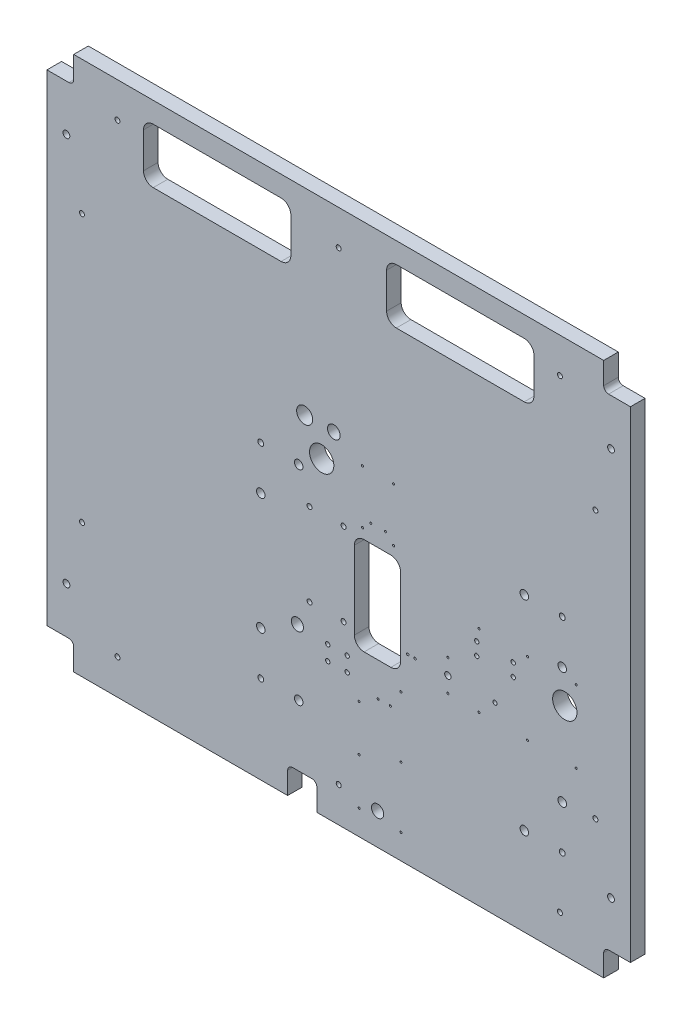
ISO-10303-21;
HEADER;
FILE_DESCRIPTION(('STEP AP214'),'2;1');
FILE_NAME('part.step','',(''),(''),'','','');
FILE_SCHEMA(('AUTOMOTIVE_DESIGN { 1 0 10303 214 1 1 1 1 }'));
ENDSEC;
DATA;
#1=APPLICATION_CONTEXT('core data for automotive mechanical design processes');
#2=APPLICATION_PROTOCOL_DEFINITION('international standard','automotive_design',2000,#1);
#3=PRODUCT_CONTEXT('',#1,'mechanical');
#4=PRODUCT('Part','Part','',(#3));
#5=PRODUCT_RELATED_PRODUCT_CATEGORY('part','',(#4));
#6=PRODUCT_DEFINITION_FORMATION('','',#4);
#7=PRODUCT_DEFINITION_CONTEXT('part definition',#1,'design');
#8=PRODUCT_DEFINITION('design','',#6,#7);
#9=PRODUCT_DEFINITION_SHAPE('','',#8);
#10=(LENGTH_UNIT() NAMED_UNIT(*) SI_UNIT(.MILLI.,.METRE.));
#11=(NAMED_UNIT(*) PLANE_ANGLE_UNIT() SI_UNIT($,.RADIAN.));
#12=(NAMED_UNIT(*) SI_UNIT($,.STERADIAN.) SOLID_ANGLE_UNIT());
#13=UNCERTAINTY_MEASURE_WITH_UNIT(LENGTH_MEASURE(1.E-05),#10,'distance_accuracy_value','');
#14=(GEOMETRIC_REPRESENTATION_CONTEXT(3) GLOBAL_UNCERTAINTY_ASSIGNED_CONTEXT((#13)) GLOBAL_UNIT_ASSIGNED_CONTEXT((#10,
#11,#12)) REPRESENTATION_CONTEXT('',''));
#15=CARTESIAN_POINT('',(0.,0.,0.));
#16=DIRECTION('',(0.,0.,1.));
#17=DIRECTION('',(1.,0.,0.));
#18=AXIS2_PLACEMENT_3D('',#15,#16,#17);
#19=CARTESIAN_POINT('',(-600.,-550.,30.));
#20=DIRECTION('',(0.,1.,0.));
#21=DIRECTION('',(0.,0.,1.));
#22=AXIS2_PLACEMENT_3D('',#19,#20,#21);
#23=PLANE('',#22);
#24=DIRECTION('',(1.,0.,0.));
#25=VECTOR('',#24,1.);
#26=CARTESIAN_POINT('',(-600.,-550.,30.));
#27=LINE('',#26,#25);
#28=CARTESIAN_POINT('',(-45.0000000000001,-550.,30.));
#29=VERTEX_POINT('',#28);
#30=CARTESIAN_POINT('',(545.,-550.,30.));
#31=VERTEX_POINT('',#30);
#32=EDGE_CURVE('E340',#29,#31,#27,.T.);
#33=ORIENTED_EDGE('',*,*,#32,.F.);
#34=DIRECTION('',(0.,0.,-1.));
#35=VECTOR('',#34,1.);
#36=CARTESIAN_POINT('',(-45.0000000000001,-550.,30.));
#37=LINE('',#36,#35);
#38=CARTESIAN_POINT('',(-45.0000000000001,-550.,0.));
#39=VERTEX_POINT('',#38);
#40=EDGE_CURVE('E351',#29,#39,#37,.T.);
#41=ORIENTED_EDGE('',*,*,#40,.T.);
#42=DIRECTION('',(1.,0.,0.));
#43=VECTOR('',#42,1.);
#44=CARTESIAN_POINT('',(-600.,-550.,0.));
#45=LINE('',#44,#43);
#46=CARTESIAN_POINT('',(545.,-550.,0.));
#47=VERTEX_POINT('',#46);
#48=EDGE_CURVE('E382',#39,#47,#45,.T.);
#49=ORIENTED_EDGE('',*,*,#48,.T.);
#50=DIRECTION('',(0.,0.,-1.));
#51=VECTOR('',#50,1.);
#52=CARTESIAN_POINT('',(545.,-550.,30.));
#53=LINE('',#52,#51);
#54=EDGE_CURVE('E362',#31,#47,#53,.T.);
#55=ORIENTED_EDGE('',*,*,#54,.F.);
#56=EDGE_LOOP('',(#33,#41,#49,#55));
#57=FACE_BOUND('',#56,.T.);
#58=ADVANCED_FACE('F41',(#57),#23,.F.);
#59=CARTESIAN_POINT('',(600.,-550.,30.));
#60=DIRECTION('',(-1.,0.,0.));
#61=DIRECTION('',(0.,0.,1.));
#62=AXIS2_PLACEMENT_3D('',#59,#60,#61);
#63=PLANE('',#62);
#64=DIRECTION('',(0.,1.,0.));
#65=VECTOR('',#64,1.);
#66=CARTESIAN_POINT('',(600.,-550.,30.));
#67=LINE('',#66,#65);
#68=CARTESIAN_POINT('',(600.,-495.,30.));
#69=VERTEX_POINT('',#68);
#70=CARTESIAN_POINT('',(600.,495.,30.));
#71=VERTEX_POINT('',#70);
#72=EDGE_CURVE('E386',#69,#71,#67,.T.);
#73=ORIENTED_EDGE('',*,*,#72,.F.);
#74=DIRECTION('',(0.,0.,-1.));
#75=VECTOR('',#74,1.);
#76=CARTESIAN_POINT('',(600.,-495.,30.));
#77=LINE('',#76,#75);
#78=CARTESIAN_POINT('',(600.,-495.,0.));
#79=VERTEX_POINT('',#78);
#80=EDGE_CURVE('E589',#69,#79,#77,.T.);
#81=ORIENTED_EDGE('',*,*,#80,.T.);
#82=DIRECTION('',(0.,1.,0.));
#83=VECTOR('',#82,1.);
#84=CARTESIAN_POINT('',(600.,-550.,0.));
#85=LINE('',#84,#83);
#86=CARTESIAN_POINT('',(600.,495.,0.));
#87=VERTEX_POINT('',#86);
#88=EDGE_CURVE('E373',#79,#87,#85,.T.);
#89=ORIENTED_EDGE('',*,*,#88,.T.);
#90=DIRECTION('',(0.,0.,-1.));
#91=VECTOR('',#90,1.);
#92=CARTESIAN_POINT('',(600.,495.,30.));
#93=LINE('',#92,#91);
#94=EDGE_CURVE('E630',#71,#87,#93,.T.);
#95=ORIENTED_EDGE('',*,*,#94,.F.);
#96=EDGE_LOOP('',(#73,#81,#89,#95));
#97=FACE_BOUND('',#96,.T.);
#98=ADVANCED_FACE('F778',(#97),#63,.F.);
#99=CARTESIAN_POINT('',(-600.,550.,30.));
#100=DIRECTION('',(0.,-1.,0.));
#101=DIRECTION('',(0.,0.,-1.));
#102=AXIS2_PLACEMENT_3D('',#99,#100,#101);
#103=PLANE('',#102);
#104=DIRECTION('',(-1.,0.,0.));
#105=VECTOR('',#104,1.);
#106=CARTESIAN_POINT('',(-600.,550.,0.));
#107=LINE('',#106,#105);
#108=CARTESIAN_POINT('',(545.,550.,0.));
#109=VERTEX_POINT('',#108);
#110=CARTESIAN_POINT('',(-545.,550.,0.));
#111=VERTEX_POINT('',#110);
#112=EDGE_CURVE('E375',#109,#111,#107,.T.);
#113=ORIENTED_EDGE('',*,*,#112,.T.);
#114=DIRECTION('',(0.,0.,-1.));
#115=VECTOR('',#114,1.);
#116=CARTESIAN_POINT('',(-545.,550.,30.));
#117=LINE('',#116,#115);
#118=CARTESIAN_POINT('',(-545.,550.,30.));
#119=VERTEX_POINT('',#118);
#120=EDGE_CURVE('E615',#119,#111,#117,.T.);
#121=ORIENTED_EDGE('',*,*,#120,.F.);
#122=DIRECTION('',(-1.,0.,0.));
#123=VECTOR('',#122,1.);
#124=CARTESIAN_POINT('',(-600.,550.,30.));
#125=LINE('',#124,#123);
#126=CARTESIAN_POINT('',(545.,550.,30.));
#127=VERTEX_POINT('',#126);
#128=EDGE_CURVE('E369',#127,#119,#125,.T.);
#129=ORIENTED_EDGE('',*,*,#128,.F.);
#130=DIRECTION('',(0.,0.,-1.));
#131=VECTOR('',#130,1.);
#132=CARTESIAN_POINT('',(545.,550.,30.));
#133=LINE('',#132,#131);
#134=EDGE_CURVE('E634',#127,#109,#133,.T.);
#135=ORIENTED_EDGE('',*,*,#134,.T.);
#136=EDGE_LOOP('',(#113,#121,#129,#135));
#137=FACE_BOUND('',#136,.T.);
#138=ADVANCED_FACE('F731',(#137),#103,.F.);
#139=CARTESIAN_POINT('',(-600.,-550.,30.));
#140=DIRECTION('',(1.,0.,0.));
#141=DIRECTION('',(0.,0.,-1.));
#142=AXIS2_PLACEMENT_3D('',#139,#140,#141);
#143=PLANE('',#142);
#144=DIRECTION('',(0.,-1.,0.));
#145=VECTOR('',#144,1.);
#146=CARTESIAN_POINT('',(-600.,-550.,0.));
#147=LINE('',#146,#145);
#148=CARTESIAN_POINT('',(-600.,495.,0.));
#149=VERTEX_POINT('',#148);
#150=CARTESIAN_POINT('',(-600.,-495.,0.));
#151=VERTEX_POINT('',#150);
#152=EDGE_CURVE('E379',#149,#151,#147,.T.);
#153=ORIENTED_EDGE('',*,*,#152,.T.);
#154=DIRECTION('',(0.,0.,-1.));
#155=VECTOR('',#154,1.);
#156=CARTESIAN_POINT('',(-600.,-495.,30.));
#157=LINE('',#156,#155);
#158=CARTESIAN_POINT('',(-600.,-495.,30.));
#159=VERTEX_POINT('',#158);
#160=EDGE_CURVE('E600',#159,#151,#157,.T.);
#161=ORIENTED_EDGE('',*,*,#160,.F.);
#162=DIRECTION('',(0.,-1.,0.));
#163=VECTOR('',#162,1.);
#164=CARTESIAN_POINT('',(-600.,-550.,30.));
#165=LINE('',#164,#163);
#166=CARTESIAN_POINT('',(-600.,495.,30.));
#167=VERTEX_POINT('',#166);
#168=EDGE_CURVE('E364',#167,#159,#165,.T.);
#169=ORIENTED_EDGE('',*,*,#168,.F.);
#170=DIRECTION('',(0.,0.,-1.));
#171=VECTOR('',#170,1.);
#172=CARTESIAN_POINT('',(-600.,495.,30.));
#173=LINE('',#172,#171);
#174=EDGE_CURVE('E619',#167,#149,#173,.T.);
#175=ORIENTED_EDGE('',*,*,#174,.T.);
#176=EDGE_LOOP('',(#153,#161,#169,#175));
#177=FACE_BOUND('',#176,.T.);
#178=ADVANCED_FACE('F751',(#177),#143,.F.);
#179=CARTESIAN_POINT('',(-545.,-550.,0.));
#180=VERTEX_POINT('',#179);
#181=CARTESIAN_POINT('',(-105.,-550.,0.));
#182=VERTEX_POINT('',#181);
#183=EDGE_CURVE('E383',#180,#182,#45,.T.);
#184=ORIENTED_EDGE('',*,*,#183,.T.);
#185=DIRECTION('',(0.,0.,-1.));
#186=VECTOR('',#185,1.);
#187=CARTESIAN_POINT('',(-105.,-550.,30.));
#188=LINE('',#187,#186);
#189=CARTESIAN_POINT('',(-105.,-550.,30.));
#190=VERTEX_POINT('',#189);
#191=EDGE_CURVE('E357',#190,#182,#188,.T.);
#192=ORIENTED_EDGE('',*,*,#191,.F.);
#193=CARTESIAN_POINT('',(-545.,-550.,30.));
#194=VERTEX_POINT('',#193);
#195=EDGE_CURVE('E363',#194,#190,#27,.T.);
#196=ORIENTED_EDGE('',*,*,#195,.F.);
#197=DIRECTION('',(0.,0.,-1.));
#198=VECTOR('',#197,1.);
#199=CARTESIAN_POINT('',(-545.,-550.,30.));
#200=LINE('',#199,#198);
#201=EDGE_CURVE('E604',#194,#180,#200,.T.);
#202=ORIENTED_EDGE('',*,*,#201,.T.);
#203=EDGE_LOOP('',(#184,#192,#196,#202));
#204=FACE_BOUND('',#203,.T.);
#205=ADVANCED_FACE('F766',(#204),#23,.F.);
#206=CARTESIAN_POINT('',(600.,550.,30.));
#207=DIRECTION('',(0.,0.,-1.));
#208=DIRECTION('',(-1.,0.,0.));
#209=AXIS2_PLACEMENT_3D('',#206,#207,#208);
#210=PLANE('',#209);
#211=CARTESIAN_POINT('',(454.999999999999,478.,30.));
#212=DIRECTION('',(0.,0.,-1.));
#213=DIRECTION('',(-1.,0.,0.));
#214=AXIS2_PLACEMENT_3D('',#211,#212,#213);
#215=CIRCLE('',#214,5.09999999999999);
#216=CARTESIAN_POINT('',(449.9,478.,30.));
#217=VERTEX_POINT('',#216);
#218=EDGE_CURVE('E1471',#217,#217,#215,.T.);
#219=ORIENTED_EDGE('',*,*,#218,.T.);
#220=EDGE_LOOP('',(#219));
#221=FACE_BOUND('',#220,.T.);
#222=CARTESIAN_POINT('',(-5.55111512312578E-13,478.,30.));
#223=DIRECTION('',(0.,0.,-1.));
#224=DIRECTION('',(-1.,0.,0.));
#225=AXIS2_PLACEMENT_3D('',#222,#223,#224);
#226=CIRCLE('',#225,5.09999999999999);
#227=CARTESIAN_POINT('',(-5.10000000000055,478.,30.));
#228=VERTEX_POINT('',#227);
#229=EDGE_CURVE('E1467',#228,#228,#226,.T.);
#230=ORIENTED_EDGE('',*,*,#229,.T.);
#231=EDGE_LOOP('',(#230));
#232=FACE_BOUND('',#231,.T.);
#233=CARTESIAN_POINT('',(-455.,478.,30.));
#234=DIRECTION('',(0.,0.,-1.));
#235=DIRECTION('',(-1.,0.,0.));
#236=AXIS2_PLACEMENT_3D('',#233,#234,#235);
#237=CIRCLE('',#236,5.09999999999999);
#238=CARTESIAN_POINT('',(-460.1,478.,30.));
#239=VERTEX_POINT('',#238);
#240=EDGE_CURVE('E1463',#239,#239,#237,.T.);
#241=ORIENTED_EDGE('',*,*,#240,.T.);
#242=EDGE_LOOP('',(#241));
#243=FACE_BOUND('',#242,.T.);
#244=CARTESIAN_POINT('',(-528.,274.999999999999,30.));
#245=DIRECTION('',(0.,0.,-1.));
#246=DIRECTION('',(-1.,0.,0.));
#247=AXIS2_PLACEMENT_3D('',#244,#245,#246);
#248=CIRCLE('',#247,5.09999999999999);
#249=CARTESIAN_POINT('',(-533.1,274.999999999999,30.));
#250=VERTEX_POINT('',#249);
#251=EDGE_CURVE('E1459',#250,#250,#248,.T.);
#252=ORIENTED_EDGE('',*,*,#251,.T.);
#253=EDGE_LOOP('',(#252));
#254=FACE_BOUND('',#253,.T.);
#255=CARTESIAN_POINT('',(-527.999999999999,-275.000000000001,30.));
#256=DIRECTION('',(0.,0.,-1.));
#257=DIRECTION('',(-1.,0.,0.));
#258=AXIS2_PLACEMENT_3D('',#255,#256,#257);
#259=CIRCLE('',#258,5.09999999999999);
#260=CARTESIAN_POINT('',(-533.099999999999,-275.000000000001,30.));
#261=VERTEX_POINT('',#260);
#262=EDGE_CURVE('E1455',#261,#261,#259,.T.);
#263=ORIENTED_EDGE('',*,*,#262,.T.);
#264=EDGE_LOOP('',(#263));
#265=FACE_BOUND('',#264,.T.);
#266=CARTESIAN_POINT('',(-455.,-478.000000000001,30.));
#267=DIRECTION('',(0.,0.,-1.));
#268=DIRECTION('',(-1.,0.,0.));
#269=AXIS2_PLACEMENT_3D('',#266,#267,#268);
#270=CIRCLE('',#269,5.09999999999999);
#271=CARTESIAN_POINT('',(-460.1,-478.000000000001,30.));
#272=VERTEX_POINT('',#271);
#273=EDGE_CURVE('E1451',#272,#272,#270,.T.);
#274=ORIENTED_EDGE('',*,*,#273,.T.);
#275=EDGE_LOOP('',(#274));
#276=FACE_BOUND('',#275,.T.);
#277=CARTESIAN_POINT('',(455.,-478.000000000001,30.));
#278=DIRECTION('',(0.,0.,-1.));
#279=DIRECTION('',(-1.,0.,0.));
#280=AXIS2_PLACEMENT_3D('',#277,#278,#279);
#281=CIRCLE('',#280,5.09999999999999);
#282=CARTESIAN_POINT('',(449.9,-478.000000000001,30.));
#283=VERTEX_POINT('',#282);
#284=EDGE_CURVE('E1447',#283,#283,#281,.T.);
#285=ORIENTED_EDGE('',*,*,#284,.T.);
#286=EDGE_LOOP('',(#285));
#287=FACE_BOUND('',#286,.T.);
#288=CARTESIAN_POINT('',(-3.88578058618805E-13,-478.000000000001,30.));
#289=DIRECTION('',(0.,0.,-1.));
#290=DIRECTION('',(-1.,0.,0.));
#291=AXIS2_PLACEMENT_3D('',#288,#289,#290);
#292=CIRCLE('',#291,5.09999999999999);
#293=CARTESIAN_POINT('',(-5.10000000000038,-478.000000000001,30.));
#294=VERTEX_POINT('',#293);
#295=EDGE_CURVE('E1443',#294,#294,#292,.T.);
#296=ORIENTED_EDGE('',*,*,#295,.T.);
#297=EDGE_LOOP('',(#296));
#298=FACE_BOUND('',#297,.T.);
#299=CARTESIAN_POINT('',(527.999999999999,275.,30.));
#300=DIRECTION('',(0.,0.,-1.));
#301=DIRECTION('',(-1.,0.,0.));
#302=AXIS2_PLACEMENT_3D('',#299,#300,#301);
#303=CIRCLE('',#302,5.09999999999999);
#304=CARTESIAN_POINT('',(522.899999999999,275.,30.));
#305=VERTEX_POINT('',#304);
#306=EDGE_CURVE('E1439',#305,#305,#303,.T.);
#307=ORIENTED_EDGE('',*,*,#306,.T.);
#308=EDGE_LOOP('',(#307));
#309=FACE_BOUND('',#308,.T.);
#310=CARTESIAN_POINT('',(527.999999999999,-275.,30.));
#311=DIRECTION('',(0.,0.,-1.));
#312=DIRECTION('',(-1.,0.,0.));
#313=AXIS2_PLACEMENT_3D('',#310,#311,#312);
#314=CIRCLE('',#313,5.09999999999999);
#315=CARTESIAN_POINT('',(522.899999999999,-275.,30.));
#316=VERTEX_POINT('',#315);
#317=EDGE_CURVE('E1435',#316,#316,#314,.T.);
#318=ORIENTED_EDGE('',*,*,#317,.T.);
#319=EDGE_LOOP('',(#318));
#320=FACE_BOUND('',#319,.T.);
#321=CARTESIAN_POINT('',(9.9999999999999,-182.7212356,30.));
#322=DIRECTION('',(0.,0.,-1.));
#323=DIRECTION('',(-1.,0.,0.));
#324=AXIS2_PLACEMENT_3D('',#321,#322,#323);
#325=CIRCLE('',#324,5.09999999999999);
#326=CARTESIAN_POINT('',(4.8999999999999,-182.7212356,30.));
#327=VERTEX_POINT('',#326);
#328=EDGE_CURVE('E1431',#327,#327,#325,.T.);
#329=ORIENTED_EDGE('',*,*,#328,.T.);
#330=EDGE_LOOP('',(#329));
#331=FACE_BOUND('',#330,.T.);
#332=CARTESIAN_POINT('',(-60.0000000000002,-182.7212356,30.));
#333=DIRECTION('',(0.,0.,-1.));
#334=DIRECTION('',(-1.,0.,0.));
#335=AXIS2_PLACEMENT_3D('',#332,#333,#334);
#336=CIRCLE('',#335,5.09999999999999);
#337=CARTESIAN_POINT('',(-65.1000000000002,-182.7212356,30.));
#338=VERTEX_POINT('',#337);
#339=EDGE_CURVE('E1427',#338,#338,#336,.T.);
#340=ORIENTED_EDGE('',*,*,#339,.T.);
#341=EDGE_LOOP('',(#340));
#342=FACE_BOUND('',#341,.T.);
#343=CARTESIAN_POINT('',(9.99999999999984,-12.7212356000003,30.));
#344=DIRECTION('',(0.,0.,-1.));
#345=DIRECTION('',(-1.,0.,0.));
#346=AXIS2_PLACEMENT_3D('',#343,#344,#345);
#347=CIRCLE('',#346,5.09999999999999);
#348=CARTESIAN_POINT('',(4.89999999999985,-12.7212356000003,30.));
#349=VERTEX_POINT('',#348);
#350=EDGE_CURVE('E1423',#349,#349,#347,.T.);
#351=ORIENTED_EDGE('',*,*,#350,.T.);
#352=EDGE_LOOP('',(#351));
#353=FACE_BOUND('',#352,.T.);
#354=CARTESIAN_POINT('',(-60.0000000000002,-12.7212356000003,30.));
#355=DIRECTION('',(0.,0.,-1.));
#356=DIRECTION('',(-1.,0.,0.));
#357=AXIS2_PLACEMENT_3D('',#354,#355,#356);
#358=CIRCLE('',#357,5.09999999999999);
#359=CARTESIAN_POINT('',(-65.1000000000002,-12.7212356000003,30.));
#360=VERTEX_POINT('',#359);
#361=EDGE_CURVE('E1419',#360,#360,#358,.T.);
#362=ORIENTED_EDGE('',*,*,#361,.T.);
#363=EDGE_LOOP('',(#362));
#364=FACE_BOUND('',#363,.T.);
#365=CARTESIAN_POINT('',(-22.54468826,-269.447024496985,30.));
#366=DIRECTION('',(0.,0.,1.));
#367=DIRECTION('',(1.,0.,0.));
#368=AXIS2_PLACEMENT_3D('',#365,#366,#367);
#369=CIRCLE('',#368,4.5);
#370=CARTESIAN_POINT('',(-18.04468826,-269.447024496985,30.));
#371=VERTEX_POINT('',#370);
#372=EDGE_CURVE('E1416',#371,#371,#369,.T.);
#373=ORIENTED_EDGE('',*,*,#372,.F.);
#374=EDGE_LOOP('',(#373));
#375=FACE_BOUND('',#374,.T.);
#376=CARTESIAN_POINT('',(17.45531174,-269.447024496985,30.));
#377=DIRECTION('',(0.,0.,1.));
#378=DIRECTION('',(1.,0.,0.));
#379=AXIS2_PLACEMENT_3D('',#376,#377,#378);
#380=CIRCLE('',#379,4.5);
#381=CARTESIAN_POINT('',(21.95531174,-269.447024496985,30.));
#382=VERTEX_POINT('',#381);
#383=EDGE_CURVE('E1412',#382,#382,#380,.T.);
#384=ORIENTED_EDGE('',*,*,#383,.F.);
#385=EDGE_LOOP('',(#384));
#386=FACE_BOUND('',#385,.T.);
#387=CARTESIAN_POINT('',(17.45531174,-239.447024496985,30.));
#388=DIRECTION('',(0.,0.,1.));
#389=DIRECTION('',(1.,0.,0.));
#390=AXIS2_PLACEMENT_3D('',#387,#388,#389);
#391=CIRCLE('',#390,4.5);
#392=CARTESIAN_POINT('',(21.95531174,-239.447024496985,30.));
#393=VERTEX_POINT('',#392);
#394=EDGE_CURVE('E1408',#393,#393,#391,.T.);
#395=ORIENTED_EDGE('',*,*,#394,.F.);
#396=EDGE_LOOP('',(#395));
#397=FACE_BOUND('',#396,.T.);
#398=CARTESIAN_POINT('',(-22.54468826,-239.447024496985,30.));
#399=DIRECTION('',(0.,0.,1.));
#400=DIRECTION('',(1.,0.,0.));
#401=AXIS2_PLACEMENT_3D('',#398,#399,#400);
#402=CIRCLE('',#401,4.5);
#403=CARTESIAN_POINT('',(-18.04468826,-239.447024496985,30.));
#404=VERTEX_POINT('',#403);
#405=EDGE_CURVE('E1404',#404,#404,#402,.T.);
#406=ORIENTED_EDGE('',*,*,#405,.F.);
#407=EDGE_LOOP('',(#406));
#408=FACE_BOUND('',#407,.T.);
#409=CARTESIAN_POINT('',(459.729311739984,50.8999999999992,30.));
#410=DIRECTION('',(0.,0.,-1.));
#411=DIRECTION('',(-1.,0.,0.));
#412=AXIS2_PLACEMENT_3D('',#409,#410,#411);
#413=CIRCLE('',#412,6.00000000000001);
#414=CARTESIAN_POINT('',(453.729311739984,50.8999999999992,30.));
#415=VERTEX_POINT('',#414);
#416=EDGE_CURVE('E1399',#415,#415,#413,.T.);
#417=ORIENTED_EDGE('',*,*,#416,.T.);
#418=EDGE_LOOP('',(#417));
#419=FACE_BOUND('',#418,.T.);
#420=CARTESIAN_POINT('',(459.729311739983,-369.100000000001,30.));
#421=DIRECTION('',(0.,0.,-1.));
#422=DIRECTION('',(-1.,0.,0.));
#423=AXIS2_PLACEMENT_3D('',#420,#421,#422);
#424=CIRCLE('',#423,6.00000000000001);
#425=CARTESIAN_POINT('',(453.729311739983,-369.100000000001,30.));
#426=VERTEX_POINT('',#425);
#427=EDGE_CURVE('E1395',#426,#426,#424,.T.);
#428=ORIENTED_EDGE('',*,*,#427,.T.);
#429=EDGE_LOOP('',(#428));
#430=FACE_BOUND('',#429,.T.);
#431=CARTESIAN_POINT('',(-160.270688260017,-369.1,30.));
#432=DIRECTION('',(0.,0.,-1.));
#433=DIRECTION('',(-1.,0.,0.));
#434=AXIS2_PLACEMENT_3D('',#431,#432,#433);
#435=CIRCLE('',#434,6.00000000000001);
#436=CARTESIAN_POINT('',(-166.270688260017,-369.1,30.));
#437=VERTEX_POINT('',#436);
#438=EDGE_CURVE('E1391',#437,#437,#435,.T.);
#439=ORIENTED_EDGE('',*,*,#438,.T.);
#440=EDGE_LOOP('',(#439));
#441=FACE_BOUND('',#440,.T.);
#442=CARTESIAN_POINT('',(-160.270688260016,50.9000000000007,30.));
#443=DIRECTION('',(0.,0.,-1.));
#444=DIRECTION('',(-1.,0.,0.));
#445=AXIS2_PLACEMENT_3D('',#442,#443,#444);
#446=CIRCLE('',#445,6.00000000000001);
#447=CARTESIAN_POINT('',(-166.270688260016,50.9000000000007,30.));
#448=VERTEX_POINT('',#447);
#449=EDGE_CURVE('E1387',#448,#448,#446,.T.);
#450=ORIENTED_EDGE('',*,*,#449,.T.);
#451=EDGE_LOOP('',(#450));
#452=FACE_BOUND('',#451,.T.);
#453=CARTESIAN_POINT('',(381.729311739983,-369.100000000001,30.));
#454=DIRECTION('',(0.,0.,-1.));
#455=DIRECTION('',(-1.,0.,0.));
#456=AXIS2_PLACEMENT_3D('',#453,#454,#455);
#457=CIRCLE('',#456,8.74999999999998);
#458=CARTESIAN_POINT('',(372.979311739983,-369.100000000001,30.));
#459=VERTEX_POINT('',#458);
#460=EDGE_CURVE('E1383',#459,#459,#457,.T.);
#461=ORIENTED_EDGE('',*,*,#460,.T.);
#462=EDGE_LOOP('',(#461));
#463=FACE_BOUND('',#462,.T.);
#464=CARTESIAN_POINT('',(459.729311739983,-39.1000000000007,30.));
#465=DIRECTION('',(0.,0.,-1.));
#466=DIRECTION('',(-1.,0.,0.));
#467=AXIS2_PLACEMENT_3D('',#464,#465,#466);
#468=CIRCLE('',#467,8.74999999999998);
#469=CARTESIAN_POINT('',(450.979311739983,-39.1000000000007,30.));
#470=VERTEX_POINT('',#469);
#471=EDGE_CURVE('E1379',#470,#470,#468,.T.);
#472=ORIENTED_EDGE('',*,*,#471,.T.);
#473=EDGE_LOOP('',(#472));
#474=FACE_BOUND('',#473,.T.);
#475=CARTESIAN_POINT('',(381.729311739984,50.8999999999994,30.));
#476=DIRECTION('',(0.,0.,-1.));
#477=DIRECTION('',(-1.,0.,0.));
#478=AXIS2_PLACEMENT_3D('',#475,#476,#477);
#479=CIRCLE('',#478,8.74999999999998);
#480=CARTESIAN_POINT('',(372.979311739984,50.8999999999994,30.));
#481=VERTEX_POINT('',#480);
#482=EDGE_CURVE('E1375',#481,#481,#479,.T.);
#483=ORIENTED_EDGE('',*,*,#482,.T.);
#484=EDGE_LOOP('',(#483));
#485=FACE_BOUND('',#484,.T.);
#486=CARTESIAN_POINT('',(459.729311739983,-279.100000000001,30.));
#487=DIRECTION('',(0.,0.,-1.));
#488=DIRECTION('',(-1.,0.,0.));
#489=AXIS2_PLACEMENT_3D('',#486,#487,#488);
#490=CIRCLE('',#489,8.74999999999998);
#491=CARTESIAN_POINT('',(450.979311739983,-279.100000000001,30.));
#492=VERTEX_POINT('',#491);
#493=EDGE_CURVE('E1371',#492,#492,#490,.T.);
#494=ORIENTED_EDGE('',*,*,#493,.T.);
#495=EDGE_LOOP('',(#494));
#496=FACE_BOUND('',#495,.T.);
#497=CARTESIAN_POINT('',(-82.2706882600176,50.9000000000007,30.));
#498=DIRECTION('',(0.,0.,-1.));
#499=DIRECTION('',(-1.,0.,0.));
#500=AXIS2_PLACEMENT_3D('',#497,#498,#499);
#501=CIRCLE('',#500,8.74999999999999);
#502=CARTESIAN_POINT('',(-91.0206882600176,50.9000000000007,30.));
#503=VERTEX_POINT('',#502);
#504=EDGE_CURVE('E1367',#503,#503,#501,.T.);
#505=ORIENTED_EDGE('',*,*,#504,.T.);
#506=EDGE_LOOP('',(#505));
#507=FACE_BOUND('',#506,.T.);
#508=CARTESIAN_POINT('',(-160.270688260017,-39.0999999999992,30.));
#509=DIRECTION('',(0.,0.,-1.));
#510=DIRECTION('',(-1.,0.,0.));
#511=AXIS2_PLACEMENT_3D('',#508,#509,#510);
#512=CIRCLE('',#511,8.75000000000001);
#513=CARTESIAN_POINT('',(-169.020688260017,-39.0999999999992,30.));
#514=VERTEX_POINT('',#513);
#515=EDGE_CURVE('E1363',#514,#514,#512,.T.);
#516=ORIENTED_EDGE('',*,*,#515,.T.);
#517=EDGE_LOOP('',(#516));
#518=FACE_BOUND('',#517,.T.);
#519=CARTESIAN_POINT('',(-160.270688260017,-279.099999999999,30.));
#520=DIRECTION('',(0.,0.,-1.));
#521=DIRECTION('',(-1.,0.,0.));
#522=AXIS2_PLACEMENT_3D('',#519,#520,#521);
#523=CIRCLE('',#522,8.74999999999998);
#524=CARTESIAN_POINT('',(-169.020688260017,-279.099999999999,30.));
#525=VERTEX_POINT('',#524);
#526=EDGE_CURVE('E1359',#525,#525,#523,.T.);
#527=ORIENTED_EDGE('',*,*,#526,.T.);
#528=EDGE_LOOP('',(#527));
#529=FACE_BOUND('',#528,.T.);
#530=CARTESIAN_POINT('',(-82.2706882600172,-369.1,30.));
#531=DIRECTION('',(0.,0.,-1.));
#532=DIRECTION('',(-1.,0.,0.));
#533=AXIS2_PLACEMENT_3D('',#530,#531,#532);
#534=CIRCLE('',#533,8.74999999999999);
#535=CARTESIAN_POINT('',(-91.0206882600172,-369.1,30.));
#536=VERTEX_POINT('',#535);
#537=EDGE_CURVE('E1355',#536,#536,#534,.T.);
#538=ORIENTED_EDGE('',*,*,#537,.T.);
#539=EDGE_LOOP('',(#538));
#540=FACE_BOUND('',#539,.T.);
#541=CARTESIAN_POINT('',(288.455311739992,-204.947024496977,30.));
#542=DIRECTION('',(0.,0.,1.));
#543=DIRECTION('',(1.,0.,0.));
#544=AXIS2_PLACEMENT_3D('',#541,#542,#543);
#545=CIRCLE('',#544,2.09999999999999);
#546=CARTESIAN_POINT('',(290.555311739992,-204.947024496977,30.));
#547=VERTEX_POINT('',#546);
#548=EDGE_CURVE('E1352',#547,#547,#545,.T.);
#549=ORIENTED_EDGE('',*,*,#548,.F.);
#550=EDGE_LOOP('',(#549));
#551=FACE_BOUND('',#550,.T.);
#552=CARTESIAN_POINT('',(42.0293117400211,-498.851484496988,30.));
#553=DIRECTION('',(0.,0.,1.));
#554=DIRECTION('',(1.,0.,0.));
#555=AXIS2_PLACEMENT_3D('',#552,#553,#554);
#556=CIRCLE('',#555,2.09999999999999);
#557=CARTESIAN_POINT('',(44.1293117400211,-498.851484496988,30.));
#558=VERTEX_POINT('',#557);
#559=EDGE_CURVE('E1348',#558,#558,#556,.T.);
#560=ORIENTED_EDGE('',*,*,#559,.F.);
#561=EDGE_LOOP('',(#560));
#562=FACE_BOUND('',#561,.T.);
#563=CARTESIAN_POINT('',(42.0293117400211,-403.851484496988,30.));
#564=DIRECTION('',(0.,0.,1.));
#565=DIRECTION('',(1.,0.,0.));
#566=AXIS2_PLACEMENT_3D('',#563,#564,#565);
#567=CIRCLE('',#566,2.09999999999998);
#568=CARTESIAN_POINT('',(44.129311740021,-403.851484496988,30.));
#569=VERTEX_POINT('',#568);
#570=EDGE_CURVE('E1344',#569,#569,#567,.T.);
#571=ORIENTED_EDGE('',*,*,#570,.F.);
#572=EDGE_LOOP('',(#571));
#573=FACE_BOUND('',#572,.T.);
#574=CARTESIAN_POINT('',(128.029311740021,-498.851484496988,30.));
#575=DIRECTION('',(0.,0.,1.));
#576=DIRECTION('',(1.,0.,0.));
#577=AXIS2_PLACEMENT_3D('',#574,#575,#576);
#578=CIRCLE('',#577,2.09999999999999);
#579=CARTESIAN_POINT('',(130.129311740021,-498.851484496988,30.));
#580=VERTEX_POINT('',#579);
#581=EDGE_CURVE('E1340',#580,#580,#578,.T.);
#582=ORIENTED_EDGE('',*,*,#581,.F.);
#583=EDGE_LOOP('',(#582));
#584=FACE_BOUND('',#583,.T.);
#585=CARTESIAN_POINT('',(128.029311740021,-373.851484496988,30.));
#586=DIRECTION('',(0.,0.,1.));
#587=DIRECTION('',(1.,0.,0.));
#588=AXIS2_PLACEMENT_3D('',#585,#586,#587);
#589=CIRCLE('',#588,2.09999999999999);
#590=CARTESIAN_POINT('',(130.129311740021,-373.851484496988,30.));
#591=VERTEX_POINT('',#590);
#592=EDGE_CURVE('E1336',#591,#591,#589,.T.);
#593=ORIENTED_EDGE('',*,*,#592,.F.);
#594=EDGE_LOOP('',(#593));
#595=FACE_BOUND('',#594,.T.);
#596=CARTESIAN_POINT('',(128.029311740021,-248.851484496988,30.));
#597=DIRECTION('',(0.,0.,1.));
#598=DIRECTION('',(1.,0.,0.));
#599=AXIS2_PLACEMENT_3D('',#596,#597,#598);
#600=CIRCLE('',#599,2.09999999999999);
#601=CARTESIAN_POINT('',(130.129311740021,-248.851484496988,30.));
#602=VERTEX_POINT('',#601);
#603=EDGE_CURVE('E1332',#602,#602,#600,.T.);
#604=ORIENTED_EDGE('',*,*,#603,.F.);
#605=EDGE_LOOP('',(#604));
#606=FACE_BOUND('',#605,.T.);
#607=CARTESIAN_POINT('',(488.455311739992,-55.9470244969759,30.));
#608=DIRECTION('',(0.,0.,1.));
#609=DIRECTION('',(1.,0.,0.));
#610=AXIS2_PLACEMENT_3D('',#607,#608,#609);
#611=CIRCLE('',#610,2.09999999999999);
#612=CARTESIAN_POINT('',(490.555311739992,-55.9470244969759,30.));
#613=VERTEX_POINT('',#612);
#614=EDGE_CURVE('E1328',#613,#613,#611,.T.);
#615=ORIENTED_EDGE('',*,*,#614,.F.);
#616=EDGE_LOOP('',(#615));
#617=FACE_BOUND('',#616,.T.);
#618=CARTESIAN_POINT('',(388.455311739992,-55.9470244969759,30.));
#619=DIRECTION('',(0.,0.,1.));
#620=DIRECTION('',(1.,0.,0.));
#621=AXIS2_PLACEMENT_3D('',#618,#619,#620);
#622=CIRCLE('',#621,2.09999999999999);
#623=CARTESIAN_POINT('',(390.555311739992,-55.9470244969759,30.));
#624=VERTEX_POINT('',#623);
#625=EDGE_CURVE('E1324',#624,#624,#622,.T.);
#626=ORIENTED_EDGE('',*,*,#625,.F.);
#627=EDGE_LOOP('',(#626));
#628=FACE_BOUND('',#627,.T.);
#629=CARTESIAN_POINT('',(288.455311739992,-55.9470244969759,30.));
#630=DIRECTION('',(0.,0.,1.));
#631=DIRECTION('',(1.,0.,0.));
#632=AXIS2_PLACEMENT_3D('',#629,#630,#631);
#633=CIRCLE('',#632,2.09999999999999);
#634=CARTESIAN_POINT('',(290.555311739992,-55.9470244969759,30.));
#635=VERTEX_POINT('',#634);
#636=EDGE_CURVE('E1320',#635,#635,#633,.T.);
#637=ORIENTED_EDGE('',*,*,#636,.F.);
#638=EDGE_LOOP('',(#637));
#639=FACE_BOUND('',#638,.T.);
#640=CARTESIAN_POINT('',(488.455311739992,-204.947024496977,30.));
#641=DIRECTION('',(0.,0.,1.));
#642=DIRECTION('',(1.,0.,0.));
#643=AXIS2_PLACEMENT_3D('',#640,#641,#642);
#644=CIRCLE('',#643,2.09999999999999);
#645=CARTESIAN_POINT('',(490.555311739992,-204.947024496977,30.));
#646=VERTEX_POINT('',#645);
#647=EDGE_CURVE('E1316',#646,#646,#644,.T.);
#648=ORIENTED_EDGE('',*,*,#647,.F.);
#649=EDGE_LOOP('',(#648));
#650=FACE_BOUND('',#649,.T.);
#651=CARTESIAN_POINT('',(388.455311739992,-204.947024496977,30.));
#652=DIRECTION('',(0.,0.,1.));
#653=DIRECTION('',(1.,0.,0.));
#654=AXIS2_PLACEMENT_3D('',#651,#652,#653);
#655=CIRCLE('',#654,2.09999999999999);
#656=CARTESIAN_POINT('',(390.555311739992,-204.947024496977,30.));
#657=VERTEX_POINT('',#656);
#658=EDGE_CURVE('E1312',#657,#657,#655,.T.);
#659=ORIENTED_EDGE('',*,*,#658,.F.);
#660=EDGE_LOOP('',(#659));
#661=FACE_BOUND('',#660,.T.);
#662=CARTESIAN_POINT('',(48.9283467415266,114.052975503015,30.));
#663=DIRECTION('',(0.,0.,1.));
#664=DIRECTION('',(1.,0.,0.));
#665=AXIS2_PLACEMENT_3D('',#662,#663,#664);
#666=CIRCLE('',#665,2.09999999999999);
#667=CARTESIAN_POINT('',(51.0283467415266,114.052975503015,30.));
#668=VERTEX_POINT('',#667);
#669=EDGE_CURVE('E1308',#668,#668,#666,.T.);
#670=ORIENTED_EDGE('',*,*,#669,.F.);
#671=EDGE_LOOP('',(#670));
#672=FACE_BOUND('',#671,.T.);
#673=CARTESIAN_POINT('',(48.9283467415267,4.05297550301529,30.));
#674=DIRECTION('',(0.,0.,1.));
#675=DIRECTION('',(1.,0.,0.));
#676=AXIS2_PLACEMENT_3D('',#673,#674,#675);
#677=CIRCLE('',#676,2.09999999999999);
#678=CARTESIAN_POINT('',(51.0283467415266,4.05297550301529,30.));
#679=VERTEX_POINT('',#678);
#680=EDGE_CURVE('E1304',#679,#679,#677,.T.);
#681=ORIENTED_EDGE('',*,*,#680,.F.);
#682=EDGE_LOOP('',(#681));
#683=FACE_BOUND('',#682,.T.);
#684=CARTESIAN_POINT('',(112.928346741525,4.0529755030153,30.));
#685=DIRECTION('',(0.,0.,1.));
#686=DIRECTION('',(1.,0.,0.));
#687=AXIS2_PLACEMENT_3D('',#684,#685,#686);
#688=CIRCLE('',#687,2.09999999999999);
#689=CARTESIAN_POINT('',(115.028346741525,4.0529755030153,30.));
#690=VERTEX_POINT('',#689);
#691=EDGE_CURVE('E1300',#690,#690,#688,.T.);
#692=ORIENTED_EDGE('',*,*,#691,.F.);
#693=EDGE_LOOP('',(#692));
#694=FACE_BOUND('',#693,.T.);
#695=CARTESIAN_POINT('',(112.928346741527,114.052975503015,30.));
#696=DIRECTION('',(0.,0.,1.));
#697=DIRECTION('',(1.,0.,0.));
#698=AXIS2_PLACEMENT_3D('',#695,#696,#697);
#699=CIRCLE('',#698,2.09999999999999);
#700=CARTESIAN_POINT('',(115.028346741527,114.052975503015,30.));
#701=VERTEX_POINT('',#700);
#702=EDGE_CURVE('E1296',#701,#701,#699,.T.);
#703=ORIENTED_EDGE('',*,*,#702,.F.);
#704=EDGE_LOOP('',(#703));
#705=FACE_BOUND('',#704,.T.);
#706=CARTESIAN_POINT('',(42.029311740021,-308.851484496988,30.));
#707=DIRECTION('',(0.,0.,1.));
#708=DIRECTION('',(1.,0.,0.));
#709=AXIS2_PLACEMENT_3D('',#706,#707,#708);
#710=CIRCLE('',#709,2.09999999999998);
#711=CARTESIAN_POINT('',(44.129311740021,-308.851484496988,30.));
#712=VERTEX_POINT('',#711);
#713=EDGE_CURVE('E1292',#712,#712,#710,.T.);
#714=ORIENTED_EDGE('',*,*,#713,.F.);
#715=EDGE_LOOP('',(#714));
#716=FACE_BOUND('',#715,.T.);
#717=CARTESIAN_POINT('',(-70.0000000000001,145.,30.));
#718=DIRECTION('',(0.,0.,-1.));
#719=DIRECTION('',(-1.,0.,0.));
#720=AXIS2_PLACEMENT_3D('',#717,#718,#719);
#721=CIRCLE('',#720,16.5);
#722=CARTESIAN_POINT('',(-86.5000000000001,145.,30.));
#723=VERTEX_POINT('',#722);
#724=EDGE_CURVE('E1285',#723,#723,#721,.T.);
#725=ORIENTED_EDGE('',*,*,#724,.T.);
#726=EDGE_LOOP('',(#725));
#727=FACE_BOUND('',#726,.T.);
#728=CARTESIAN_POINT('',(79.9999999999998,-485.,30.));
#729=DIRECTION('',(0.,0.,-1.));
#730=DIRECTION('',(-1.,0.,0.));
#731=AXIS2_PLACEMENT_3D('',#728,#729,#730);
#732=CIRCLE('',#731,12.5);
#733=CARTESIAN_POINT('',(67.4999999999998,-485.,30.));
#734=VERTEX_POINT('',#733);
#735=EDGE_CURVE('E1281',#734,#734,#732,.T.);
#736=ORIENTED_EDGE('',*,*,#735,.T.);
#737=EDGE_LOOP('',(#736));
#738=FACE_BOUND('',#737,.T.);
#739=CARTESIAN_POINT('',(-85.0000000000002,-235.,30.));
#740=DIRECTION('',(0.,0.,-1.));
#741=DIRECTION('',(-1.,0.,0.));
#742=AXIS2_PLACEMENT_3D('',#739,#740,#741);
#743=CIRCLE('',#742,12.5);
#744=CARTESIAN_POINT('',(-97.5000000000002,-235.,30.));
#745=VERTEX_POINT('',#744);
#746=EDGE_CURVE('E1277',#745,#745,#743,.T.);
#747=ORIENTED_EDGE('',*,*,#746,.T.);
#748=EDGE_LOOP('',(#747));
#749=FACE_BOUND('',#748,.T.);
#750=CARTESIAN_POINT('',(-35.0000000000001,84.9999999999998,30.));
#751=DIRECTION('',(0.,0.,-1.));
#752=DIRECTION('',(-1.,0.,0.));
#753=AXIS2_PLACEMENT_3D('',#750,#751,#752);
#754=CIRCLE('',#753,25.);
#755=CARTESIAN_POINT('',(-60.0000000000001,84.9999999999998,30.));
#756=VERTEX_POINT('',#755);
#757=EDGE_CURVE('E1273',#756,#756,#754,.T.);
#758=ORIENTED_EDGE('',*,*,#757,.T.);
#759=EDGE_LOOP('',(#758));
#760=FACE_BOUND('',#759,.T.);
#761=CARTESIAN_POINT('',(465.,-105.,30.));
#762=DIRECTION('',(0.,0.,-1.));
#763=DIRECTION('',(-1.,0.,0.));
#764=AXIS2_PLACEMENT_3D('',#761,#762,#763);
#765=CIRCLE('',#764,25.);
#766=CARTESIAN_POINT('',(440.,-105.,30.));
#767=VERTEX_POINT('',#766);
#768=EDGE_CURVE('E1271',#767,#767,#765,.T.);
#769=ORIENTED_EDGE('',*,*,#768,.T.);
#770=EDGE_LOOP('',(#769));
#771=FACE_BOUND('',#770,.T.);
#772=CARTESIAN_POINT('',(-10.0000000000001,145.,30.));
#773=DIRECTION('',(0.,0.,-1.));
#774=DIRECTION('',(-1.,0.,0.));
#775=AXIS2_PLACEMENT_3D('',#772,#773,#774);
#776=CIRCLE('',#775,13.);
#777=CARTESIAN_POINT('',(-23.0000000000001,145.,30.));
#778=VERTEX_POINT('',#777);
#779=EDGE_CURVE('E1258',#778,#778,#776,.T.);
#780=ORIENTED_EDGE('',*,*,#779,.T.);
#781=EDGE_LOOP('',(#780));
#782=FACE_BOUND('',#781,.T.);
#783=DIRECTION('',(1.,0.,0.));
#784=VECTOR('',#783,1.);
#785=CARTESIAN_POINT('',(98.4999999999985,394.499999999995,30.));
#786=LINE('',#785,#784);
#787=CARTESIAN_POINT('',(118.499999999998,394.499999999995,30.));
#788=VERTEX_POINT('',#787);
#789=CARTESIAN_POINT('',(381.499999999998,394.499999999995,30.));
#790=VERTEX_POINT('',#789);
#791=EDGE_CURVE('E1252',#788,#790,#786,.T.);
#792=ORIENTED_EDGE('',*,*,#791,.F.);
#793=CARTESIAN_POINT('',(118.499999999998,414.499999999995,30.));
#794=DIRECTION('',(0.,0.,-1.));
#795=DIRECTION('',(-1.,0.,0.));
#796=AXIS2_PLACEMENT_3D('',#793,#794,#795);
#797=CIRCLE('',#796,20.);
#798=CARTESIAN_POINT('',(98.4999999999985,414.499999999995,30.));
#799=VERTEX_POINT('',#798);
#800=EDGE_CURVE('E446',#788,#799,#797,.T.);
#801=ORIENTED_EDGE('',*,*,#800,.T.);
#802=DIRECTION('',(0.,-1.,0.));
#803=VECTOR('',#802,1.);
#804=CARTESIAN_POINT('',(98.4999999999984,507.499999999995,30.));
#805=LINE('',#804,#803);
#806=CARTESIAN_POINT('',(98.4999999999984,487.499999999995,30.));
#807=VERTEX_POINT('',#806);
#808=EDGE_CURVE('E1255',#807,#799,#805,.T.);
#809=ORIENTED_EDGE('',*,*,#808,.F.);
#810=CARTESIAN_POINT('',(118.499999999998,487.499999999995,30.));
#811=DIRECTION('',(0.,0.,-1.));
#812=DIRECTION('',(-1.,0.,0.));
#813=AXIS2_PLACEMENT_3D('',#810,#811,#812);
#814=CIRCLE('',#813,20.);
#815=CARTESIAN_POINT('',(118.499999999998,507.499999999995,30.));
#816=VERTEX_POINT('',#815);
#817=EDGE_CURVE('E458',#807,#816,#814,.T.);
#818=ORIENTED_EDGE('',*,*,#817,.T.);
#819=DIRECTION('',(-1.,0.,0.));
#820=VECTOR('',#819,1.);
#821=CARTESIAN_POINT('',(401.499999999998,507.499999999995,30.));
#822=LINE('',#821,#820);
#823=CARTESIAN_POINT('',(381.499999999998,507.499999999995,30.));
#824=VERTEX_POINT('',#823);
#825=EDGE_CURVE('E1245',#824,#816,#822,.T.);
#826=ORIENTED_EDGE('',*,*,#825,.F.);
#827=CARTESIAN_POINT('',(381.499999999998,487.499999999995,30.));
#828=DIRECTION('',(0.,0.,-1.));
#829=DIRECTION('',(-1.,0.,0.));
#830=AXIS2_PLACEMENT_3D('',#827,#828,#829);
#831=CIRCLE('',#830,20.);
#832=CARTESIAN_POINT('',(401.499999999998,487.499999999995,30.));
#833=VERTEX_POINT('',#832);
#834=EDGE_CURVE('E466',#824,#833,#831,.T.);
#835=ORIENTED_EDGE('',*,*,#834,.T.);
#836=DIRECTION('',(0.,1.,0.));
#837=VECTOR('',#836,1.);
#838=CARTESIAN_POINT('',(401.499999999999,394.499999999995,30.));
#839=LINE('',#838,#837);
#840=CARTESIAN_POINT('',(401.499999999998,414.499999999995,30.));
#841=VERTEX_POINT('',#840);
#842=EDGE_CURVE('E1249',#841,#833,#839,.T.);
#843=ORIENTED_EDGE('',*,*,#842,.F.);
#844=CARTESIAN_POINT('',(381.499999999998,414.499999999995,30.));
#845=DIRECTION('',(0.,0.,-1.));
#846=DIRECTION('',(-1.,0.,0.));
#847=AXIS2_PLACEMENT_3D('',#844,#845,#846);
#848=CIRCLE('',#847,20.);
#849=EDGE_CURVE('E438',#841,#790,#848,.T.);
#850=ORIENTED_EDGE('',*,*,#849,.T.);
#851=EDGE_LOOP('',(#792,#801,#809,#818,#826,#835,#843,#850));
#852=FACE_BOUND('',#851,.T.);
#853=DIRECTION('',(0.,1.,0.));
#854=VECTOR('',#853,1.);
#855=CARTESIAN_POINT('',(-98.5000000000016,394.499999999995,30.));
#856=LINE('',#855,#854);
#857=CARTESIAN_POINT('',(-98.5000000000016,414.499999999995,30.));
#858=VERTEX_POINT('',#857);
#859=CARTESIAN_POINT('',(-98.5000000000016,487.499999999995,30.));
#860=VERTEX_POINT('',#859);
#861=EDGE_CURVE('E1230',#858,#860,#856,.T.);
#862=ORIENTED_EDGE('',*,*,#861,.F.);
#863=CARTESIAN_POINT('',(-118.500000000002,414.499999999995,30.));
#864=DIRECTION('',(0.,0.,-1.));
#865=DIRECTION('',(-1.,0.,0.));
#866=AXIS2_PLACEMENT_3D('',#863,#864,#865);
#867=CIRCLE('',#866,20.);
#868=CARTESIAN_POINT('',(-118.500000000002,394.499999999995,30.));
#869=VERTEX_POINT('',#868);
#870=EDGE_CURVE('E442',#858,#869,#867,.T.);
#871=ORIENTED_EDGE('',*,*,#870,.T.);
#872=DIRECTION('',(1.,0.,0.));
#873=VECTOR('',#872,1.);
#874=CARTESIAN_POINT('',(-401.500000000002,394.499999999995,30.));
#875=LINE('',#874,#873);
#876=CARTESIAN_POINT('',(-381.500000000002,394.499999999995,30.));
#877=VERTEX_POINT('',#876);
#878=EDGE_CURVE('E1233',#877,#869,#875,.T.);
#879=ORIENTED_EDGE('',*,*,#878,.F.);
#880=CARTESIAN_POINT('',(-381.500000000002,414.499999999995,30.));
#881=DIRECTION('',(0.,0.,-1.));
#882=DIRECTION('',(-1.,0.,0.));
#883=AXIS2_PLACEMENT_3D('',#880,#881,#882);
#884=CIRCLE('',#883,20.);
#885=CARTESIAN_POINT('',(-401.500000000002,414.499999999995,30.));
#886=VERTEX_POINT('',#885);
#887=EDGE_CURVE('E450',#877,#886,#884,.T.);
#888=ORIENTED_EDGE('',*,*,#887,.T.);
#889=DIRECTION('',(0.,-1.,0.));
#890=VECTOR('',#889,1.);
#891=CARTESIAN_POINT('',(-401.500000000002,507.499999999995,30.));
#892=LINE('',#891,#890);
#893=CARTESIAN_POINT('',(-401.500000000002,487.499999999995,30.));
#894=VERTEX_POINT('',#893);
#895=EDGE_CURVE('E1223',#894,#886,#892,.T.);
#896=ORIENTED_EDGE('',*,*,#895,.F.);
#897=CARTESIAN_POINT('',(-381.500000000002,487.499999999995,30.));
#898=DIRECTION('',(0.,0.,-1.));
#899=DIRECTION('',(-1.,0.,0.));
#900=AXIS2_PLACEMENT_3D('',#897,#898,#899);
#901=CIRCLE('',#900,20.);
#902=CARTESIAN_POINT('',(-381.500000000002,507.499999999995,30.));
#903=VERTEX_POINT('',#902);
#904=EDGE_CURVE('E454',#894,#903,#901,.T.);
#905=ORIENTED_EDGE('',*,*,#904,.T.);
#906=DIRECTION('',(-1.,0.,0.));
#907=VECTOR('',#906,1.);
#908=CARTESIAN_POINT('',(-98.5000000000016,507.499999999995,30.));
#909=LINE('',#908,#907);
#910=CARTESIAN_POINT('',(-118.500000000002,507.499999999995,30.));
#911=VERTEX_POINT('',#910);
#912=EDGE_CURVE('E1227',#911,#903,#909,.T.);
#913=ORIENTED_EDGE('',*,*,#912,.F.);
#914=CARTESIAN_POINT('',(-118.500000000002,487.499999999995,30.));
#915=DIRECTION('',(0.,0.,-1.));
#916=DIRECTION('',(-1.,0.,0.));
#917=AXIS2_PLACEMENT_3D('',#914,#915,#916);
#918=CIRCLE('',#917,20.);
#919=EDGE_CURVE('E462',#911,#860,#918,.T.);
#920=ORIENTED_EDGE('',*,*,#919,.T.);
#921=EDGE_LOOP('',(#862,#871,#879,#888,#896,#905,#913,#920));
#922=FACE_BOUND('',#921,.T.);
#923=CARTESIAN_POINT('',(157.,-175.,30.));
#924=DIRECTION('',(0.,0.,-1.));
#925=DIRECTION('',(-1.,0.,0.));
#926=AXIS2_PLACEMENT_3D('',#923,#924,#925);
#927=CIRCLE('',#926,2.5);
#928=CARTESIAN_POINT('',(154.5,-175.,30.));
#929=VERTEX_POINT('',#928);
#930=EDGE_CURVE('E1217',#929,#929,#927,.T.);
#931=ORIENTED_EDGE('',*,*,#930,.T.);
#932=EDGE_LOOP('',(#931));
#933=FACE_BOUND('',#932,.T.);
#934=CARTESIAN_POINT('',(142.,-175.,30.));
#935=DIRECTION('',(0.,0.,-1.));
#936=DIRECTION('',(-1.,0.,0.));
#937=AXIS2_PLACEMENT_3D('',#934,#935,#936);
#938=CIRCLE('',#937,2.5);
#939=CARTESIAN_POINT('',(139.5,-175.,30.));
#940=VERTEX_POINT('',#939);
#941=EDGE_CURVE('E1211',#940,#940,#938,.T.);
#942=ORIENTED_EDGE('',*,*,#941,.T.);
#943=EDGE_LOOP('',(#942));
#944=FACE_BOUND('',#943,.T.);
#945=CARTESIAN_POINT('',(560.,-400.,30.));
#946=DIRECTION('',(0.,0.,-1.));
#947=DIRECTION('',(-1.,0.,0.));
#948=AXIS2_PLACEMENT_3D('',#945,#946,#947);
#949=CIRCLE('',#948,7.00000000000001);
#950=CARTESIAN_POINT('',(553.,-400.,30.));
#951=VERTEX_POINT('',#950);
#952=EDGE_CURVE('E1207',#951,#951,#949,.T.);
#953=ORIENTED_EDGE('',*,*,#952,.T.);
#954=EDGE_LOOP('',(#953));
#955=FACE_BOUND('',#954,.T.);
#956=CARTESIAN_POINT('',(560.,400.,30.));
#957=DIRECTION('',(0.,0.,-1.));
#958=DIRECTION('',(-1.,0.,0.));
#959=AXIS2_PLACEMENT_3D('',#956,#957,#958);
#960=CIRCLE('',#959,7.00000000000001);
#961=CARTESIAN_POINT('',(553.,400.,30.));
#962=VERTEX_POINT('',#961);
#963=EDGE_CURVE('E1203',#962,#962,#960,.T.);
#964=ORIENTED_EDGE('',*,*,#963,.T.);
#965=EDGE_LOOP('',(#964));
#966=FACE_BOUND('',#965,.T.);
#967=CARTESIAN_POINT('',(-560.,400.,30.));
#968=DIRECTION('',(0.,0.,-1.));
#969=DIRECTION('',(-1.,0.,0.));
#970=AXIS2_PLACEMENT_3D('',#967,#968,#969);
#971=CIRCLE('',#970,7.00000000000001);
#972=CARTESIAN_POINT('',(-567.,400.,30.));
#973=VERTEX_POINT('',#972);
#974=EDGE_CURVE('E1194',#973,#973,#971,.T.);
#975=ORIENTED_EDGE('',*,*,#974,.T.);
#976=EDGE_LOOP('',(#975));
#977=FACE_BOUND('',#976,.T.);
#978=CARTESIAN_POINT('',(-560.,-400.,30.));
#979=DIRECTION('',(0.,0.,-1.));
#980=DIRECTION('',(-1.,0.,0.));
#981=AXIS2_PLACEMENT_3D('',#978,#979,#980);
#982=CIRCLE('',#981,7.00000000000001);
#983=CARTESIAN_POINT('',(-567.,-400.,30.));
#984=VERTEX_POINT('',#983);
#985=EDGE_CURVE('E577',#984,#984,#982,.T.);
#986=ORIENTED_EDGE('',*,*,#985,.T.);
#987=EDGE_LOOP('',(#986));
#988=FACE_BOUND('',#987,.T.);
#989=CARTESIAN_POINT('',(224.455311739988,-171.447024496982,30.));
#990=DIRECTION('',(0.,0.,-1.));
#991=DIRECTION('',(-1.,0.,0.));
#992=AXIS2_PLACEMENT_3D('',#989,#990,#991);
#993=CIRCLE('',#992,6.50000000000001);
#994=CARTESIAN_POINT('',(217.955311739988,-171.447024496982,30.));
#995=VERTEX_POINT('',#994);
#996=EDGE_CURVE('E642',#995,#995,#993,.T.);
#997=ORIENTED_EDGE('',*,*,#996,.T.);
#998=EDGE_LOOP('',(#997));
#999=FACE_BOUND('',#998,.T.);
#1000=CARTESIAN_POINT('',(224.455311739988,-139.447024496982,30.));
#1001=DIRECTION('',(0.,0.,1.));
#1002=DIRECTION('',(1.,0.,0.));
#1003=AXIS2_PLACEMENT_3D('',#1000,#1001,#1002);
#1004=CIRCLE('',#1003,2.09999999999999);
#1005=CARTESIAN_POINT('',(226.555311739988,-139.447024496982,30.));
#1006=VERTEX_POINT('',#1005);
#1007=EDGE_CURVE('E645',#1006,#1006,#1004,.T.);
#1008=ORIENTED_EDGE('',*,*,#1007,.F.);
#1009=EDGE_LOOP('',(#1008));
#1010=FACE_BOUND('',#1009,.T.);
#1011=CARTESIAN_POINT('',(224.455311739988,-203.447024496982,30.));
#1012=DIRECTION('',(0.,0.,1.));
#1013=DIRECTION('',(1.,0.,0.));
#1014=AXIS2_PLACEMENT_3D('',#1011,#1012,#1013);
#1015=CIRCLE('',#1014,2.09999999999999);
#1016=CARTESIAN_POINT('',(226.555311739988,-203.447024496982,30.));
#1017=VERTEX_POINT('',#1016);
#1018=EDGE_CURVE('E651',#1017,#1017,#1015,.T.);
#1019=ORIENTED_EDGE('',*,*,#1018,.F.);
#1020=EDGE_LOOP('',(#1019));
#1021=FACE_BOUND('',#1020,.T.);
#1022=CARTESIAN_POINT('',(106.229311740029,-284.926950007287,30.));
#1023=DIRECTION('',(0.,0.,1.));
#1024=DIRECTION('',(1.,0.,0.));
#1025=AXIS2_PLACEMENT_3D('',#1022,#1023,#1024);
#1026=CIRCLE('',#1025,2.09999999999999);
#1027=CARTESIAN_POINT('',(108.329311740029,-284.926950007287,30.));
#1028=VERTEX_POINT('',#1027);
#1029=EDGE_CURVE('E657',#1028,#1028,#1026,.T.);
#1030=ORIENTED_EDGE('',*,*,#1029,.F.);
#1031=EDGE_LOOP('',(#1030));
#1032=FACE_BOUND('',#1031,.T.);
#1033=CARTESIAN_POINT('',(81.2293117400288,-284.926950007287,30.));
#1034=DIRECTION('',(0.,0.,1.));
#1035=DIRECTION('',(1.,0.,0.));
#1036=AXIS2_PLACEMENT_3D('',#1033,#1034,#1035);
#1037=CIRCLE('',#1036,2.09999999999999);
#1038=CARTESIAN_POINT('',(83.3293117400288,-284.926950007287,30.));
#1039=VERTEX_POINT('',#1038);
#1040=EDGE_CURVE('E663',#1039,#1039,#1037,.T.);
#1041=ORIENTED_EDGE('',*,*,#1040,.F.);
#1042=EDGE_LOOP('',(#1041));
#1043=FACE_BOUND('',#1042,.T.);
#1044=CARTESIAN_POINT('',(65.9283467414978,20.5529755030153,30.));
#1045=DIRECTION('',(0.,0.,-1.));
#1046=DIRECTION('',(-1.,0.,0.));
#1047=AXIS2_PLACEMENT_3D('',#1044,#1045,#1046);
#1048=CIRCLE('',#1047,2.09999999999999);
#1049=CARTESIAN_POINT('',(63.8283467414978,20.5529755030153,30.));
#1050=VERTEX_POINT('',#1049);
#1051=EDGE_CURVE('E672',#1050,#1050,#1048,.T.);
#1052=ORIENTED_EDGE('',*,*,#1051,.T.);
#1053=EDGE_LOOP('',(#1052));
#1054=FACE_BOUND('',#1053,.T.);
#1055=CARTESIAN_POINT('',(95.9283467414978,20.5529755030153,30.));
#1056=DIRECTION('',(0.,0.,-1.));
#1057=DIRECTION('',(-1.,0.,0.));
#1058=AXIS2_PLACEMENT_3D('',#1055,#1056,#1057);
#1059=CIRCLE('',#1058,2.09999999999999);
#1060=CARTESIAN_POINT('',(93.8283467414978,20.5529755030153,30.));
#1061=VERTEX_POINT('',#1060);
#1062=EDGE_CURVE('E678',#1061,#1061,#1059,.T.);
#1063=ORIENTED_EDGE('',*,*,#1062,.T.);
#1064=EDGE_LOOP('',(#1063));
#1065=FACE_BOUND('',#1064,.T.);
#1066=CARTESIAN_POINT('',(321.455311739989,-171.447024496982,30.));
#1067=DIRECTION('',(0.,0.,-1.));
#1068=DIRECTION('',(-1.,0.,0.));
#1069=AXIS2_PLACEMENT_3D('',#1066,#1067,#1068);
#1070=CIRCLE('',#1069,4.24999999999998);
#1071=CARTESIAN_POINT('',(317.205311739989,-171.447024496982,30.));
#1072=VERTEX_POINT('',#1071);
#1073=EDGE_CURVE('E684',#1072,#1072,#1070,.T.);
#1074=ORIENTED_EDGE('',*,*,#1073,.T.);
#1075=EDGE_LOOP('',(#1074));
#1076=FACE_BOUND('',#1075,.T.);
#1077=CARTESIAN_POINT('',(283.955311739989,-80.9470244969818,30.));
#1078=DIRECTION('',(0.,0.,1.));
#1079=DIRECTION('',(1.,0.,0.));
#1080=AXIS2_PLACEMENT_3D('',#1077,#1078,#1079);
#1081=CIRCLE('',#1080,4.5);
#1082=CARTESIAN_POINT('',(288.455311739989,-80.9470244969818,30.));
#1083=VERTEX_POINT('',#1082);
#1084=EDGE_CURVE('E690',#1083,#1083,#1081,.T.);
#1085=ORIENTED_EDGE('',*,*,#1084,.F.);
#1086=EDGE_LOOP('',(#1085));
#1087=FACE_BOUND('',#1086,.T.);
#1088=CARTESIAN_POINT('',(358.955311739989,-80.9470244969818,30.));
#1089=DIRECTION('',(0.,0.,1.));
#1090=DIRECTION('',(1.,0.,0.));
#1091=AXIS2_PLACEMENT_3D('',#1088,#1089,#1090);
#1092=CIRCLE('',#1091,4.5);
#1093=CARTESIAN_POINT('',(363.455311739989,-80.9470244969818,30.));
#1094=VERTEX_POINT('',#1093);
#1095=EDGE_CURVE('E693',#1094,#1094,#1092,.T.);
#1096=ORIENTED_EDGE('',*,*,#1095,.F.);
#1097=EDGE_LOOP('',(#1096));
#1098=FACE_BOUND('',#1097,.T.);
#1099=DIRECTION('',(0.,-1.,0.));
#1100=VECTOR('',#1099,1.);
#1101=CARTESIAN_POINT('',(127.229311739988,-215.6,30.));
#1102=LINE('',#1101,#1100);
#1103=CARTESIAN_POINT('',(127.229311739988,-35.6000000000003,30.));
#1104=VERTEX_POINT('',#1103);
#1105=CARTESIAN_POINT('',(127.229311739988,-195.6,30.));
#1106=VERTEX_POINT('',#1105);
#1107=EDGE_CURVE('E707',#1104,#1106,#1102,.T.);
#1108=ORIENTED_EDGE('',*,*,#1107,.T.);
#1109=CARTESIAN_POINT('',(107.229311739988,-195.6,30.));
#1110=DIRECTION('',(0.,0.,-1.));
#1111=DIRECTION('',(-1.,0.,0.));
#1112=AXIS2_PLACEMENT_3D('',#1109,#1110,#1111);
#1113=CIRCLE('',#1112,20.);
#1114=CARTESIAN_POINT('',(107.229311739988,-215.6,30.));
#1115=VERTEX_POINT('',#1114);
#1116=EDGE_CURVE('E498',#1106,#1115,#1113,.T.);
#1117=ORIENTED_EDGE('',*,*,#1116,.T.);
#1118=DIRECTION('',(-1.,0.,0.));
#1119=VECTOR('',#1118,1.);
#1120=CARTESIAN_POINT('',(32.2293117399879,-215.6,30.));
#1121=LINE('',#1120,#1119);
#1122=CARTESIAN_POINT('',(52.2293117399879,-215.6,30.));
#1123=VERTEX_POINT('',#1122);
#1124=EDGE_CURVE('E376',#1115,#1123,#1121,.T.);
#1125=ORIENTED_EDGE('',*,*,#1124,.T.);
#1126=CARTESIAN_POINT('',(52.2293117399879,-195.6,30.));
#1127=DIRECTION('',(0.,0.,-1.));
#1128=DIRECTION('',(-1.,0.,0.));
#1129=AXIS2_PLACEMENT_3D('',#1126,#1127,#1128);
#1130=CIRCLE('',#1129,20.);
#1131=CARTESIAN_POINT('',(32.2293117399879,-195.6,30.));
#1132=VERTEX_POINT('',#1131);
#1133=EDGE_CURVE('E493',#1123,#1132,#1130,.T.);
#1134=ORIENTED_EDGE('',*,*,#1133,.T.);
#1135=DIRECTION('',(0.,1.,0.));
#1136=VECTOR('',#1135,1.);
#1137=CARTESIAN_POINT('',(32.2293117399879,-215.6,30.));
#1138=LINE('',#1137,#1136);
#1139=CARTESIAN_POINT('',(32.2293117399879,-35.6000000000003,30.));
#1140=VERTEX_POINT('',#1139);
#1141=EDGE_CURVE('E700',#1132,#1140,#1138,.T.);
#1142=ORIENTED_EDGE('',*,*,#1141,.T.);
#1143=CARTESIAN_POINT('',(52.2293117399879,-35.6000000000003,30.));
#1144=DIRECTION('',(0.,0.,-1.));
#1145=DIRECTION('',(-1.,0.,0.));
#1146=AXIS2_PLACEMENT_3D('',#1143,#1144,#1145);
#1147=CIRCLE('',#1146,20.);
#1148=CARTESIAN_POINT('',(52.2293117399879,-15.6000000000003,30.));
#1149=VERTEX_POINT('',#1148);
#1150=EDGE_CURVE('E506',#1140,#1149,#1147,.T.);
#1151=ORIENTED_EDGE('',*,*,#1150,.T.);
#1152=DIRECTION('',(1.,0.,0.));
#1153=VECTOR('',#1152,1.);
#1154=CARTESIAN_POINT('',(32.2293117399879,-15.6000000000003,30.));
#1155=LINE('',#1154,#1153);
#1156=CARTESIAN_POINT('',(107.229311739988,-15.6000000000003,30.));
#1157=VERTEX_POINT('',#1156);
#1158=EDGE_CURVE('E703',#1149,#1157,#1155,.T.);
#1159=ORIENTED_EDGE('',*,*,#1158,.T.);
#1160=CARTESIAN_POINT('',(107.229311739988,-35.6000000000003,30.));
#1161=DIRECTION('',(0.,0.,-1.));
#1162=DIRECTION('',(-1.,0.,0.));
#1163=AXIS2_PLACEMENT_3D('',#1160,#1161,#1162);
#1164=CIRCLE('',#1163,20.);
#1165=EDGE_CURVE('E502',#1157,#1104,#1164,.T.);
#1166=ORIENTED_EDGE('',*,*,#1165,.T.);
#1167=EDGE_LOOP('',(#1108,#1117,#1125,#1134,#1142,#1151,#1159,#1166));
#1168=FACE_BOUND('',#1167,.T.);
#1169=DIRECTION('',(0.,1.,0.));
#1170=VECTOR('',#1169,1.);
#1171=CARTESIAN_POINT('',(-105.,-550.,30.));
#1172=LINE('',#1171,#1170);
#1173=CARTESIAN_POINT('',(-105.,-505.,30.));
#1174=VERTEX_POINT('',#1173);
#1175=EDGE_CURVE('E347',#190,#1174,#1172,.T.);
#1176=ORIENTED_EDGE('',*,*,#1175,.T.);
#1177=CARTESIAN_POINT('',(-95.0000000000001,-505.,30.));
#1178=DIRECTION('',(0.,0.,-1.));
#1179=DIRECTION('',(-1.,0.,0.));
#1180=AXIS2_PLACEMENT_3D('',#1177,#1178,#1179);
#1181=CIRCLE('',#1180,10.);
#1182=CARTESIAN_POINT('',(-95.0000000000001,-495.,30.));
#1183=VERTEX_POINT('',#1182);
#1184=EDGE_CURVE('E553',#1174,#1183,#1181,.T.);
#1185=ORIENTED_EDGE('',*,*,#1184,.T.);
#1186=DIRECTION('',(1.,0.,0.));
#1187=VECTOR('',#1186,1.);
#1188=CARTESIAN_POINT('',(-45.0000000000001,-495.,30.));
#1189=LINE('',#1188,#1187);
#1190=CARTESIAN_POINT('',(-55.0000000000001,-495.,30.));
#1191=VERTEX_POINT('',#1190);
#1192=EDGE_CURVE('E358',#1183,#1191,#1189,.T.);
#1193=ORIENTED_EDGE('',*,*,#1192,.T.);
#1194=CARTESIAN_POINT('',(-55.0000000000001,-505.,30.));
#1195=DIRECTION('',(0.,0.,-1.));
#1196=DIRECTION('',(-1.,0.,0.));
#1197=AXIS2_PLACEMENT_3D('',#1194,#1195,#1196);
#1198=CIRCLE('',#1197,10.);
#1199=CARTESIAN_POINT('',(-45.0000000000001,-505.,30.));
#1200=VERTEX_POINT('',#1199);
#1201=EDGE_CURVE('E343',#1191,#1200,#1198,.T.);
#1202=ORIENTED_EDGE('',*,*,#1201,.T.);
#1203=DIRECTION('',(0.,-1.,0.));
#1204=VECTOR('',#1203,1.);
#1205=CARTESIAN_POINT('',(-45.0000000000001,-550.,30.));
#1206=LINE('',#1205,#1204);
#1207=EDGE_CURVE('E334',#1200,#29,#1206,.T.);
#1208=ORIENTED_EDGE('',*,*,#1207,.T.);
#1209=ORIENTED_EDGE('',*,*,#32,.T.);
#1210=DIRECTION('',(0.,1.,0.));
#1211=VECTOR('',#1210,1.);
#1212=CARTESIAN_POINT('',(545.,-550.,30.));
#1213=LINE('',#1212,#1211);
#1214=CARTESIAN_POINT('',(545.,-505.,30.));
#1215=VERTEX_POINT('',#1214);
#1216=EDGE_CURVE('E582',#31,#1215,#1213,.T.);
#1217=ORIENTED_EDGE('',*,*,#1216,.T.);
#1218=CARTESIAN_POINT('',(555.,-505.,30.));
#1219=DIRECTION('',(0.,0.,-1.));
#1220=DIRECTION('',(-1.,0.,0.));
#1221=AXIS2_PLACEMENT_3D('',#1218,#1219,#1220);
#1222=CIRCLE('',#1221,10.);
#1223=CARTESIAN_POINT('',(555.,-495.,30.));
#1224=VERTEX_POINT('',#1223);
#1225=EDGE_CURVE('E11',#1215,#1224,#1222,.T.);
#1226=ORIENTED_EDGE('',*,*,#1225,.T.);
#1227=DIRECTION('',(1.,0.,0.));
#1228=VECTOR('',#1227,1.);
#1229=CARTESIAN_POINT('',(600.,-495.,30.));
#1230=LINE('',#1229,#1228);
#1231=EDGE_CURVE('E584',#1224,#69,#1230,.T.);
#1232=ORIENTED_EDGE('',*,*,#1231,.T.);
#1233=ORIENTED_EDGE('',*,*,#72,.T.);
#1234=DIRECTION('',(-1.,0.,0.));
#1235=VECTOR('',#1234,1.);
#1236=CARTESIAN_POINT('',(600.,495.,30.));
#1237=LINE('',#1236,#1235);
#1238=CARTESIAN_POINT('',(555.,495.,30.));
#1239=VERTEX_POINT('',#1238);
#1240=EDGE_CURVE('E624',#71,#1239,#1237,.T.);
#1241=ORIENTED_EDGE('',*,*,#1240,.T.);
#1242=CARTESIAN_POINT('',(555.,505.,30.));
#1243=DIRECTION('',(0.,0.,-1.));
#1244=DIRECTION('',(-1.,0.,0.));
#1245=AXIS2_PLACEMENT_3D('',#1242,#1243,#1244);
#1246=CIRCLE('',#1245,10.);
#1247=CARTESIAN_POINT('',(545.,505.,30.));
#1248=VERTEX_POINT('',#1247);
#1249=EDGE_CURVE('E538',#1239,#1248,#1246,.T.);
#1250=ORIENTED_EDGE('',*,*,#1249,.T.);
#1251=DIRECTION('',(0.,1.,0.));
#1252=VECTOR('',#1251,1.);
#1253=CARTESIAN_POINT('',(545.,550.,30.));
#1254=LINE('',#1253,#1252);
#1255=EDGE_CURVE('E627',#1248,#127,#1254,.T.);
#1256=ORIENTED_EDGE('',*,*,#1255,.T.);
#1257=ORIENTED_EDGE('',*,*,#128,.T.);
#1258=DIRECTION('',(0.,-1.,0.));
#1259=VECTOR('',#1258,1.);
#1260=CARTESIAN_POINT('',(-545.,550.,30.));
#1261=LINE('',#1260,#1259);
#1262=CARTESIAN_POINT('',(-545.,505.,30.));
#1263=VERTEX_POINT('',#1262);
#1264=EDGE_CURVE('E609',#119,#1263,#1261,.T.);
#1265=ORIENTED_EDGE('',*,*,#1264,.T.);
#1266=CARTESIAN_POINT('',(-555.,505.,30.));
#1267=DIRECTION('',(0.,0.,-1.));
#1268=DIRECTION('',(-1.,0.,0.));
#1269=AXIS2_PLACEMENT_3D('',#1266,#1267,#1268);
#1270=CIRCLE('',#1269,10.);
#1271=CARTESIAN_POINT('',(-555.,495.,30.));
#1272=VERTEX_POINT('',#1271);
#1273=EDGE_CURVE('E542',#1263,#1272,#1270,.T.);
#1274=ORIENTED_EDGE('',*,*,#1273,.T.);
#1275=DIRECTION('',(-1.,0.,0.));
#1276=VECTOR('',#1275,1.);
#1277=CARTESIAN_POINT('',(-600.,495.,30.));
#1278=LINE('',#1277,#1276);
#1279=EDGE_CURVE('E612',#1272,#167,#1278,.T.);
#1280=ORIENTED_EDGE('',*,*,#1279,.T.);
#1281=ORIENTED_EDGE('',*,*,#168,.T.);
#1282=DIRECTION('',(1.,0.,0.));
#1283=VECTOR('',#1282,1.);
#1284=CARTESIAN_POINT('',(-600.,-495.,30.));
#1285=LINE('',#1284,#1283);
#1286=CARTESIAN_POINT('',(-555.,-495.,30.));
#1287=VERTEX_POINT('',#1286);
#1288=EDGE_CURVE('E594',#159,#1287,#1285,.T.);
#1289=ORIENTED_EDGE('',*,*,#1288,.T.);
#1290=CARTESIAN_POINT('',(-555.,-505.,30.));
#1291=DIRECTION('',(0.,0.,-1.));
#1292=DIRECTION('',(-1.,0.,0.));
#1293=AXIS2_PLACEMENT_3D('',#1290,#1291,#1292);
#1294=CIRCLE('',#1293,10.);
#1295=CARTESIAN_POINT('',(-545.,-505.,30.));
#1296=VERTEX_POINT('',#1295);
#1297=EDGE_CURVE('E546',#1287,#1296,#1294,.T.);
#1298=ORIENTED_EDGE('',*,*,#1297,.T.);
#1299=DIRECTION('',(0.,-1.,0.));
#1300=VECTOR('',#1299,1.);
#1301=CARTESIAN_POINT('',(-545.,-550.,30.));
#1302=LINE('',#1301,#1300);
#1303=EDGE_CURVE('E597',#1296,#194,#1302,.T.);
#1304=ORIENTED_EDGE('',*,*,#1303,.T.);
#1305=ORIENTED_EDGE('',*,*,#195,.T.);
#1306=EDGE_LOOP('',(#1176,#1185,#1193,#1202,#1208,#1209,#1217,#1226,#1232,#1233,#1241,#1250,
#1256,#1257,#1265,#1274,#1280,#1281,#1289,#1298,#1304,#1305));
#1307=FACE_BOUND('',#1306,.T.);
#1308=CARTESIAN_POINT('',(358.955311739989,-106.947024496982,30.));
#1309=DIRECTION('',(0.,0.,1.));
#1310=DIRECTION('',(1.,0.,0.));
#1311=AXIS2_PLACEMENT_3D('',#1308,#1309,#1310);
#1312=CIRCLE('',#1311,4.5);
#1313=CARTESIAN_POINT('',(363.455311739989,-106.947024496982,30.));
#1314=VERTEX_POINT('',#1313);
#1315=EDGE_CURVE('E389',#1314,#1314,#1312,.T.);
#1316=ORIENTED_EDGE('',*,*,#1315,.F.);
#1317=EDGE_LOOP('',(#1316));
#1318=FACE_BOUND('',#1317,.T.);
#1319=CARTESIAN_POINT('',(283.955311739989,-106.947024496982,30.));
#1320=DIRECTION('',(0.,0.,1.));
#1321=DIRECTION('',(1.,0.,0.));
#1322=AXIS2_PLACEMENT_3D('',#1319,#1320,#1321);
#1323=CIRCLE('',#1322,4.5);
#1324=CARTESIAN_POINT('',(288.455311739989,-106.947024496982,30.));
#1325=VERTEX_POINT('',#1324);
#1326=EDGE_CURVE('E395',#1325,#1325,#1323,.T.);
#1327=ORIENTED_EDGE('',*,*,#1326,.F.);
#1328=EDGE_LOOP('',(#1327));
#1329=FACE_BOUND('',#1328,.T.);
#1330=ADVANCED_FACE('F337',(#221,#232,#243,#254,#265,#276,#287,#298,#309,#320,#331,#342,#353,
#364,#375,#386,#397,#408,#419,#430,#441,#452,#463,#474,#485,#496,#507,#518,#529,#540,#551,#562,
#573,#584,#595,#606,#617,#628,#639,#650,#661,#672,#683,#694,#705,#716,#727,#738,#749,#760,#771,
#782,#852,#922,#933,#944,#955,#966,#977,#988,#999,#1010,#1021,#1032,#1043,#1054,#1065,#1076,
#1087,#1098,#1168,#1307,#1318,#1329),#210,.F.);
#1331=CARTESIAN_POINT('',(600.,550.,0.));
#1332=DIRECTION('',(0.,0.,-1.));
#1333=DIRECTION('',(-1.,0.,0.));
#1334=AXIS2_PLACEMENT_3D('',#1331,#1332,#1333);
#1335=PLANE('',#1334);
#1336=CARTESIAN_POINT('',(454.999999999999,478.,0.));
#1337=DIRECTION('',(0.,0.,-1.));
#1338=DIRECTION('',(-1.,0.,0.));
#1339=AXIS2_PLACEMENT_3D('',#1336,#1337,#1338);
#1340=CIRCLE('',#1339,5.09999999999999);
#1341=CARTESIAN_POINT('',(449.9,478.,0.));
#1342=VERTEX_POINT('',#1341);
#1343=EDGE_CURVE('E955',#1342,#1342,#1340,.T.);
#1344=ORIENTED_EDGE('',*,*,#1343,.F.);
#1345=EDGE_LOOP('',(#1344));
#1346=FACE_BOUND('',#1345,.T.);
#1347=CARTESIAN_POINT('',(-5.55111512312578E-13,478.,0.));
#1348=DIRECTION('',(0.,0.,-1.));
#1349=DIRECTION('',(-1.,0.,0.));
#1350=AXIS2_PLACEMENT_3D('',#1347,#1348,#1349);
#1351=CIRCLE('',#1350,5.09999999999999);
#1352=CARTESIAN_POINT('',(-5.10000000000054,478.,0.));
#1353=VERTEX_POINT('',#1352);
#1354=EDGE_CURVE('E959',#1353,#1353,#1351,.T.);
#1355=ORIENTED_EDGE('',*,*,#1354,.F.);
#1356=EDGE_LOOP('',(#1355));
#1357=FACE_BOUND('',#1356,.T.);
#1358=CARTESIAN_POINT('',(-455.,478.,0.));
#1359=DIRECTION('',(0.,0.,-1.));
#1360=DIRECTION('',(-1.,0.,0.));
#1361=AXIS2_PLACEMENT_3D('',#1358,#1359,#1360);
#1362=CIRCLE('',#1361,5.09999999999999);
#1363=CARTESIAN_POINT('',(-460.1,478.,0.));
#1364=VERTEX_POINT('',#1363);
#1365=EDGE_CURVE('E963',#1364,#1364,#1362,.T.);
#1366=ORIENTED_EDGE('',*,*,#1365,.F.);
#1367=EDGE_LOOP('',(#1366));
#1368=FACE_BOUND('',#1367,.T.);
#1369=CARTESIAN_POINT('',(-528.,274.999999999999,0.));
#1370=DIRECTION('',(0.,0.,-1.));
#1371=DIRECTION('',(-1.,0.,0.));
#1372=AXIS2_PLACEMENT_3D('',#1369,#1370,#1371);
#1373=CIRCLE('',#1372,5.09999999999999);
#1374=CARTESIAN_POINT('',(-533.1,274.999999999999,0.));
#1375=VERTEX_POINT('',#1374);
#1376=EDGE_CURVE('E967',#1375,#1375,#1373,.T.);
#1377=ORIENTED_EDGE('',*,*,#1376,.F.);
#1378=EDGE_LOOP('',(#1377));
#1379=FACE_BOUND('',#1378,.T.);
#1380=CARTESIAN_POINT('',(-527.999999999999,-275.000000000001,0.));
#1381=DIRECTION('',(0.,0.,-1.));
#1382=DIRECTION('',(-1.,0.,0.));
#1383=AXIS2_PLACEMENT_3D('',#1380,#1381,#1382);
#1384=CIRCLE('',#1383,5.09999999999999);
#1385=CARTESIAN_POINT('',(-533.099999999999,-275.000000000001,0.));
#1386=VERTEX_POINT('',#1385);
#1387=EDGE_CURVE('E971',#1386,#1386,#1384,.T.);
#1388=ORIENTED_EDGE('',*,*,#1387,.F.);
#1389=EDGE_LOOP('',(#1388));
#1390=FACE_BOUND('',#1389,.T.);
#1391=CARTESIAN_POINT('',(-455.,-478.000000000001,0.));
#1392=DIRECTION('',(0.,0.,-1.));
#1393=DIRECTION('',(-1.,0.,0.));
#1394=AXIS2_PLACEMENT_3D('',#1391,#1392,#1393);
#1395=CIRCLE('',#1394,5.09999999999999);
#1396=CARTESIAN_POINT('',(-460.1,-478.000000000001,0.));
#1397=VERTEX_POINT('',#1396);
#1398=EDGE_CURVE('E975',#1397,#1397,#1395,.T.);
#1399=ORIENTED_EDGE('',*,*,#1398,.F.);
#1400=EDGE_LOOP('',(#1399));
#1401=FACE_BOUND('',#1400,.T.);
#1402=CARTESIAN_POINT('',(455.,-478.000000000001,0.));
#1403=DIRECTION('',(0.,0.,-1.));
#1404=DIRECTION('',(-1.,0.,0.));
#1405=AXIS2_PLACEMENT_3D('',#1402,#1403,#1404);
#1406=CIRCLE('',#1405,5.09999999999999);
#1407=CARTESIAN_POINT('',(449.9,-478.000000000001,0.));
#1408=VERTEX_POINT('',#1407);
#1409=EDGE_CURVE('E979',#1408,#1408,#1406,.T.);
#1410=ORIENTED_EDGE('',*,*,#1409,.F.);
#1411=EDGE_LOOP('',(#1410));
#1412=FACE_BOUND('',#1411,.T.);
#1413=CARTESIAN_POINT('',(-3.88578058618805E-13,-478.000000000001,0.));
#1414=DIRECTION('',(0.,0.,-1.));
#1415=DIRECTION('',(-1.,0.,0.));
#1416=AXIS2_PLACEMENT_3D('',#1413,#1414,#1415);
#1417=CIRCLE('',#1416,5.09999999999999);
#1418=CARTESIAN_POINT('',(-5.10000000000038,-478.000000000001,0.));
#1419=VERTEX_POINT('',#1418);
#1420=EDGE_CURVE('E983',#1419,#1419,#1417,.T.);
#1421=ORIENTED_EDGE('',*,*,#1420,.F.);
#1422=EDGE_LOOP('',(#1421));
#1423=FACE_BOUND('',#1422,.T.);
#1424=CARTESIAN_POINT('',(527.999999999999,275.,0.));
#1425=DIRECTION('',(0.,0.,-1.));
#1426=DIRECTION('',(-1.,0.,0.));
#1427=AXIS2_PLACEMENT_3D('',#1424,#1425,#1426);
#1428=CIRCLE('',#1427,5.09999999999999);
#1429=CARTESIAN_POINT('',(522.899999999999,275.,0.));
#1430=VERTEX_POINT('',#1429);
#1431=EDGE_CURVE('E987',#1430,#1430,#1428,.T.);
#1432=ORIENTED_EDGE('',*,*,#1431,.F.);
#1433=EDGE_LOOP('',(#1432));
#1434=FACE_BOUND('',#1433,.T.);
#1435=CARTESIAN_POINT('',(527.999999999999,-275.,0.));
#1436=DIRECTION('',(0.,0.,-1.));
#1437=DIRECTION('',(-1.,0.,0.));
#1438=AXIS2_PLACEMENT_3D('',#1435,#1436,#1437);
#1439=CIRCLE('',#1438,5.09999999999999);
#1440=CARTESIAN_POINT('',(522.899999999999,-275.,0.));
#1441=VERTEX_POINT('',#1440);
#1442=EDGE_CURVE('E991',#1441,#1441,#1439,.T.);
#1443=ORIENTED_EDGE('',*,*,#1442,.F.);
#1444=EDGE_LOOP('',(#1443));
#1445=FACE_BOUND('',#1444,.T.);
#1446=CARTESIAN_POINT('',(9.9999999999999,-182.7212356,0.));
#1447=DIRECTION('',(0.,0.,-1.));
#1448=DIRECTION('',(-1.,0.,0.));
#1449=AXIS2_PLACEMENT_3D('',#1446,#1447,#1448);
#1450=CIRCLE('',#1449,5.09999999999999);
#1451=CARTESIAN_POINT('',(4.89999999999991,-182.7212356,0.));
#1452=VERTEX_POINT('',#1451);
#1453=EDGE_CURVE('E995',#1452,#1452,#1450,.T.);
#1454=ORIENTED_EDGE('',*,*,#1453,.F.);
#1455=EDGE_LOOP('',(#1454));
#1456=FACE_BOUND('',#1455,.T.);
#1457=CARTESIAN_POINT('',(-60.0000000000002,-182.7212356,0.));
#1458=DIRECTION('',(0.,0.,-1.));
#1459=DIRECTION('',(-1.,0.,0.));
#1460=AXIS2_PLACEMENT_3D('',#1457,#1458,#1459);
#1461=CIRCLE('',#1460,5.09999999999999);
#1462=CARTESIAN_POINT('',(-65.1000000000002,-182.7212356,0.));
#1463=VERTEX_POINT('',#1462);
#1464=EDGE_CURVE('E999',#1463,#1463,#1461,.T.);
#1465=ORIENTED_EDGE('',*,*,#1464,.F.);
#1466=EDGE_LOOP('',(#1465));
#1467=FACE_BOUND('',#1466,.T.);
#1468=CARTESIAN_POINT('',(9.99999999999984,-12.7212356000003,0.));
#1469=DIRECTION('',(0.,0.,-1.));
#1470=DIRECTION('',(-1.,0.,0.));
#1471=AXIS2_PLACEMENT_3D('',#1468,#1469,#1470);
#1472=CIRCLE('',#1471,5.09999999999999);
#1473=CARTESIAN_POINT('',(4.89999999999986,-12.7212356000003,0.));
#1474=VERTEX_POINT('',#1473);
#1475=EDGE_CURVE('E1003',#1474,#1474,#1472,.T.);
#1476=ORIENTED_EDGE('',*,*,#1475,.F.);
#1477=EDGE_LOOP('',(#1476));
#1478=FACE_BOUND('',#1477,.T.);
#1479=CARTESIAN_POINT('',(-60.0000000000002,-12.7212356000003,0.));
#1480=DIRECTION('',(0.,0.,-1.));
#1481=DIRECTION('',(-1.,0.,0.));
#1482=AXIS2_PLACEMENT_3D('',#1479,#1480,#1481);
#1483=CIRCLE('',#1482,5.09999999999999);
#1484=CARTESIAN_POINT('',(-65.1000000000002,-12.7212356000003,0.));
#1485=VERTEX_POINT('',#1484);
#1486=EDGE_CURVE('E1007',#1485,#1485,#1483,.T.);
#1487=ORIENTED_EDGE('',*,*,#1486,.F.);
#1488=EDGE_LOOP('',(#1487));
#1489=FACE_BOUND('',#1488,.T.);
#1490=CARTESIAN_POINT('',(-22.54468826,-269.447024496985,0.));
#1491=DIRECTION('',(0.,0.,1.));
#1492=DIRECTION('',(1.,0.,0.));
#1493=AXIS2_PLACEMENT_3D('',#1490,#1491,#1492);
#1494=CIRCLE('',#1493,4.49999999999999);
#1495=CARTESIAN_POINT('',(-18.04468826,-269.447024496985,0.));
#1496=VERTEX_POINT('',#1495);
#1497=EDGE_CURVE('E1011',#1496,#1496,#1494,.T.);
#1498=ORIENTED_EDGE('',*,*,#1497,.T.);
#1499=EDGE_LOOP('',(#1498));
#1500=FACE_BOUND('',#1499,.T.);
#1501=CARTESIAN_POINT('',(17.45531174,-269.447024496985,0.));
#1502=DIRECTION('',(0.,0.,1.));
#1503=DIRECTION('',(1.,0.,0.));
#1504=AXIS2_PLACEMENT_3D('',#1501,#1502,#1503);
#1505=CIRCLE('',#1504,4.49999999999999);
#1506=CARTESIAN_POINT('',(21.95531174,-269.447024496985,0.));
#1507=VERTEX_POINT('',#1506);
#1508=EDGE_CURVE('E1015',#1507,#1507,#1505,.T.);
#1509=ORIENTED_EDGE('',*,*,#1508,.T.);
#1510=EDGE_LOOP('',(#1509));
#1511=FACE_BOUND('',#1510,.T.);
#1512=CARTESIAN_POINT('',(17.45531174,-239.447024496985,0.));
#1513=DIRECTION('',(0.,0.,1.));
#1514=DIRECTION('',(1.,0.,0.));
#1515=AXIS2_PLACEMENT_3D('',#1512,#1513,#1514);
#1516=CIRCLE('',#1515,4.49999999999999);
#1517=CARTESIAN_POINT('',(21.95531174,-239.447024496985,0.));
#1518=VERTEX_POINT('',#1517);
#1519=EDGE_CURVE('E1019',#1518,#1518,#1516,.T.);
#1520=ORIENTED_EDGE('',*,*,#1519,.T.);
#1521=EDGE_LOOP('',(#1520));
#1522=FACE_BOUND('',#1521,.T.);
#1523=CARTESIAN_POINT('',(-22.54468826,-239.447024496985,0.));
#1524=DIRECTION('',(0.,0.,1.));
#1525=DIRECTION('',(1.,0.,0.));
#1526=AXIS2_PLACEMENT_3D('',#1523,#1524,#1525);
#1527=CIRCLE('',#1526,4.49999999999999);
#1528=CARTESIAN_POINT('',(-18.04468826,-239.447024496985,0.));
#1529=VERTEX_POINT('',#1528);
#1530=EDGE_CURVE('E1023',#1529,#1529,#1527,.T.);
#1531=ORIENTED_EDGE('',*,*,#1530,.T.);
#1532=EDGE_LOOP('',(#1531));
#1533=FACE_BOUND('',#1532,.T.);
#1534=CARTESIAN_POINT('',(459.729311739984,50.8999999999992,0.));
#1535=DIRECTION('',(0.,0.,-1.));
#1536=DIRECTION('',(-1.,0.,0.));
#1537=AXIS2_PLACEMENT_3D('',#1534,#1535,#1536);
#1538=CIRCLE('',#1537,6.00000000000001);
#1539=CARTESIAN_POINT('',(453.729311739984,50.8999999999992,0.));
#1540=VERTEX_POINT('',#1539);
#1541=EDGE_CURVE('E1027',#1540,#1540,#1538,.T.);
#1542=ORIENTED_EDGE('',*,*,#1541,.F.);
#1543=EDGE_LOOP('',(#1542));
#1544=FACE_BOUND('',#1543,.T.);
#1545=CARTESIAN_POINT('',(459.729311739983,-369.100000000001,0.));
#1546=DIRECTION('',(0.,0.,-1.));
#1547=DIRECTION('',(-1.,0.,0.));
#1548=AXIS2_PLACEMENT_3D('',#1545,#1546,#1547);
#1549=CIRCLE('',#1548,6.00000000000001);
#1550=CARTESIAN_POINT('',(453.729311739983,-369.100000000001,0.));
#1551=VERTEX_POINT('',#1550);
#1552=EDGE_CURVE('E1031',#1551,#1551,#1549,.T.);
#1553=ORIENTED_EDGE('',*,*,#1552,.F.);
#1554=EDGE_LOOP('',(#1553));
#1555=FACE_BOUND('',#1554,.T.);
#1556=CARTESIAN_POINT('',(-160.270688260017,-369.1,0.));
#1557=DIRECTION('',(0.,0.,-1.));
#1558=DIRECTION('',(-1.,0.,0.));
#1559=AXIS2_PLACEMENT_3D('',#1556,#1557,#1558);
#1560=CIRCLE('',#1559,5.99999999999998);
#1561=CARTESIAN_POINT('',(-166.270688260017,-369.1,0.));
#1562=VERTEX_POINT('',#1561);
#1563=EDGE_CURVE('E1035',#1562,#1562,#1560,.T.);
#1564=ORIENTED_EDGE('',*,*,#1563,.F.);
#1565=EDGE_LOOP('',(#1564));
#1566=FACE_BOUND('',#1565,.T.);
#1567=CARTESIAN_POINT('',(-160.270688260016,50.9000000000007,0.));
#1568=DIRECTION('',(0.,0.,-1.));
#1569=DIRECTION('',(-1.,0.,0.));
#1570=AXIS2_PLACEMENT_3D('',#1567,#1568,#1569);
#1571=CIRCLE('',#1570,5.99999999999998);
#1572=CARTESIAN_POINT('',(-166.270688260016,50.9000000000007,0.));
#1573=VERTEX_POINT('',#1572);
#1574=EDGE_CURVE('E1039',#1573,#1573,#1571,.T.);
#1575=ORIENTED_EDGE('',*,*,#1574,.F.);
#1576=EDGE_LOOP('',(#1575));
#1577=FACE_BOUND('',#1576,.T.);
#1578=CARTESIAN_POINT('',(381.729311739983,-369.100000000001,0.));
#1579=DIRECTION('',(0.,0.,-1.));
#1580=DIRECTION('',(-1.,0.,0.));
#1581=AXIS2_PLACEMENT_3D('',#1578,#1579,#1580);
#1582=CIRCLE('',#1581,8.74999999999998);
#1583=CARTESIAN_POINT('',(372.979311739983,-369.100000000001,0.));
#1584=VERTEX_POINT('',#1583);
#1585=EDGE_CURVE('E1043',#1584,#1584,#1582,.T.);
#1586=ORIENTED_EDGE('',*,*,#1585,.F.);
#1587=EDGE_LOOP('',(#1586));
#1588=FACE_BOUND('',#1587,.T.);
#1589=CARTESIAN_POINT('',(459.729311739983,-39.1000000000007,0.));
#1590=DIRECTION('',(0.,0.,-1.));
#1591=DIRECTION('',(-1.,0.,0.));
#1592=AXIS2_PLACEMENT_3D('',#1589,#1590,#1591);
#1593=CIRCLE('',#1592,8.74999999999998);
#1594=CARTESIAN_POINT('',(450.979311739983,-39.1000000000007,0.));
#1595=VERTEX_POINT('',#1594);
#1596=EDGE_CURVE('E1047',#1595,#1595,#1593,.T.);
#1597=ORIENTED_EDGE('',*,*,#1596,.F.);
#1598=EDGE_LOOP('',(#1597));
#1599=FACE_BOUND('',#1598,.T.);
#1600=CARTESIAN_POINT('',(381.729311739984,50.8999999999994,0.));
#1601=DIRECTION('',(0.,0.,-1.));
#1602=DIRECTION('',(-1.,0.,0.));
#1603=AXIS2_PLACEMENT_3D('',#1600,#1601,#1602);
#1604=CIRCLE('',#1603,8.74999999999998);
#1605=CARTESIAN_POINT('',(372.979311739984,50.8999999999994,0.));
#1606=VERTEX_POINT('',#1605);
#1607=EDGE_CURVE('E1051',#1606,#1606,#1604,.T.);
#1608=ORIENTED_EDGE('',*,*,#1607,.F.);
#1609=EDGE_LOOP('',(#1608));
#1610=FACE_BOUND('',#1609,.T.);
#1611=CARTESIAN_POINT('',(459.729311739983,-279.100000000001,0.));
#1612=DIRECTION('',(0.,0.,-1.));
#1613=DIRECTION('',(-1.,0.,0.));
#1614=AXIS2_PLACEMENT_3D('',#1611,#1612,#1613);
#1615=CIRCLE('',#1614,8.74999999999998);
#1616=CARTESIAN_POINT('',(450.979311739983,-279.100000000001,0.));
#1617=VERTEX_POINT('',#1616);
#1618=EDGE_CURVE('E1055',#1617,#1617,#1615,.T.);
#1619=ORIENTED_EDGE('',*,*,#1618,.F.);
#1620=EDGE_LOOP('',(#1619));
#1621=FACE_BOUND('',#1620,.T.);
#1622=CARTESIAN_POINT('',(-82.2706882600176,50.9000000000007,0.));
#1623=DIRECTION('',(0.,0.,-1.));
#1624=DIRECTION('',(-1.,0.,0.));
#1625=AXIS2_PLACEMENT_3D('',#1622,#1623,#1624);
#1626=CIRCLE('',#1625,8.74999999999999);
#1627=CARTESIAN_POINT('',(-91.0206882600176,50.9000000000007,0.));
#1628=VERTEX_POINT('',#1627);
#1629=EDGE_CURVE('E1059',#1628,#1628,#1626,.T.);
#1630=ORIENTED_EDGE('',*,*,#1629,.F.);
#1631=EDGE_LOOP('',(#1630));
#1632=FACE_BOUND('',#1631,.T.);
#1633=CARTESIAN_POINT('',(-160.270688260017,-39.0999999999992,0.));
#1634=DIRECTION('',(0.,0.,-1.));
#1635=DIRECTION('',(-1.,0.,0.));
#1636=AXIS2_PLACEMENT_3D('',#1633,#1634,#1635);
#1637=CIRCLE('',#1636,8.74999999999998);
#1638=CARTESIAN_POINT('',(-169.020688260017,-39.0999999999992,0.));
#1639=VERTEX_POINT('',#1638);
#1640=EDGE_CURVE('E1063',#1639,#1639,#1637,.T.);
#1641=ORIENTED_EDGE('',*,*,#1640,.F.);
#1642=EDGE_LOOP('',(#1641));
#1643=FACE_BOUND('',#1642,.T.);
#1644=CARTESIAN_POINT('',(-160.270688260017,-279.099999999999,0.));
#1645=DIRECTION('',(0.,0.,-1.));
#1646=DIRECTION('',(-1.,0.,0.));
#1647=AXIS2_PLACEMENT_3D('',#1644,#1645,#1646);
#1648=CIRCLE('',#1647,8.74999999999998);
#1649=CARTESIAN_POINT('',(-169.020688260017,-279.099999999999,0.));
#1650=VERTEX_POINT('',#1649);
#1651=EDGE_CURVE('E1067',#1650,#1650,#1648,.T.);
#1652=ORIENTED_EDGE('',*,*,#1651,.F.);
#1653=EDGE_LOOP('',(#1652));
#1654=FACE_BOUND('',#1653,.T.);
#1655=CARTESIAN_POINT('',(-82.2706882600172,-369.1,0.));
#1656=DIRECTION('',(0.,0.,-1.));
#1657=DIRECTION('',(-1.,0.,0.));
#1658=AXIS2_PLACEMENT_3D('',#1655,#1656,#1657);
#1659=CIRCLE('',#1658,8.74999999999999);
#1660=CARTESIAN_POINT('',(-91.0206882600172,-369.1,0.));
#1661=VERTEX_POINT('',#1660);
#1662=EDGE_CURVE('E1071',#1661,#1661,#1659,.T.);
#1663=ORIENTED_EDGE('',*,*,#1662,.F.);
#1664=EDGE_LOOP('',(#1663));
#1665=FACE_BOUND('',#1664,.T.);
#1666=CARTESIAN_POINT('',(288.455311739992,-204.947024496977,0.));
#1667=DIRECTION('',(0.,0.,1.));
#1668=DIRECTION('',(1.,0.,0.));
#1669=AXIS2_PLACEMENT_3D('',#1666,#1667,#1668);
#1670=CIRCLE('',#1669,2.09999999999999);
#1671=CARTESIAN_POINT('',(290.555311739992,-204.947024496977,0.));
#1672=VERTEX_POINT('',#1671);
#1673=EDGE_CURVE('E1075',#1672,#1672,#1670,.T.);
#1674=ORIENTED_EDGE('',*,*,#1673,.T.);
#1675=EDGE_LOOP('',(#1674));
#1676=FACE_BOUND('',#1675,.T.);
#1677=CARTESIAN_POINT('',(42.0293117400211,-498.851484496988,0.));
#1678=DIRECTION('',(0.,0.,1.));
#1679=DIRECTION('',(1.,0.,0.));
#1680=AXIS2_PLACEMENT_3D('',#1677,#1678,#1679);
#1681=CIRCLE('',#1680,2.09999999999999);
#1682=CARTESIAN_POINT('',(44.1293117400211,-498.851484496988,0.));
#1683=VERTEX_POINT('',#1682);
#1684=EDGE_CURVE('E1079',#1683,#1683,#1681,.T.);
#1685=ORIENTED_EDGE('',*,*,#1684,.T.);
#1686=EDGE_LOOP('',(#1685));
#1687=FACE_BOUND('',#1686,.T.);
#1688=CARTESIAN_POINT('',(42.0293117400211,-403.851484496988,0.));
#1689=DIRECTION('',(0.,0.,1.));
#1690=DIRECTION('',(1.,0.,0.));
#1691=AXIS2_PLACEMENT_3D('',#1688,#1689,#1690);
#1692=CIRCLE('',#1691,2.09999999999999);
#1693=CARTESIAN_POINT('',(44.129311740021,-403.851484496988,0.));
#1694=VERTEX_POINT('',#1693);
#1695=EDGE_CURVE('E1083',#1694,#1694,#1692,.T.);
#1696=ORIENTED_EDGE('',*,*,#1695,.T.);
#1697=EDGE_LOOP('',(#1696));
#1698=FACE_BOUND('',#1697,.T.);
#1699=CARTESIAN_POINT('',(128.029311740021,-498.851484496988,0.));
#1700=DIRECTION('',(0.,0.,1.));
#1701=DIRECTION('',(1.,0.,0.));
#1702=AXIS2_PLACEMENT_3D('',#1699,#1700,#1701);
#1703=CIRCLE('',#1702,2.09999999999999);
#1704=CARTESIAN_POINT('',(130.129311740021,-498.851484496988,0.));
#1705=VERTEX_POINT('',#1704);
#1706=EDGE_CURVE('E1087',#1705,#1705,#1703,.T.);
#1707=ORIENTED_EDGE('',*,*,#1706,.T.);
#1708=EDGE_LOOP('',(#1707));
#1709=FACE_BOUND('',#1708,.T.);
#1710=CARTESIAN_POINT('',(128.029311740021,-373.851484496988,0.));
#1711=DIRECTION('',(0.,0.,1.));
#1712=DIRECTION('',(1.,0.,0.));
#1713=AXIS2_PLACEMENT_3D('',#1710,#1711,#1712);
#1714=CIRCLE('',#1713,2.09999999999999);
#1715=CARTESIAN_POINT('',(130.129311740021,-373.851484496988,0.));
#1716=VERTEX_POINT('',#1715);
#1717=EDGE_CURVE('E1091',#1716,#1716,#1714,.T.);
#1718=ORIENTED_EDGE('',*,*,#1717,.T.);
#1719=EDGE_LOOP('',(#1718));
#1720=FACE_BOUND('',#1719,.T.);
#1721=CARTESIAN_POINT('',(128.029311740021,-248.851484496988,0.));
#1722=DIRECTION('',(0.,0.,1.));
#1723=DIRECTION('',(1.,0.,0.));
#1724=AXIS2_PLACEMENT_3D('',#1721,#1722,#1723);
#1725=CIRCLE('',#1724,2.09999999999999);
#1726=CARTESIAN_POINT('',(130.129311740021,-248.851484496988,0.));
#1727=VERTEX_POINT('',#1726);
#1728=EDGE_CURVE('E1095',#1727,#1727,#1725,.T.);
#1729=ORIENTED_EDGE('',*,*,#1728,.T.);
#1730=EDGE_LOOP('',(#1729));
#1731=FACE_BOUND('',#1730,.T.);
#1732=CARTESIAN_POINT('',(488.455311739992,-55.9470244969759,0.));
#1733=DIRECTION('',(0.,0.,1.));
#1734=DIRECTION('',(1.,0.,0.));
#1735=AXIS2_PLACEMENT_3D('',#1732,#1733,#1734);
#1736=CIRCLE('',#1735,2.09999999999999);
#1737=CARTESIAN_POINT('',(490.555311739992,-55.9470244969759,0.));
#1738=VERTEX_POINT('',#1737);
#1739=EDGE_CURVE('E1099',#1738,#1738,#1736,.T.);
#1740=ORIENTED_EDGE('',*,*,#1739,.T.);
#1741=EDGE_LOOP('',(#1740));
#1742=FACE_BOUND('',#1741,.T.);
#1743=CARTESIAN_POINT('',(388.455311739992,-55.9470244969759,0.));
#1744=DIRECTION('',(0.,0.,1.));
#1745=DIRECTION('',(1.,0.,0.));
#1746=AXIS2_PLACEMENT_3D('',#1743,#1744,#1745);
#1747=CIRCLE('',#1746,2.09999999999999);
#1748=CARTESIAN_POINT('',(390.555311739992,-55.9470244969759,0.));
#1749=VERTEX_POINT('',#1748);
#1750=EDGE_CURVE('E1103',#1749,#1749,#1747,.T.);
#1751=ORIENTED_EDGE('',*,*,#1750,.T.);
#1752=EDGE_LOOP('',(#1751));
#1753=FACE_BOUND('',#1752,.T.);
#1754=CARTESIAN_POINT('',(288.455311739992,-55.9470244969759,0.));
#1755=DIRECTION('',(0.,0.,1.));
#1756=DIRECTION('',(1.,0.,0.));
#1757=AXIS2_PLACEMENT_3D('',#1754,#1755,#1756);
#1758=CIRCLE('',#1757,2.09999999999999);
#1759=CARTESIAN_POINT('',(290.555311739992,-55.9470244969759,0.));
#1760=VERTEX_POINT('',#1759);
#1761=EDGE_CURVE('E1107',#1760,#1760,#1758,.T.);
#1762=ORIENTED_EDGE('',*,*,#1761,.T.);
#1763=EDGE_LOOP('',(#1762));
#1764=FACE_BOUND('',#1763,.T.);
#1765=CARTESIAN_POINT('',(488.455311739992,-204.947024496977,0.));
#1766=DIRECTION('',(0.,0.,1.));
#1767=DIRECTION('',(1.,0.,0.));
#1768=AXIS2_PLACEMENT_3D('',#1765,#1766,#1767);
#1769=CIRCLE('',#1768,2.09999999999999);
#1770=CARTESIAN_POINT('',(490.555311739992,-204.947024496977,0.));
#1771=VERTEX_POINT('',#1770);
#1772=EDGE_CURVE('E1111',#1771,#1771,#1769,.T.);
#1773=ORIENTED_EDGE('',*,*,#1772,.T.);
#1774=EDGE_LOOP('',(#1773));
#1775=FACE_BOUND('',#1774,.T.);
#1776=CARTESIAN_POINT('',(388.455311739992,-204.947024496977,0.));
#1777=DIRECTION('',(0.,0.,1.));
#1778=DIRECTION('',(1.,0.,0.));
#1779=AXIS2_PLACEMENT_3D('',#1776,#1777,#1778);
#1780=CIRCLE('',#1779,2.09999999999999);
#1781=CARTESIAN_POINT('',(390.555311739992,-204.947024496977,0.));
#1782=VERTEX_POINT('',#1781);
#1783=EDGE_CURVE('E1115',#1782,#1782,#1780,.T.);
#1784=ORIENTED_EDGE('',*,*,#1783,.T.);
#1785=EDGE_LOOP('',(#1784));
#1786=FACE_BOUND('',#1785,.T.);
#1787=CARTESIAN_POINT('',(48.9283467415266,114.052975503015,0.));
#1788=DIRECTION('',(0.,0.,1.));
#1789=DIRECTION('',(1.,0.,0.));
#1790=AXIS2_PLACEMENT_3D('',#1787,#1788,#1789);
#1791=CIRCLE('',#1790,2.09999999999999);
#1792=CARTESIAN_POINT('',(51.0283467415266,114.052975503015,0.));
#1793=VERTEX_POINT('',#1792);
#1794=EDGE_CURVE('E1119',#1793,#1793,#1791,.T.);
#1795=ORIENTED_EDGE('',*,*,#1794,.T.);
#1796=EDGE_LOOP('',(#1795));
#1797=FACE_BOUND('',#1796,.T.);
#1798=CARTESIAN_POINT('',(48.9283467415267,4.05297550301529,0.));
#1799=DIRECTION('',(0.,0.,1.));
#1800=DIRECTION('',(1.,0.,0.));
#1801=AXIS2_PLACEMENT_3D('',#1798,#1799,#1800);
#1802=CIRCLE('',#1801,2.09999999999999);
#1803=CARTESIAN_POINT('',(51.0283467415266,4.05297550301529,0.));
#1804=VERTEX_POINT('',#1803);
#1805=EDGE_CURVE('E1123',#1804,#1804,#1802,.T.);
#1806=ORIENTED_EDGE('',*,*,#1805,.T.);
#1807=EDGE_LOOP('',(#1806));
#1808=FACE_BOUND('',#1807,.T.);
#1809=CARTESIAN_POINT('',(112.928346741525,4.0529755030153,0.));
#1810=DIRECTION('',(0.,0.,1.));
#1811=DIRECTION('',(1.,0.,0.));
#1812=AXIS2_PLACEMENT_3D('',#1809,#1810,#1811);
#1813=CIRCLE('',#1812,2.09999999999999);
#1814=CARTESIAN_POINT('',(115.028346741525,4.0529755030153,0.));
#1815=VERTEX_POINT('',#1814);
#1816=EDGE_CURVE('E1127',#1815,#1815,#1813,.T.);
#1817=ORIENTED_EDGE('',*,*,#1816,.T.);
#1818=EDGE_LOOP('',(#1817));
#1819=FACE_BOUND('',#1818,.T.);
#1820=CARTESIAN_POINT('',(112.928346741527,114.052975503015,0.));
#1821=DIRECTION('',(0.,0.,1.));
#1822=DIRECTION('',(1.,0.,0.));
#1823=AXIS2_PLACEMENT_3D('',#1820,#1821,#1822);
#1824=CIRCLE('',#1823,2.09999999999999);
#1825=CARTESIAN_POINT('',(115.028346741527,114.052975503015,0.));
#1826=VERTEX_POINT('',#1825);
#1827=EDGE_CURVE('E1131',#1826,#1826,#1824,.T.);
#1828=ORIENTED_EDGE('',*,*,#1827,.T.);
#1829=EDGE_LOOP('',(#1828));
#1830=FACE_BOUND('',#1829,.T.);
#1831=CARTESIAN_POINT('',(42.029311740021,-308.851484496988,0.));
#1832=DIRECTION('',(0.,0.,1.));
#1833=DIRECTION('',(1.,0.,0.));
#1834=AXIS2_PLACEMENT_3D('',#1831,#1832,#1833);
#1835=CIRCLE('',#1834,2.09999999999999);
#1836=CARTESIAN_POINT('',(44.129311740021,-308.851484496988,0.));
#1837=VERTEX_POINT('',#1836);
#1838=EDGE_CURVE('E1135',#1837,#1837,#1835,.T.);
#1839=ORIENTED_EDGE('',*,*,#1838,.T.);
#1840=EDGE_LOOP('',(#1839));
#1841=FACE_BOUND('',#1840,.T.);
#1842=CARTESIAN_POINT('',(-70.0000000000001,145.,0.));
#1843=DIRECTION('',(0.,0.,-1.));
#1844=DIRECTION('',(-1.,0.,0.));
#1845=AXIS2_PLACEMENT_3D('',#1842,#1843,#1844);
#1846=CIRCLE('',#1845,16.5);
#1847=CARTESIAN_POINT('',(-86.5000000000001,145.,0.));
#1848=VERTEX_POINT('',#1847);
#1849=EDGE_CURVE('E1139',#1848,#1848,#1846,.T.);
#1850=ORIENTED_EDGE('',*,*,#1849,.F.);
#1851=EDGE_LOOP('',(#1850));
#1852=FACE_BOUND('',#1851,.T.);
#1853=CARTESIAN_POINT('',(79.9999999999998,-485.,0.));
#1854=DIRECTION('',(0.,0.,-1.));
#1855=DIRECTION('',(-1.,0.,0.));
#1856=AXIS2_PLACEMENT_3D('',#1853,#1854,#1855);
#1857=CIRCLE('',#1856,12.5);
#1858=CARTESIAN_POINT('',(67.4999999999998,-485.,0.));
#1859=VERTEX_POINT('',#1858);
#1860=EDGE_CURVE('E1143',#1859,#1859,#1857,.T.);
#1861=ORIENTED_EDGE('',*,*,#1860,.F.);
#1862=EDGE_LOOP('',(#1861));
#1863=FACE_BOUND('',#1862,.T.);
#1864=CARTESIAN_POINT('',(-85.0000000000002,-235.,0.));
#1865=DIRECTION('',(0.,0.,-1.));
#1866=DIRECTION('',(-1.,0.,0.));
#1867=AXIS2_PLACEMENT_3D('',#1864,#1865,#1866);
#1868=CIRCLE('',#1867,12.5);
#1869=CARTESIAN_POINT('',(-97.5000000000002,-235.,0.));
#1870=VERTEX_POINT('',#1869);
#1871=EDGE_CURVE('E1147',#1870,#1870,#1868,.T.);
#1872=ORIENTED_EDGE('',*,*,#1871,.F.);
#1873=EDGE_LOOP('',(#1872));
#1874=FACE_BOUND('',#1873,.T.);
#1875=CARTESIAN_POINT('',(-35.0000000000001,84.9999999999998,0.));
#1876=DIRECTION('',(0.,0.,-1.));
#1877=DIRECTION('',(-1.,0.,0.));
#1878=AXIS2_PLACEMENT_3D('',#1875,#1876,#1877);
#1879=CIRCLE('',#1878,25.);
#1880=CARTESIAN_POINT('',(-60.0000000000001,84.9999999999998,0.));
#1881=VERTEX_POINT('',#1880);
#1882=EDGE_CURVE('E1151',#1881,#1881,#1879,.T.);
#1883=ORIENTED_EDGE('',*,*,#1882,.F.);
#1884=EDGE_LOOP('',(#1883));
#1885=FACE_BOUND('',#1884,.T.);
#1886=CARTESIAN_POINT('',(465.,-105.,0.));
#1887=DIRECTION('',(0.,0.,-1.));
#1888=DIRECTION('',(-1.,0.,0.));
#1889=AXIS2_PLACEMENT_3D('',#1886,#1887,#1888);
#1890=CIRCLE('',#1889,25.);
#1891=CARTESIAN_POINT('',(440.,-105.,0.));
#1892=VERTEX_POINT('',#1891);
#1893=EDGE_CURVE('E1155',#1892,#1892,#1890,.T.);
#1894=ORIENTED_EDGE('',*,*,#1893,.F.);
#1895=EDGE_LOOP('',(#1894));
#1896=FACE_BOUND('',#1895,.T.);
#1897=CARTESIAN_POINT('',(-10.0000000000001,145.,0.));
#1898=DIRECTION('',(0.,0.,-1.));
#1899=DIRECTION('',(-1.,0.,0.));
#1900=AXIS2_PLACEMENT_3D('',#1897,#1898,#1899);
#1901=CIRCLE('',#1900,13.);
#1902=CARTESIAN_POINT('',(-23.0000000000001,145.,0.));
#1903=VERTEX_POINT('',#1902);
#1904=EDGE_CURVE('E1159',#1903,#1903,#1901,.T.);
#1905=ORIENTED_EDGE('',*,*,#1904,.F.);
#1906=EDGE_LOOP('',(#1905));
#1907=FACE_BOUND('',#1906,.T.);
#1908=DIRECTION('',(-1.,0.,0.));
#1909=VECTOR('',#1908,1.);
#1910=CARTESIAN_POINT('',(401.499999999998,507.499999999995,0.));
#1911=LINE('',#1910,#1909);
#1912=CARTESIAN_POINT('',(381.499999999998,507.499999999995,0.));
#1913=VERTEX_POINT('',#1912);
#1914=CARTESIAN_POINT('',(118.499999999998,507.499999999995,0.));
#1915=VERTEX_POINT('',#1914);
#1916=EDGE_CURVE('E1163',#1913,#1915,#1911,.T.);
#1917=ORIENTED_EDGE('',*,*,#1916,.T.);
#1918=CARTESIAN_POINT('',(118.499999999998,487.499999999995,0.));
#1919=DIRECTION('',(0.,0.,-1.));
#1920=DIRECTION('',(-1.,0.,0.));
#1921=AXIS2_PLACEMENT_3D('',#1918,#1919,#1920);
#1922=CIRCLE('',#1921,20.);
#1923=CARTESIAN_POINT('',(98.4999999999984,487.499999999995,0.));
#1924=VERTEX_POINT('',#1923);
#1925=EDGE_CURVE('E460',#1915,#1924,#1922,.F.);
#1926=ORIENTED_EDGE('',*,*,#1925,.T.);
#1927=DIRECTION('',(0.,-1.,0.));
#1928=VECTOR('',#1927,1.);
#1929=CARTESIAN_POINT('',(98.4999999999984,507.499999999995,0.));
#1930=LINE('',#1929,#1928);
#1931=CARTESIAN_POINT('',(98.4999999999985,414.499999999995,0.));
#1932=VERTEX_POINT('',#1931);
#1933=EDGE_CURVE('E1248',#1924,#1932,#1930,.T.);
#1934=ORIENTED_EDGE('',*,*,#1933,.T.);
#1935=CARTESIAN_POINT('',(118.499999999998,414.499999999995,0.));
#1936=DIRECTION('',(0.,0.,-1.));
#1937=DIRECTION('',(-1.,0.,0.));
#1938=AXIS2_PLACEMENT_3D('',#1935,#1936,#1937);
#1939=CIRCLE('',#1938,20.);
#1940=CARTESIAN_POINT('',(118.499999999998,394.499999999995,0.));
#1941=VERTEX_POINT('',#1940);
#1942=EDGE_CURVE('E448',#1932,#1941,#1939,.F.);
#1943=ORIENTED_EDGE('',*,*,#1942,.T.);
#1944=DIRECTION('',(1.,0.,0.));
#1945=VECTOR('',#1944,1.);
#1946=CARTESIAN_POINT('',(98.4999999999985,394.499999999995,0.));
#1947=LINE('',#1946,#1945);
#1948=CARTESIAN_POINT('',(381.499999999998,394.499999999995,0.));
#1949=VERTEX_POINT('',#1948);
#1950=EDGE_CURVE('E1263',#1941,#1949,#1947,.T.);
#1951=ORIENTED_EDGE('',*,*,#1950,.T.);
#1952=CARTESIAN_POINT('',(381.499999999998,414.499999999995,0.));
#1953=DIRECTION('',(0.,0.,-1.));
#1954=DIRECTION('',(-1.,0.,0.));
#1955=AXIS2_PLACEMENT_3D('',#1952,#1953,#1954);
#1956=CIRCLE('',#1955,20.);
#1957=CARTESIAN_POINT('',(401.499999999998,414.499999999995,0.));
#1958=VERTEX_POINT('',#1957);
#1959=EDGE_CURVE('E440',#1949,#1958,#1956,.F.);
#1960=ORIENTED_EDGE('',*,*,#1959,.T.);
#1961=DIRECTION('',(0.,1.,0.));
#1962=VECTOR('',#1961,1.);
#1963=CARTESIAN_POINT('',(401.499999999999,394.499999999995,0.));
#1964=LINE('',#1963,#1962);
#1965=CARTESIAN_POINT('',(401.499999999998,487.499999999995,0.));
#1966=VERTEX_POINT('',#1965);
#1967=EDGE_CURVE('E1260',#1958,#1966,#1964,.T.);
#1968=ORIENTED_EDGE('',*,*,#1967,.T.);
#1969=CARTESIAN_POINT('',(381.499999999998,487.499999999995,0.));
#1970=DIRECTION('',(0.,0.,-1.));
#1971=DIRECTION('',(-1.,0.,0.));
#1972=AXIS2_PLACEMENT_3D('',#1969,#1970,#1971);
#1973=CIRCLE('',#1972,20.);
#1974=EDGE_CURVE('E468',#1966,#1913,#1973,.F.);
#1975=ORIENTED_EDGE('',*,*,#1974,.T.);
#1976=EDGE_LOOP('',(#1917,#1926,#1934,#1943,#1951,#1960,#1968,#1975));
#1977=FACE_BOUND('',#1976,.T.);
#1978=DIRECTION('',(0.,-1.,0.));
#1979=VECTOR('',#1978,1.);
#1980=CARTESIAN_POINT('',(-401.500000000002,507.499999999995,0.));
#1981=LINE('',#1980,#1979);
#1982=CARTESIAN_POINT('',(-401.500000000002,487.499999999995,0.));
#1983=VERTEX_POINT('',#1982);
#1984=CARTESIAN_POINT('',(-401.500000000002,414.499999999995,0.));
#1985=VERTEX_POINT('',#1984);
#1986=EDGE_CURVE('E1168',#1983,#1985,#1981,.T.);
#1987=ORIENTED_EDGE('',*,*,#1986,.T.);
#1988=CARTESIAN_POINT('',(-381.500000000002,414.499999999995,0.));
#1989=DIRECTION('',(0.,0.,-1.));
#1990=DIRECTION('',(-1.,0.,0.));
#1991=AXIS2_PLACEMENT_3D('',#1988,#1989,#1990);
#1992=CIRCLE('',#1991,20.);
#1993=CARTESIAN_POINT('',(-381.500000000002,394.499999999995,0.));
#1994=VERTEX_POINT('',#1993);
#1995=EDGE_CURVE('E452',#1985,#1994,#1992,.F.);
#1996=ORIENTED_EDGE('',*,*,#1995,.T.);
#1997=DIRECTION('',(1.,0.,0.));
#1998=VECTOR('',#1997,1.);
#1999=CARTESIAN_POINT('',(-401.500000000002,394.499999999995,0.));
#2000=LINE('',#1999,#1998);
#2001=CARTESIAN_POINT('',(-118.500000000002,394.499999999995,0.));
#2002=VERTEX_POINT('',#2001);
#2003=EDGE_CURVE('E1226',#1994,#2002,#2000,.T.);
#2004=ORIENTED_EDGE('',*,*,#2003,.T.);
#2005=CARTESIAN_POINT('',(-118.500000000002,414.499999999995,0.));
#2006=DIRECTION('',(0.,0.,-1.));
#2007=DIRECTION('',(-1.,0.,0.));
#2008=AXIS2_PLACEMENT_3D('',#2005,#2006,#2007);
#2009=CIRCLE('',#2008,20.);
#2010=CARTESIAN_POINT('',(-98.5000000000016,414.499999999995,0.));
#2011=VERTEX_POINT('',#2010);
#2012=EDGE_CURVE('E444',#2002,#2011,#2009,.F.);
#2013=ORIENTED_EDGE('',*,*,#2012,.T.);
#2014=DIRECTION('',(0.,1.,0.));
#2015=VECTOR('',#2014,1.);
#2016=CARTESIAN_POINT('',(-98.5000000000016,394.499999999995,0.));
#2017=LINE('',#2016,#2015);
#2018=CARTESIAN_POINT('',(-98.5000000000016,487.499999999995,0.));
#2019=VERTEX_POINT('',#2018);
#2020=EDGE_CURVE('E1240',#2011,#2019,#2017,.T.);
#2021=ORIENTED_EDGE('',*,*,#2020,.T.);
#2022=CARTESIAN_POINT('',(-118.500000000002,487.499999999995,0.));
#2023=DIRECTION('',(0.,0.,-1.));
#2024=DIRECTION('',(-1.,0.,0.));
#2025=AXIS2_PLACEMENT_3D('',#2022,#2023,#2024);
#2026=CIRCLE('',#2025,20.);
#2027=CARTESIAN_POINT('',(-118.500000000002,507.499999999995,0.));
#2028=VERTEX_POINT('',#2027);
#2029=EDGE_CURVE('E464',#2019,#2028,#2026,.F.);
#2030=ORIENTED_EDGE('',*,*,#2029,.T.);
#2031=DIRECTION('',(-1.,0.,0.));
#2032=VECTOR('',#2031,1.);
#2033=CARTESIAN_POINT('',(-98.5000000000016,507.499999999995,0.));
#2034=LINE('',#2033,#2032);
#2035=CARTESIAN_POINT('',(-381.500000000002,507.499999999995,0.));
#2036=VERTEX_POINT('',#2035);
#2037=EDGE_CURVE('E1237',#2028,#2036,#2034,.T.);
#2038=ORIENTED_EDGE('',*,*,#2037,.T.);
#2039=CARTESIAN_POINT('',(-381.500000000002,487.499999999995,0.));
#2040=DIRECTION('',(0.,0.,-1.));
#2041=DIRECTION('',(-1.,0.,0.));
#2042=AXIS2_PLACEMENT_3D('',#2039,#2040,#2041);
#2043=CIRCLE('',#2042,20.);
#2044=EDGE_CURVE('E456',#2036,#1983,#2043,.F.);
#2045=ORIENTED_EDGE('',*,*,#2044,.T.);
#2046=EDGE_LOOP('',(#1987,#1996,#2004,#2013,#2021,#2030,#2038,#2045));
#2047=FACE_BOUND('',#2046,.T.);
#2048=CARTESIAN_POINT('',(157.,-175.,0.));
#2049=DIRECTION('',(0.,0.,-1.));
#2050=DIRECTION('',(-1.,0.,0.));
#2051=AXIS2_PLACEMENT_3D('',#2048,#2049,#2050);
#2052=CIRCLE('',#2051,2.49999999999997);
#2053=CARTESIAN_POINT('',(154.5,-175.,0.));
#2054=VERTEX_POINT('',#2053);
#2055=EDGE_CURVE('E1173',#2054,#2054,#2052,.T.);
#2056=ORIENTED_EDGE('',*,*,#2055,.F.);
#2057=EDGE_LOOP('',(#2056));
#2058=FACE_BOUND('',#2057,.T.);
#2059=CARTESIAN_POINT('',(142.,-175.,0.));
#2060=DIRECTION('',(0.,0.,-1.));
#2061=DIRECTION('',(-1.,0.,0.));
#2062=AXIS2_PLACEMENT_3D('',#2059,#2060,#2061);
#2063=CIRCLE('',#2062,2.5);
#2064=CARTESIAN_POINT('',(139.5,-175.,0.));
#2065=VERTEX_POINT('',#2064);
#2066=EDGE_CURVE('E1177',#2065,#2065,#2063,.T.);
#2067=ORIENTED_EDGE('',*,*,#2066,.F.);
#2068=EDGE_LOOP('',(#2067));
#2069=FACE_BOUND('',#2068,.T.);
#2070=CARTESIAN_POINT('',(560.,-400.,0.));
#2071=DIRECTION('',(0.,0.,-1.));
#2072=DIRECTION('',(-1.,0.,0.));
#2073=AXIS2_PLACEMENT_3D('',#2070,#2071,#2072);
#2074=CIRCLE('',#2073,7.00000000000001);
#2075=CARTESIAN_POINT('',(553.,-400.,0.));
#2076=VERTEX_POINT('',#2075);
#2077=EDGE_CURVE('E1181',#2076,#2076,#2074,.T.);
#2078=ORIENTED_EDGE('',*,*,#2077,.F.);
#2079=EDGE_LOOP('',(#2078));
#2080=FACE_BOUND('',#2079,.T.);
#2081=CARTESIAN_POINT('',(560.,400.,0.));
#2082=DIRECTION('',(0.,0.,-1.));
#2083=DIRECTION('',(-1.,0.,0.));
#2084=AXIS2_PLACEMENT_3D('',#2081,#2082,#2083);
#2085=CIRCLE('',#2084,7.00000000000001);
#2086=CARTESIAN_POINT('',(553.,400.,0.));
#2087=VERTEX_POINT('',#2086);
#2088=EDGE_CURVE('E1185',#2087,#2087,#2085,.T.);
#2089=ORIENTED_EDGE('',*,*,#2088,.F.);
#2090=EDGE_LOOP('',(#2089));
#2091=FACE_BOUND('',#2090,.T.);
#2092=CARTESIAN_POINT('',(-560.,400.,0.));
#2093=DIRECTION('',(0.,0.,-1.));
#2094=DIRECTION('',(-1.,0.,0.));
#2095=AXIS2_PLACEMENT_3D('',#2092,#2093,#2094);
#2096=CIRCLE('',#2095,7.00000000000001);
#2097=CARTESIAN_POINT('',(-567.,400.,0.));
#2098=VERTEX_POINT('',#2097);
#2099=EDGE_CURVE('E1189',#2098,#2098,#2096,.T.);
#2100=ORIENTED_EDGE('',*,*,#2099,.F.);
#2101=EDGE_LOOP('',(#2100));
#2102=FACE_BOUND('',#2101,.T.);
#2103=CARTESIAN_POINT('',(-560.,-400.,0.));
#2104=DIRECTION('',(0.,0.,-1.));
#2105=DIRECTION('',(-1.,0.,0.));
#2106=AXIS2_PLACEMENT_3D('',#2103,#2104,#2105);
#2107=CIRCLE('',#2106,7.00000000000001);
#2108=CARTESIAN_POINT('',(-567.,-400.,0.));
#2109=VERTEX_POINT('',#2108);
#2110=EDGE_CURVE('E1192',#2109,#2109,#2107,.T.);
#2111=ORIENTED_EDGE('',*,*,#2110,.F.);
#2112=EDGE_LOOP('',(#2111));
#2113=FACE_BOUND('',#2112,.T.);
#2114=DIRECTION('',(0.,-1.,0.));
#2115=VECTOR('',#2114,1.);
#2116=CARTESIAN_POINT('',(-45.0000000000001,-550.,0.));
#2117=LINE('',#2116,#2115);
#2118=CARTESIAN_POINT('',(-45.0000000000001,-505.,0.));
#2119=VERTEX_POINT('',#2118);
#2120=EDGE_CURVE('E354',#2119,#39,#2117,.T.);
#2121=ORIENTED_EDGE('',*,*,#2120,.F.);
#2122=CARTESIAN_POINT('',(-55.0000000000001,-505.,0.));
#2123=DIRECTION('',(0.,0.,-1.));
#2124=DIRECTION('',(-1.,0.,0.));
#2125=AXIS2_PLACEMENT_3D('',#2122,#2123,#2124);
#2126=CIRCLE('',#2125,10.);
#2127=CARTESIAN_POINT('',(-55.0000000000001,-495.,0.));
#2128=VERTEX_POINT('',#2127);
#2129=EDGE_CURVE('E548',#2119,#2128,#2126,.F.);
#2130=ORIENTED_EDGE('',*,*,#2129,.T.);
#2131=DIRECTION('',(1.,0.,0.));
#2132=VECTOR('',#2131,1.);
#2133=CARTESIAN_POINT('',(-45.0000000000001,-495.,0.));
#2134=LINE('',#2133,#2132);
#2135=CARTESIAN_POINT('',(-95.0000000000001,-495.,0.));
#2136=VERTEX_POINT('',#2135);
#2137=EDGE_CURVE('E348',#2136,#2128,#2134,.T.);
#2138=ORIENTED_EDGE('',*,*,#2137,.F.);
#2139=CARTESIAN_POINT('',(-95.0000000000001,-505.,0.));
#2140=DIRECTION('',(0.,0.,-1.));
#2141=DIRECTION('',(-1.,0.,0.));
#2142=AXIS2_PLACEMENT_3D('',#2139,#2140,#2141);
#2143=CIRCLE('',#2142,10.);
#2144=CARTESIAN_POINT('',(-105.,-505.,0.));
#2145=VERTEX_POINT('',#2144);
#2146=EDGE_CURVE('E551',#2136,#2145,#2143,.F.);
#2147=ORIENTED_EDGE('',*,*,#2146,.T.);
#2148=DIRECTION('',(0.,1.,0.));
#2149=VECTOR('',#2148,1.);
#2150=CARTESIAN_POINT('',(-105.,-550.,0.));
#2151=LINE('',#2150,#2149);
#2152=EDGE_CURVE('E571',#182,#2145,#2151,.T.);
#2153=ORIENTED_EDGE('',*,*,#2152,.F.);
#2154=ORIENTED_EDGE('',*,*,#183,.F.);
#2155=DIRECTION('',(0.,-1.,0.));
#2156=VECTOR('',#2155,1.);
#2157=CARTESIAN_POINT('',(-545.,-550.,0.));
#2158=LINE('',#2157,#2156);
#2159=CARTESIAN_POINT('',(-545.,-505.,0.));
#2160=VERTEX_POINT('',#2159);
#2161=EDGE_CURVE('E598',#2160,#180,#2158,.T.);
#2162=ORIENTED_EDGE('',*,*,#2161,.F.);
#2163=CARTESIAN_POINT('',(-555.,-505.,0.));
#2164=DIRECTION('',(0.,0.,-1.));
#2165=DIRECTION('',(-1.,0.,0.));
#2166=AXIS2_PLACEMENT_3D('',#2163,#2164,#2165);
#2167=CIRCLE('',#2166,10.);
#2168=CARTESIAN_POINT('',(-555.,-495.,0.));
#2169=VERTEX_POINT('',#2168);
#2170=EDGE_CURVE('E544',#2160,#2169,#2167,.F.);
#2171=ORIENTED_EDGE('',*,*,#2170,.T.);
#2172=DIRECTION('',(1.,0.,0.));
#2173=VECTOR('',#2172,1.);
#2174=CARTESIAN_POINT('',(-600.,-495.,0.));
#2175=LINE('',#2174,#2173);
#2176=EDGE_CURVE('E592',#151,#2169,#2175,.T.);
#2177=ORIENTED_EDGE('',*,*,#2176,.F.);
#2178=ORIENTED_EDGE('',*,*,#152,.F.);
#2179=DIRECTION('',(-1.,0.,0.));
#2180=VECTOR('',#2179,1.);
#2181=CARTESIAN_POINT('',(-600.,495.,0.));
#2182=LINE('',#2181,#2180);
#2183=CARTESIAN_POINT('',(-555.,495.,0.));
#2184=VERTEX_POINT('',#2183);
#2185=EDGE_CURVE('E613',#2184,#149,#2182,.T.);
#2186=ORIENTED_EDGE('',*,*,#2185,.F.);
#2187=CARTESIAN_POINT('',(-555.,505.,0.));
#2188=DIRECTION('',(0.,0.,-1.));
#2189=DIRECTION('',(-1.,0.,0.));
#2190=AXIS2_PLACEMENT_3D('',#2187,#2188,#2189);
#2191=CIRCLE('',#2190,10.);
#2192=CARTESIAN_POINT('',(-545.,505.,0.));
#2193=VERTEX_POINT('',#2192);
#2194=EDGE_CURVE('E540',#2184,#2193,#2191,.F.);
#2195=ORIENTED_EDGE('',*,*,#2194,.T.);
#2196=DIRECTION('',(0.,-1.,0.));
#2197=VECTOR('',#2196,1.);
#2198=CARTESIAN_POINT('',(-545.,550.,0.));
#2199=LINE('',#2198,#2197);
#2200=EDGE_CURVE('E607',#111,#2193,#2199,.T.);
#2201=ORIENTED_EDGE('',*,*,#2200,.F.);
#2202=ORIENTED_EDGE('',*,*,#112,.F.);
#2203=DIRECTION('',(0.,1.,0.));
#2204=VECTOR('',#2203,1.);
#2205=CARTESIAN_POINT('',(545.,550.,0.));
#2206=LINE('',#2205,#2204);
#2207=CARTESIAN_POINT('',(545.,505.,0.));
#2208=VERTEX_POINT('',#2207);
#2209=EDGE_CURVE('E628',#2208,#109,#2206,.T.);
#2210=ORIENTED_EDGE('',*,*,#2209,.F.);
#2211=CARTESIAN_POINT('',(555.,505.,0.));
#2212=DIRECTION('',(0.,0.,-1.));
#2213=DIRECTION('',(-1.,0.,0.));
#2214=AXIS2_PLACEMENT_3D('',#2211,#2212,#2213);
#2215=CIRCLE('',#2214,10.);
#2216=CARTESIAN_POINT('',(555.,495.,0.));
#2217=VERTEX_POINT('',#2216);
#2218=EDGE_CURVE('E536',#2208,#2217,#2215,.F.);
#2219=ORIENTED_EDGE('',*,*,#2218,.T.);
#2220=DIRECTION('',(-1.,0.,0.));
#2221=VECTOR('',#2220,1.);
#2222=CARTESIAN_POINT('',(600.,495.,0.));
#2223=LINE('',#2222,#2221);
#2224=EDGE_CURVE('E622',#87,#2217,#2223,.T.);
#2225=ORIENTED_EDGE('',*,*,#2224,.F.);
#2226=ORIENTED_EDGE('',*,*,#88,.F.);
#2227=DIRECTION('',(1.,0.,0.));
#2228=VECTOR('',#2227,1.);
#2229=CARTESIAN_POINT('',(600.,-495.,0.));
#2230=LINE('',#2229,#2228);
#2231=CARTESIAN_POINT('',(555.,-495.,0.));
#2232=VERTEX_POINT('',#2231);
#2233=EDGE_CURVE('E585',#2232,#79,#2230,.T.);
#2234=ORIENTED_EDGE('',*,*,#2233,.F.);
#2235=CARTESIAN_POINT('',(555.,-505.,0.));
#2236=DIRECTION('',(0.,0.,-1.));
#2237=DIRECTION('',(-1.,0.,0.));
#2238=AXIS2_PLACEMENT_3D('',#2235,#2236,#2237);
#2239=CIRCLE('',#2238,10.);
#2240=CARTESIAN_POINT('',(545.,-505.,0.));
#2241=VERTEX_POINT('',#2240);
#2242=EDGE_CURVE('E49',#2232,#2241,#2239,.F.);
#2243=ORIENTED_EDGE('',*,*,#2242,.T.);
#2244=DIRECTION('',(0.,1.,0.));
#2245=VECTOR('',#2244,1.);
#2246=CARTESIAN_POINT('',(545.,-550.,0.));
#2247=LINE('',#2246,#2245);
#2248=EDGE_CURVE('E580',#47,#2241,#2247,.T.);
#2249=ORIENTED_EDGE('',*,*,#2248,.F.);
#2250=ORIENTED_EDGE('',*,*,#48,.F.);
#2251=EDGE_LOOP('',(#2121,#2130,#2138,#2147,#2153,#2154,#2162,#2171,#2177,#2178,#2186,#2195,
#2201,#2202,#2210,#2219,#2225,#2226,#2234,#2243,#2249,#2250));
#2252=FACE_BOUND('',#2251,.T.);
#2253=CARTESIAN_POINT('',(224.455311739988,-171.447024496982,0.));
#2254=DIRECTION('',(0.,0.,-1.));
#2255=DIRECTION('',(-1.,0.,0.));
#2256=AXIS2_PLACEMENT_3D('',#2253,#2254,#2255);
#2257=CIRCLE('',#2256,6.49999999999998);
#2258=CARTESIAN_POINT('',(217.955311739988,-171.447024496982,0.));
#2259=VERTEX_POINT('',#2258);
#2260=EDGE_CURVE('E637',#2259,#2259,#2257,.T.);
#2261=ORIENTED_EDGE('',*,*,#2260,.F.);
#2262=EDGE_LOOP('',(#2261));
#2263=FACE_BOUND('',#2262,.T.);
#2264=CARTESIAN_POINT('',(224.455311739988,-139.447024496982,0.));
#2265=DIRECTION('',(0.,0.,1.));
#2266=DIRECTION('',(1.,0.,0.));
#2267=AXIS2_PLACEMENT_3D('',#2264,#2265,#2266);
#2268=CIRCLE('',#2267,2.09999999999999);
#2269=CARTESIAN_POINT('',(226.555311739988,-139.447024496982,0.));
#2270=VERTEX_POINT('',#2269);
#2271=EDGE_CURVE('E648',#2270,#2270,#2268,.T.);
#2272=ORIENTED_EDGE('',*,*,#2271,.T.);
#2273=EDGE_LOOP('',(#2272));
#2274=FACE_BOUND('',#2273,.T.);
#2275=CARTESIAN_POINT('',(224.455311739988,-203.447024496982,0.));
#2276=DIRECTION('',(0.,0.,1.));
#2277=DIRECTION('',(1.,0.,0.));
#2278=AXIS2_PLACEMENT_3D('',#2275,#2276,#2277);
#2279=CIRCLE('',#2278,2.09999999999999);
#2280=CARTESIAN_POINT('',(226.555311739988,-203.447024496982,0.));
#2281=VERTEX_POINT('',#2280);
#2282=EDGE_CURVE('E654',#2281,#2281,#2279,.T.);
#2283=ORIENTED_EDGE('',*,*,#2282,.T.);
#2284=EDGE_LOOP('',(#2283));
#2285=FACE_BOUND('',#2284,.T.);
#2286=CARTESIAN_POINT('',(106.229311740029,-284.926950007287,0.));
#2287=DIRECTION('',(0.,0.,1.));
#2288=DIRECTION('',(1.,0.,0.));
#2289=AXIS2_PLACEMENT_3D('',#2286,#2287,#2288);
#2290=CIRCLE('',#2289,2.09999999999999);
#2291=CARTESIAN_POINT('',(108.329311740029,-284.926950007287,0.));
#2292=VERTEX_POINT('',#2291);
#2293=EDGE_CURVE('E660',#2292,#2292,#2290,.T.);
#2294=ORIENTED_EDGE('',*,*,#2293,.T.);
#2295=EDGE_LOOP('',(#2294));
#2296=FACE_BOUND('',#2295,.T.);
#2297=CARTESIAN_POINT('',(81.2293117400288,-284.926950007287,0.));
#2298=DIRECTION('',(0.,0.,1.));
#2299=DIRECTION('',(1.,0.,0.));
#2300=AXIS2_PLACEMENT_3D('',#2297,#2298,#2299);
#2301=CIRCLE('',#2300,2.09999999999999);
#2302=CARTESIAN_POINT('',(83.3293117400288,-284.926950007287,0.));
#2303=VERTEX_POINT('',#2302);
#2304=EDGE_CURVE('E666',#2303,#2303,#2301,.T.);
#2305=ORIENTED_EDGE('',*,*,#2304,.T.);
#2306=EDGE_LOOP('',(#2305));
#2307=FACE_BOUND('',#2306,.T.);
#2308=CARTESIAN_POINT('',(65.9283467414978,20.5529755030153,0.));
#2309=DIRECTION('',(0.,0.,-1.));
#2310=DIRECTION('',(-1.,0.,0.));
#2311=AXIS2_PLACEMENT_3D('',#2308,#2309,#2310);
#2312=CIRCLE('',#2311,2.09999999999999);
#2313=CARTESIAN_POINT('',(63.8283467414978,20.5529755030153,0.));
#2314=VERTEX_POINT('',#2313);
#2315=EDGE_CURVE('E669',#2314,#2314,#2312,.T.);
#2316=ORIENTED_EDGE('',*,*,#2315,.F.);
#2317=EDGE_LOOP('',(#2316));
#2318=FACE_BOUND('',#2317,.T.);
#2319=CARTESIAN_POINT('',(95.9283467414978,20.5529755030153,0.));
#2320=DIRECTION('',(0.,0.,-1.));
#2321=DIRECTION('',(-1.,0.,0.));
#2322=AXIS2_PLACEMENT_3D('',#2319,#2320,#2321);
#2323=CIRCLE('',#2322,2.09999999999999);
#2324=CARTESIAN_POINT('',(93.8283467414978,20.5529755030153,0.));
#2325=VERTEX_POINT('',#2324);
#2326=EDGE_CURVE('E675',#2325,#2325,#2323,.T.);
#2327=ORIENTED_EDGE('',*,*,#2326,.F.);
#2328=EDGE_LOOP('',(#2327));
#2329=FACE_BOUND('',#2328,.T.);
#2330=CARTESIAN_POINT('',(321.455311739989,-171.447024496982,0.));
#2331=DIRECTION('',(0.,0.,-1.));
#2332=DIRECTION('',(-1.,0.,0.));
#2333=AXIS2_PLACEMENT_3D('',#2330,#2331,#2332);
#2334=CIRCLE('',#2333,4.24999999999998);
#2335=CARTESIAN_POINT('',(317.205311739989,-171.447024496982,0.));
#2336=VERTEX_POINT('',#2335);
#2337=EDGE_CURVE('E681',#2336,#2336,#2334,.T.);
#2338=ORIENTED_EDGE('',*,*,#2337,.F.);
#2339=EDGE_LOOP('',(#2338));
#2340=FACE_BOUND('',#2339,.T.);
#2341=CARTESIAN_POINT('',(283.955311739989,-80.9470244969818,0.));
#2342=DIRECTION('',(0.,0.,1.));
#2343=DIRECTION('',(1.,0.,0.));
#2344=AXIS2_PLACEMENT_3D('',#2341,#2342,#2343);
#2345=CIRCLE('',#2344,4.5);
#2346=CARTESIAN_POINT('',(288.455311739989,-80.9470244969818,0.));
#2347=VERTEX_POINT('',#2346);
#2348=EDGE_CURVE('E687',#2347,#2347,#2345,.T.);
#2349=ORIENTED_EDGE('',*,*,#2348,.T.);
#2350=EDGE_LOOP('',(#2349));
#2351=FACE_BOUND('',#2350,.T.);
#2352=CARTESIAN_POINT('',(358.955311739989,-80.9470244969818,0.));
#2353=DIRECTION('',(0.,0.,1.));
#2354=DIRECTION('',(1.,0.,0.));
#2355=AXIS2_PLACEMENT_3D('',#2352,#2353,#2354);
#2356=CIRCLE('',#2355,4.5);
#2357=CARTESIAN_POINT('',(363.455311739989,-80.9470244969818,0.));
#2358=VERTEX_POINT('',#2357);
#2359=EDGE_CURVE('E696',#2358,#2358,#2356,.T.);
#2360=ORIENTED_EDGE('',*,*,#2359,.T.);
#2361=EDGE_LOOP('',(#2360));
#2362=FACE_BOUND('',#2361,.T.);
#2363=DIRECTION('',(0.,1.,0.));
#2364=VECTOR('',#2363,1.);
#2365=CARTESIAN_POINT('',(32.2293117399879,-215.6,0.));
#2366=LINE('',#2365,#2364);
#2367=CARTESIAN_POINT('',(32.2293117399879,-195.6,0.));
#2368=VERTEX_POINT('',#2367);
#2369=CARTESIAN_POINT('',(32.2293117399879,-35.6000000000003,0.));
#2370=VERTEX_POINT('',#2369);
#2371=EDGE_CURVE('E699',#2368,#2370,#2366,.T.);
#2372=ORIENTED_EDGE('',*,*,#2371,.F.);
#2373=CARTESIAN_POINT('',(52.2293117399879,-195.6,0.));
#2374=DIRECTION('',(0.,0.,-1.));
#2375=DIRECTION('',(-1.,0.,0.));
#2376=AXIS2_PLACEMENT_3D('',#2373,#2374,#2375);
#2377=CIRCLE('',#2376,20.);
#2378=CARTESIAN_POINT('',(52.2293117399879,-215.6,0.));
#2379=VERTEX_POINT('',#2378);
#2380=EDGE_CURVE('E491',#2368,#2379,#2377,.F.);
#2381=ORIENTED_EDGE('',*,*,#2380,.T.);
#2382=DIRECTION('',(-1.,0.,0.));
#2383=VECTOR('',#2382,1.);
#2384=CARTESIAN_POINT('',(32.2293117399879,-215.6,0.));
#2385=LINE('',#2384,#2383);
#2386=CARTESIAN_POINT('',(107.229311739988,-215.6,0.));
#2387=VERTEX_POINT('',#2386);
#2388=EDGE_CURVE('E704',#2387,#2379,#2385,.T.);
#2389=ORIENTED_EDGE('',*,*,#2388,.F.);
#2390=CARTESIAN_POINT('',(107.229311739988,-195.6,0.));
#2391=DIRECTION('',(0.,0.,-1.));
#2392=DIRECTION('',(-1.,0.,0.));
#2393=AXIS2_PLACEMENT_3D('',#2390,#2391,#2392);
#2394=CIRCLE('',#2393,20.);
#2395=CARTESIAN_POINT('',(127.229311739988,-195.6,0.));
#2396=VERTEX_POINT('',#2395);
#2397=EDGE_CURVE('E495',#2387,#2396,#2394,.F.);
#2398=ORIENTED_EDGE('',*,*,#2397,.T.);
#2399=DIRECTION('',(0.,-1.,0.));
#2400=VECTOR('',#2399,1.);
#2401=CARTESIAN_POINT('',(127.229311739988,-215.6,0.));
#2402=LINE('',#2401,#2400);
#2403=CARTESIAN_POINT('',(127.229311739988,-35.6000000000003,0.));
#2404=VERTEX_POINT('',#2403);
#2405=EDGE_CURVE('E718',#2404,#2396,#2402,.T.);
#2406=ORIENTED_EDGE('',*,*,#2405,.F.);
#2407=CARTESIAN_POINT('',(107.229311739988,-35.6000000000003,0.));
#2408=DIRECTION('',(0.,0.,-1.));
#2409=DIRECTION('',(-1.,0.,0.));
#2410=AXIS2_PLACEMENT_3D('',#2407,#2408,#2409);
#2411=CIRCLE('',#2410,20.);
#2412=CARTESIAN_POINT('',(107.229311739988,-15.6000000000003,0.));
#2413=VERTEX_POINT('',#2412);
#2414=EDGE_CURVE('E500',#2404,#2413,#2411,.F.);
#2415=ORIENTED_EDGE('',*,*,#2414,.T.);
#2416=DIRECTION('',(1.,0.,0.));
#2417=VECTOR('',#2416,1.);
#2418=CARTESIAN_POINT('',(32.2293117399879,-15.6000000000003,0.));
#2419=LINE('',#2418,#2417);
#2420=CARTESIAN_POINT('',(52.2293117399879,-15.6000000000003,0.));
#2421=VERTEX_POINT('',#2420);
#2422=EDGE_CURVE('E715',#2421,#2413,#2419,.T.);
#2423=ORIENTED_EDGE('',*,*,#2422,.F.);
#2424=CARTESIAN_POINT('',(52.2293117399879,-35.6000000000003,0.));
#2425=DIRECTION('',(0.,0.,-1.));
#2426=DIRECTION('',(-1.,0.,0.));
#2427=AXIS2_PLACEMENT_3D('',#2424,#2425,#2426);
#2428=CIRCLE('',#2427,20.);
#2429=EDGE_CURVE('E504',#2421,#2370,#2428,.F.);
#2430=ORIENTED_EDGE('',*,*,#2429,.T.);
#2431=EDGE_LOOP('',(#2372,#2381,#2389,#2398,#2406,#2415,#2423,#2430));
#2432=FACE_BOUND('',#2431,.T.);
#2433=CARTESIAN_POINT('',(358.955311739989,-106.947024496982,0.));
#2434=DIRECTION('',(0.,0.,1.));
#2435=DIRECTION('',(1.,0.,0.));
#2436=AXIS2_PLACEMENT_3D('',#2433,#2434,#2435);
#2437=CIRCLE('',#2436,4.5);
#2438=CARTESIAN_POINT('',(363.455311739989,-106.947024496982,0.));
#2439=VERTEX_POINT('',#2438);
#2440=EDGE_CURVE('E367',#2439,#2439,#2437,.T.);
#2441=ORIENTED_EDGE('',*,*,#2440,.T.);
#2442=EDGE_LOOP('',(#2441));
#2443=FACE_BOUND('',#2442,.T.);
#2444=CARTESIAN_POINT('',(283.955311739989,-106.947024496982,0.));
#2445=DIRECTION('',(0.,0.,1.));
#2446=DIRECTION('',(1.,0.,0.));
#2447=AXIS2_PLACEMENT_3D('',#2444,#2445,#2446);
#2448=CIRCLE('',#2447,4.5);
#2449=CARTESIAN_POINT('',(288.455311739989,-106.947024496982,0.));
#2450=VERTEX_POINT('',#2449);
#2451=EDGE_CURVE('E392',#2450,#2450,#2448,.T.);
#2452=ORIENTED_EDGE('',*,*,#2451,.T.);
#2453=EDGE_LOOP('',(#2452));
#2454=FACE_BOUND('',#2453,.T.);
#2455=ADVANCED_FACE('F568',(#1346,#1357,#1368,#1379,#1390,#1401,#1412,#1423,#1434,#1445,#1456,
#1467,#1478,#1489,#1500,#1511,#1522,#1533,#1544,#1555,#1566,#1577,#1588,#1599,#1610,#1621,#1632,
#1643,#1654,#1665,#1676,#1687,#1698,#1709,#1720,#1731,#1742,#1753,#1764,#1775,#1786,#1797,#1808,
#1819,#1830,#1841,#1852,#1863,#1874,#1885,#1896,#1907,#1977,#2047,#2058,#2069,#2080,#2091,#2102,
#2113,#2252,#2263,#2274,#2285,#2296,#2307,#2318,#2329,#2340,#2351,#2362,#2432,#2443,#2454),
#1335,.T.);
#2456=CARTESIAN_POINT('',(32.2293117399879,-215.6,30.));
#2457=DIRECTION('',(-1.,0.,0.));
#2458=DIRECTION('',(0.,0.,1.));
#2459=AXIS2_PLACEMENT_3D('',#2456,#2457,#2458);
#2460=PLANE('',#2459);
#2461=ORIENTED_EDGE('',*,*,#1141,.F.);
#2462=DIRECTION('',(0.,0.,-1.));
#2463=VECTOR('',#2462,1.);
#2464=CARTESIAN_POINT('',(32.2293117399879,-195.6,0.));
#2465=LINE('',#2464,#2463);
#2466=EDGE_CURVE('E472',#1132,#2368,#2465,.T.);
#2467=ORIENTED_EDGE('',*,*,#2466,.T.);
#2468=ORIENTED_EDGE('',*,*,#2371,.T.);
#2469=DIRECTION('',(0.,0.,-1.));
#2470=VECTOR('',#2469,1.);
#2471=CARTESIAN_POINT('',(32.2293117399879,-35.6000000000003,30.));
#2472=LINE('',#2471,#2470);
#2473=EDGE_CURVE('E470',#2370,#1140,#2472,.F.);
#2474=ORIENTED_EDGE('',*,*,#2473,.T.);
#2475=EDGE_LOOP('',(#2461,#2467,#2468,#2474));
#2476=FACE_BOUND('',#2475,.T.);
#2477=ADVANCED_FACE('F938',(#2476),#2460,.F.);
#2478=CARTESIAN_POINT('',(32.2293117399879,-215.6,30.));
#2479=DIRECTION('',(0.,-1.,0.));
#2480=DIRECTION('',(0.,0.,-1.));
#2481=AXIS2_PLACEMENT_3D('',#2478,#2479,#2480);
#2482=PLANE('',#2481);
#2483=ORIENTED_EDGE('',*,*,#2388,.T.);
#2484=DIRECTION('',(0.,0.,-1.));
#2485=VECTOR('',#2484,1.);
#2486=CARTESIAN_POINT('',(52.2293117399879,-215.6,30.));
#2487=LINE('',#2486,#2485);
#2488=EDGE_CURVE('E478',#2379,#1123,#2487,.F.);
#2489=ORIENTED_EDGE('',*,*,#2488,.T.);
#2490=ORIENTED_EDGE('',*,*,#1124,.F.);
#2491=DIRECTION('',(0.,0.,-1.));
#2492=VECTOR('',#2491,1.);
#2493=CARTESIAN_POINT('',(107.229311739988,-215.6,0.));
#2494=LINE('',#2493,#2492);
#2495=EDGE_CURVE('E475',#1115,#2387,#2494,.T.);
#2496=ORIENTED_EDGE('',*,*,#2495,.T.);
#2497=EDGE_LOOP('',(#2483,#2489,#2490,#2496));
#2498=FACE_BOUND('',#2497,.T.);
#2499=ADVANCED_FACE('F934',(#2498),#2482,.F.);
#2500=CARTESIAN_POINT('',(127.229311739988,-215.6,30.));
#2501=DIRECTION('',(1.,0.,0.));
#2502=DIRECTION('',(0.,0.,-1.));
#2503=AXIS2_PLACEMENT_3D('',#2500,#2501,#2502);
#2504=PLANE('',#2503);
#2505=ORIENTED_EDGE('',*,*,#2405,.T.);
#2506=DIRECTION('',(0.,0.,-1.));
#2507=VECTOR('',#2506,1.);
#2508=CARTESIAN_POINT('',(127.229311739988,-195.6,30.));
#2509=LINE('',#2508,#2507);
#2510=EDGE_CURVE('E483',#2396,#1106,#2509,.F.);
#2511=ORIENTED_EDGE('',*,*,#2510,.T.);
#2512=ORIENTED_EDGE('',*,*,#1107,.F.);
#2513=DIRECTION('',(0.,0.,-1.));
#2514=VECTOR('',#2513,1.);
#2515=CARTESIAN_POINT('',(127.229311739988,-35.6000000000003,0.));
#2516=LINE('',#2515,#2514);
#2517=EDGE_CURVE('E480',#1104,#2404,#2516,.T.);
#2518=ORIENTED_EDGE('',*,*,#2517,.T.);
#2519=EDGE_LOOP('',(#2505,#2511,#2512,#2518));
#2520=FACE_BOUND('',#2519,.T.);
#2521=ADVANCED_FACE('F937',(#2520),#2504,.F.);
#2522=CARTESIAN_POINT('',(32.2293117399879,-15.6000000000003,30.));
#2523=DIRECTION('',(0.,1.,0.));
#2524=DIRECTION('',(-1.,0.,0.));
#2525=AXIS2_PLACEMENT_3D('',#2522,#2523,#2524);
#2526=PLANE('',#2525);
#2527=ORIENTED_EDGE('',*,*,#2422,.T.);
#2528=DIRECTION('',(0.,0.,-1.));
#2529=VECTOR('',#2528,1.);
#2530=CARTESIAN_POINT('',(107.229311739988,-15.6000000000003,30.));
#2531=LINE('',#2530,#2529);
#2532=EDGE_CURVE('E489',#2413,#1157,#2531,.F.);
#2533=ORIENTED_EDGE('',*,*,#2532,.T.);
#2534=ORIENTED_EDGE('',*,*,#1158,.F.);
#2535=DIRECTION('',(0.,0.,-1.));
#2536=VECTOR('',#2535,1.);
#2537=CARTESIAN_POINT('',(52.2293117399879,-15.6000000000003,0.));
#2538=LINE('',#2537,#2536);
#2539=EDGE_CURVE('E486',#1149,#2421,#2538,.T.);
#2540=ORIENTED_EDGE('',*,*,#2539,.T.);
#2541=EDGE_LOOP('',(#2527,#2533,#2534,#2540));
#2542=FACE_BOUND('',#2541,.T.);
#2543=ADVANCED_FACE('F932',(#2542),#2526,.F.);
#2544=CARTESIAN_POINT('',(358.955311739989,-80.9470244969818,30.));
#2545=DIRECTION('',(0.,0.,1.));
#2546=DIRECTION('',(1.,0.,0.));
#2547=AXIS2_PLACEMENT_3D('',#2544,#2545,#2546);
#2548=CYLINDRICAL_SURFACE('',#2547,4.5);
#2549=ORIENTED_EDGE('',*,*,#2359,.F.);
#2550=EDGE_LOOP('',(#2549));
#2551=FACE_BOUND('',#2550,.T.);
#2552=ORIENTED_EDGE('',*,*,#1095,.T.);
#2553=EDGE_LOOP('',(#2552));
#2554=FACE_BOUND('',#2553,.T.);
#2555=ADVANCED_FACE('F928',(#2551,#2554),#2548,.F.);
#2556=CARTESIAN_POINT('',(283.955311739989,-80.9470244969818,30.));
#2557=DIRECTION('',(0.,0.,1.));
#2558=DIRECTION('',(1.,0.,0.));
#2559=AXIS2_PLACEMENT_3D('',#2556,#2557,#2558);
#2560=CYLINDRICAL_SURFACE('',#2559,4.5);
#2561=ORIENTED_EDGE('',*,*,#2348,.F.);
#2562=EDGE_LOOP('',(#2561));
#2563=FACE_BOUND('',#2562,.T.);
#2564=ORIENTED_EDGE('',*,*,#1084,.T.);
#2565=EDGE_LOOP('',(#2564));
#2566=FACE_BOUND('',#2565,.T.);
#2567=ADVANCED_FACE('F794',(#2563,#2566),#2560,.F.);
#2568=CARTESIAN_POINT('',(358.955311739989,-106.947024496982,30.));
#2569=DIRECTION('',(0.,0.,1.));
#2570=DIRECTION('',(1.,0.,0.));
#2571=AXIS2_PLACEMENT_3D('',#2568,#2569,#2570);
#2572=CYLINDRICAL_SURFACE('',#2571,4.5);
#2573=ORIENTED_EDGE('',*,*,#2440,.F.);
#2574=EDGE_LOOP('',(#2573));
#2575=FACE_BOUND('',#2574,.T.);
#2576=ORIENTED_EDGE('',*,*,#1315,.T.);
#2577=EDGE_LOOP('',(#2576));
#2578=FACE_BOUND('',#2577,.T.);
#2579=ADVANCED_FACE('F790',(#2575,#2578),#2572,.F.);
#2580=CARTESIAN_POINT('',(283.955311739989,-106.947024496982,30.));
#2581=DIRECTION('',(0.,0.,1.));
#2582=DIRECTION('',(1.,0.,0.));
#2583=AXIS2_PLACEMENT_3D('',#2580,#2581,#2582);
#2584=CYLINDRICAL_SURFACE('',#2583,4.5);
#2585=ORIENTED_EDGE('',*,*,#2451,.F.);
#2586=EDGE_LOOP('',(#2585));
#2587=FACE_BOUND('',#2586,.T.);
#2588=ORIENTED_EDGE('',*,*,#1326,.T.);
#2589=EDGE_LOOP('',(#2588));
#2590=FACE_BOUND('',#2589,.T.);
#2591=ADVANCED_FACE('F793',(#2587,#2590),#2584,.F.);
#2592=CARTESIAN_POINT('',(321.455311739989,-171.447024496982,0.));
#2593=DIRECTION('',(0.,0.,-1.));
#2594=DIRECTION('',(-1.,0.,0.));
#2595=AXIS2_PLACEMENT_3D('',#2592,#2593,#2594);
#2596=CYLINDRICAL_SURFACE('',#2595,4.24999999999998);
#2597=ORIENTED_EDGE('',*,*,#1073,.F.);
#2598=EDGE_LOOP('',(#2597));
#2599=FACE_BOUND('',#2598,.T.);
#2600=ORIENTED_EDGE('',*,*,#2337,.T.);
#2601=EDGE_LOOP('',(#2600));
#2602=FACE_BOUND('',#2601,.T.);
#2603=ADVANCED_FACE('F798',(#2599,#2602),#2596,.F.);
#2604=CARTESIAN_POINT('',(95.9283467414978,20.5529755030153,0.));
#2605=DIRECTION('',(0.,0.,-1.));
#2606=DIRECTION('',(-1.,0.,0.));
#2607=AXIS2_PLACEMENT_3D('',#2604,#2605,#2606);
#2608=CYLINDRICAL_SURFACE('',#2607,2.09999999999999);
#2609=ORIENTED_EDGE('',*,*,#1062,.F.);
#2610=EDGE_LOOP('',(#2609));
#2611=FACE_BOUND('',#2610,.T.);
#2612=ORIENTED_EDGE('',*,*,#2326,.T.);
#2613=EDGE_LOOP('',(#2612));
#2614=FACE_BOUND('',#2613,.T.);
#2615=ADVANCED_FACE('F918',(#2611,#2614),#2608,.F.);
#2616=CARTESIAN_POINT('',(65.9283467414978,20.5529755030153,0.));
#2617=DIRECTION('',(0.,0.,-1.));
#2618=DIRECTION('',(-1.,0.,0.));
#2619=AXIS2_PLACEMENT_3D('',#2616,#2617,#2618);
#2620=CYLINDRICAL_SURFACE('',#2619,2.09999999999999);
#2621=ORIENTED_EDGE('',*,*,#1051,.F.);
#2622=EDGE_LOOP('',(#2621));
#2623=FACE_BOUND('',#2622,.T.);
#2624=ORIENTED_EDGE('',*,*,#2315,.T.);
#2625=EDGE_LOOP('',(#2624));
#2626=FACE_BOUND('',#2625,.T.);
#2627=ADVANCED_FACE('F914',(#2623,#2626),#2620,.F.);
#2628=CARTESIAN_POINT('',(81.2293117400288,-284.926950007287,30.));
#2629=DIRECTION('',(0.,0.,1.));
#2630=DIRECTION('',(1.,0.,0.));
#2631=AXIS2_PLACEMENT_3D('',#2628,#2629,#2630);
#2632=CYLINDRICAL_SURFACE('',#2631,2.09999999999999);
#2633=ORIENTED_EDGE('',*,*,#2304,.F.);
#2634=EDGE_LOOP('',(#2633));
#2635=FACE_BOUND('',#2634,.T.);
#2636=ORIENTED_EDGE('',*,*,#1040,.T.);
#2637=EDGE_LOOP('',(#2636));
#2638=FACE_BOUND('',#2637,.T.);
#2639=ADVANCED_FACE('F910',(#2635,#2638),#2632,.F.);
#2640=CARTESIAN_POINT('',(106.229311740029,-284.926950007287,30.));
#2641=DIRECTION('',(0.,0.,1.));
#2642=DIRECTION('',(1.,0.,0.));
#2643=AXIS2_PLACEMENT_3D('',#2640,#2641,#2642);
#2644=CYLINDRICAL_SURFACE('',#2643,2.09999999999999);
#2645=ORIENTED_EDGE('',*,*,#2293,.F.);
#2646=EDGE_LOOP('',(#2645));
#2647=FACE_BOUND('',#2646,.T.);
#2648=ORIENTED_EDGE('',*,*,#1029,.T.);
#2649=EDGE_LOOP('',(#2648));
#2650=FACE_BOUND('',#2649,.T.);
#2651=ADVANCED_FACE('F906',(#2647,#2650),#2644,.F.);
#2652=CARTESIAN_POINT('',(224.455311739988,-203.447024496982,30.));
#2653=DIRECTION('',(0.,0.,1.));
#2654=DIRECTION('',(1.,0.,0.));
#2655=AXIS2_PLACEMENT_3D('',#2652,#2653,#2654);
#2656=CYLINDRICAL_SURFACE('',#2655,2.09999999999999);
#2657=ORIENTED_EDGE('',*,*,#2282,.F.);
#2658=EDGE_LOOP('',(#2657));
#2659=FACE_BOUND('',#2658,.T.);
#2660=ORIENTED_EDGE('',*,*,#1018,.T.);
#2661=EDGE_LOOP('',(#2660));
#2662=FACE_BOUND('',#2661,.T.);
#2663=ADVANCED_FACE('F902',(#2659,#2662),#2656,.F.);
#2664=CARTESIAN_POINT('',(224.455311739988,-139.447024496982,30.));
#2665=DIRECTION('',(0.,0.,1.));
#2666=DIRECTION('',(1.,0.,0.));
#2667=AXIS2_PLACEMENT_3D('',#2664,#2665,#2666);
#2668=CYLINDRICAL_SURFACE('',#2667,2.09999999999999);
#2669=ORIENTED_EDGE('',*,*,#2271,.F.);
#2670=EDGE_LOOP('',(#2669));
#2671=FACE_BOUND('',#2670,.T.);
#2672=ORIENTED_EDGE('',*,*,#1007,.T.);
#2673=EDGE_LOOP('',(#2672));
#2674=FACE_BOUND('',#2673,.T.);
#2675=ADVANCED_FACE('F894',(#2671,#2674),#2668,.F.);
#2676=CARTESIAN_POINT('',(224.455311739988,-171.447024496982,0.));
#2677=DIRECTION('',(0.,0.,-1.));
#2678=DIRECTION('',(-1.,0.,0.));
#2679=AXIS2_PLACEMENT_3D('',#2676,#2677,#2678);
#2680=CYLINDRICAL_SURFACE('',#2679,6.49999999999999);
#2681=ORIENTED_EDGE('',*,*,#996,.F.);
#2682=EDGE_LOOP('',(#2681));
#2683=FACE_BOUND('',#2682,.T.);
#2684=ORIENTED_EDGE('',*,*,#2260,.T.);
#2685=EDGE_LOOP('',(#2684));
#2686=FACE_BOUND('',#2685,.T.);
#2687=ADVANCED_FACE('F887',(#2683,#2686),#2680,.F.);
#2688=CARTESIAN_POINT('',(545.,550.,30.));
#2689=DIRECTION('',(-1.,0.,0.));
#2690=DIRECTION('',(0.,0.,1.));
#2691=AXIS2_PLACEMENT_3D('',#2688,#2689,#2690);
#2692=PLANE('',#2691);
#2693=ORIENTED_EDGE('',*,*,#1255,.F.);
#2694=DIRECTION('',(0.,0.,-1.));
#2695=VECTOR('',#2694,1.);
#2696=CARTESIAN_POINT('',(545.,505.,0.));
#2697=LINE('',#2696,#2695);
#2698=EDGE_CURVE('E508',#1248,#2208,#2697,.T.);
#2699=ORIENTED_EDGE('',*,*,#2698,.T.);
#2700=ORIENTED_EDGE('',*,*,#2209,.T.);
#2701=ORIENTED_EDGE('',*,*,#134,.F.);
#2702=EDGE_LOOP('',(#2693,#2699,#2700,#2701));
#2703=FACE_BOUND('',#2702,.T.);
#2704=ADVANCED_FACE('F885',(#2703),#2692,.F.);
#2705=CARTESIAN_POINT('',(600.,495.,30.));
#2706=DIRECTION('',(0.,-1.,0.));
#2707=DIRECTION('',(1.,0.,0.));
#2708=AXIS2_PLACEMENT_3D('',#2705,#2706,#2707);
#2709=PLANE('',#2708);
#2710=ORIENTED_EDGE('',*,*,#2224,.T.);
#2711=DIRECTION('',(0.,0.,-1.));
#2712=VECTOR('',#2711,1.);
#2713=CARTESIAN_POINT('',(555.,495.,30.));
#2714=LINE('',#2713,#2712);
#2715=EDGE_CURVE('E511',#2217,#1239,#2714,.F.);
#2716=ORIENTED_EDGE('',*,*,#2715,.T.);
#2717=ORIENTED_EDGE('',*,*,#1240,.F.);
#2718=ORIENTED_EDGE('',*,*,#94,.T.);
#2719=EDGE_LOOP('',(#2710,#2716,#2717,#2718));
#2720=FACE_BOUND('',#2719,.T.);
#2721=ADVANCED_FACE('F880',(#2720),#2709,.F.);
#2722=CARTESIAN_POINT('',(-600.,495.,30.));
#2723=DIRECTION('',(0.,-1.,0.));
#2724=DIRECTION('',(0.,0.,-1.));
#2725=AXIS2_PLACEMENT_3D('',#2722,#2723,#2724);
#2726=PLANE('',#2725);
#2727=ORIENTED_EDGE('',*,*,#1279,.F.);
#2728=DIRECTION('',(0.,0.,-1.));
#2729=VECTOR('',#2728,1.);
#2730=CARTESIAN_POINT('',(-555.,495.,0.));
#2731=LINE('',#2730,#2729);
#2732=EDGE_CURVE('E513',#1272,#2184,#2731,.T.);
#2733=ORIENTED_EDGE('',*,*,#2732,.T.);
#2734=ORIENTED_EDGE('',*,*,#2185,.T.);
#2735=ORIENTED_EDGE('',*,*,#174,.F.);
#2736=EDGE_LOOP('',(#2727,#2733,#2734,#2735));
#2737=FACE_BOUND('',#2736,.T.);
#2738=ADVANCED_FACE('F745',(#2737),#2726,.F.);
#2739=CARTESIAN_POINT('',(-545.,550.,30.));
#2740=DIRECTION('',(1.,0.,0.));
#2741=DIRECTION('',(0.,0.,-1.));
#2742=AXIS2_PLACEMENT_3D('',#2739,#2740,#2741);
#2743=PLANE('',#2742);
#2744=ORIENTED_EDGE('',*,*,#2200,.T.);
#2745=DIRECTION('',(0.,0.,-1.));
#2746=VECTOR('',#2745,1.);
#2747=CARTESIAN_POINT('',(-545.,505.,30.));
#2748=LINE('',#2747,#2746);
#2749=EDGE_CURVE('E516',#2193,#1263,#2748,.F.);
#2750=ORIENTED_EDGE('',*,*,#2749,.T.);
#2751=ORIENTED_EDGE('',*,*,#1264,.F.);
#2752=ORIENTED_EDGE('',*,*,#120,.T.);
#2753=EDGE_LOOP('',(#2744,#2750,#2751,#2752));
#2754=FACE_BOUND('',#2753,.T.);
#2755=ADVANCED_FACE('F735',(#2754),#2743,.F.);
#2756=CARTESIAN_POINT('',(-545.,-550.,30.));
#2757=DIRECTION('',(1.,0.,0.));
#2758=DIRECTION('',(0.,0.,-1.));
#2759=AXIS2_PLACEMENT_3D('',#2756,#2757,#2758);
#2760=PLANE('',#2759);
#2761=ORIENTED_EDGE('',*,*,#1303,.F.);
#2762=DIRECTION('',(0.,0.,-1.));
#2763=VECTOR('',#2762,1.);
#2764=CARTESIAN_POINT('',(-545.,-505.,0.));
#2765=LINE('',#2764,#2763);
#2766=EDGE_CURVE('E518',#1296,#2160,#2765,.T.);
#2767=ORIENTED_EDGE('',*,*,#2766,.T.);
#2768=ORIENTED_EDGE('',*,*,#2161,.T.);
#2769=ORIENTED_EDGE('',*,*,#201,.F.);
#2770=EDGE_LOOP('',(#2761,#2767,#2768,#2769));
#2771=FACE_BOUND('',#2770,.T.);
#2772=ADVANCED_FACE('F762',(#2771),#2760,.F.);
#2773=CARTESIAN_POINT('',(-600.,-495.,30.));
#2774=DIRECTION('',(0.,1.,0.));
#2775=DIRECTION('',(0.,0.,1.));
#2776=AXIS2_PLACEMENT_3D('',#2773,#2774,#2775);
#2777=PLANE('',#2776);
#2778=ORIENTED_EDGE('',*,*,#2176,.T.);
#2779=DIRECTION('',(0.,0.,-1.));
#2780=VECTOR('',#2779,1.);
#2781=CARTESIAN_POINT('',(-555.,-495.,30.));
#2782=LINE('',#2781,#2780);
#2783=EDGE_CURVE('E521',#2169,#1287,#2782,.F.);
#2784=ORIENTED_EDGE('',*,*,#2783,.T.);
#2785=ORIENTED_EDGE('',*,*,#1288,.F.);
#2786=ORIENTED_EDGE('',*,*,#160,.T.);
#2787=EDGE_LOOP('',(#2778,#2784,#2785,#2786));
#2788=FACE_BOUND('',#2787,.T.);
#2789=ADVANCED_FACE('F754',(#2788),#2777,.F.);
#2790=CARTESIAN_POINT('',(600.,-495.,30.));
#2791=DIRECTION('',(0.,1.,0.));
#2792=DIRECTION('',(0.,0.,1.));
#2793=AXIS2_PLACEMENT_3D('',#2790,#2791,#2792);
#2794=PLANE('',#2793);
#2795=ORIENTED_EDGE('',*,*,#1231,.F.);
#2796=DIRECTION('',(0.,0.,-1.));
#2797=VECTOR('',#2796,1.);
#2798=CARTESIAN_POINT('',(555.,-495.,0.));
#2799=LINE('',#2798,#2797);
#2800=EDGE_CURVE('E532',#1224,#2232,#2799,.T.);
#2801=ORIENTED_EDGE('',*,*,#2800,.T.);
#2802=ORIENTED_EDGE('',*,*,#2233,.T.);
#2803=ORIENTED_EDGE('',*,*,#80,.F.);
#2804=EDGE_LOOP('',(#2795,#2801,#2802,#2803));
#2805=FACE_BOUND('',#2804,.T.);
#2806=ADVANCED_FACE('F874',(#2805),#2794,.F.);
#2807=CARTESIAN_POINT('',(545.,-550.,30.));
#2808=DIRECTION('',(-1.,0.,0.));
#2809=DIRECTION('',(0.,0.,1.));
#2810=AXIS2_PLACEMENT_3D('',#2807,#2808,#2809);
#2811=PLANE('',#2810);
#2812=ORIENTED_EDGE('',*,*,#2248,.T.);
#2813=DIRECTION('',(0.,0.,-1.));
#2814=VECTOR('',#2813,1.);
#2815=CARTESIAN_POINT('',(545.,-505.,30.));
#2816=LINE('',#2815,#2814);
#2817=EDGE_CURVE('E56',#2241,#1215,#2816,.F.);
#2818=ORIENTED_EDGE('',*,*,#2817,.T.);
#2819=ORIENTED_EDGE('',*,*,#1216,.F.);
#2820=ORIENTED_EDGE('',*,*,#54,.T.);
#2821=EDGE_LOOP('',(#2812,#2818,#2819,#2820));
#2822=FACE_BOUND('',#2821,.T.);
#2823=ADVANCED_FACE('F1746',(#2822),#2811,.F.);
#2824=CARTESIAN_POINT('',(-45.0000000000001,-550.,30.));
#2825=DIRECTION('',(1.,0.,0.));
#2826=DIRECTION('',(0.,0.,-1.));
#2827=AXIS2_PLACEMENT_3D('',#2824,#2825,#2826);
#2828=PLANE('',#2827);
#2829=ORIENTED_EDGE('',*,*,#1207,.F.);
#2830=DIRECTION('',(0.,0.,-1.));
#2831=VECTOR('',#2830,1.);
#2832=CARTESIAN_POINT('',(-45.0000000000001,-505.,0.));
#2833=LINE('',#2832,#2831);
#2834=EDGE_CURVE('E523',#1200,#2119,#2833,.T.);
#2835=ORIENTED_EDGE('',*,*,#2834,.T.);
#2836=ORIENTED_EDGE('',*,*,#2120,.T.);
#2837=ORIENTED_EDGE('',*,*,#40,.F.);
#2838=EDGE_LOOP('',(#2829,#2835,#2836,#2837));
#2839=FACE_BOUND('',#2838,.T.);
#2840=ADVANCED_FACE('F352',(#2839),#2828,.F.);
#2841=CARTESIAN_POINT('',(-45.0000000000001,-495.,30.));
#2842=DIRECTION('',(0.,1.,0.));
#2843=DIRECTION('',(0.,0.,1.));
#2844=AXIS2_PLACEMENT_3D('',#2841,#2842,#2843);
#2845=PLANE('',#2844);
#2846=ORIENTED_EDGE('',*,*,#2137,.T.);
#2847=DIRECTION('',(0.,0.,-1.));
#2848=VECTOR('',#2847,1.);
#2849=CARTESIAN_POINT('',(-55.0000000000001,-495.,30.));
#2850=LINE('',#2849,#2848);
#2851=EDGE_CURVE('E528',#2128,#1191,#2850,.F.);
#2852=ORIENTED_EDGE('',*,*,#2851,.T.);
#2853=ORIENTED_EDGE('',*,*,#1192,.F.);
#2854=DIRECTION('',(0.,0.,-1.));
#2855=VECTOR('',#2854,1.);
#2856=CARTESIAN_POINT('',(-95.0000000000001,-495.,0.));
#2857=LINE('',#2856,#2855);
#2858=EDGE_CURVE('E525',#1183,#2136,#2857,.T.);
#2859=ORIENTED_EDGE('',*,*,#2858,.T.);
#2860=EDGE_LOOP('',(#2846,#2852,#2853,#2859));
#2861=FACE_BOUND('',#2860,.T.);
#2862=ADVANCED_FACE('F561',(#2861),#2845,.F.);
#2863=CARTESIAN_POINT('',(-105.,-550.,30.));
#2864=DIRECTION('',(-1.,0.,0.));
#2865=DIRECTION('',(0.,0.,1.));
#2866=AXIS2_PLACEMENT_3D('',#2863,#2864,#2865);
#2867=PLANE('',#2866);
#2868=ORIENTED_EDGE('',*,*,#2152,.T.);
#2869=DIRECTION('',(0.,0.,-1.));
#2870=VECTOR('',#2869,1.);
#2871=CARTESIAN_POINT('',(-105.,-505.,30.));
#2872=LINE('',#2871,#2870);
#2873=EDGE_CURVE('E530',#2145,#1174,#2872,.F.);
#2874=ORIENTED_EDGE('',*,*,#2873,.T.);
#2875=ORIENTED_EDGE('',*,*,#1175,.F.);
#2876=ORIENTED_EDGE('',*,*,#191,.T.);
#2877=EDGE_LOOP('',(#2868,#2874,#2875,#2876));
#2878=FACE_BOUND('',#2877,.T.);
#2879=ADVANCED_FACE('F573',(#2878),#2867,.F.);
#2880=CARTESIAN_POINT('',(-560.,-400.,0.));
#2881=DIRECTION('',(0.,0.,-1.));
#2882=DIRECTION('',(-1.,0.,0.));
#2883=AXIS2_PLACEMENT_3D('',#2880,#2881,#2882);
#2884=CYLINDRICAL_SURFACE('',#2883,7.00000000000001);
#2885=ORIENTED_EDGE('',*,*,#985,.F.);
#2886=EDGE_LOOP('',(#2885));
#2887=FACE_BOUND('',#2886,.T.);
#2888=ORIENTED_EDGE('',*,*,#2110,.T.);
#2889=EDGE_LOOP('',(#2888));
#2890=FACE_BOUND('',#2889,.T.);
#2891=ADVANCED_FACE('F1735',(#2887,#2890),#2884,.F.);
#2892=CARTESIAN_POINT('',(-560.,400.,0.));
#2893=DIRECTION('',(0.,0.,-1.));
#2894=DIRECTION('',(-1.,0.,0.));
#2895=AXIS2_PLACEMENT_3D('',#2892,#2893,#2894);
#2896=CYLINDRICAL_SURFACE('',#2895,7.00000000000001);
#2897=ORIENTED_EDGE('',*,*,#974,.F.);
#2898=EDGE_LOOP('',(#2897));
#2899=FACE_BOUND('',#2898,.T.);
#2900=ORIENTED_EDGE('',*,*,#2099,.T.);
#2901=EDGE_LOOP('',(#2900));
#2902=FACE_BOUND('',#2901,.T.);
#2903=ADVANCED_FACE('F1731',(#2899,#2902),#2896,.F.);
#2904=CARTESIAN_POINT('',(560.,400.,0.));
#2905=DIRECTION('',(0.,0.,-1.));
#2906=DIRECTION('',(-1.,0.,0.));
#2907=AXIS2_PLACEMENT_3D('',#2904,#2905,#2906);
#2908=CYLINDRICAL_SURFACE('',#2907,7.00000000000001);
#2909=ORIENTED_EDGE('',*,*,#963,.F.);
#2910=EDGE_LOOP('',(#2909));
#2911=FACE_BOUND('',#2910,.T.);
#2912=ORIENTED_EDGE('',*,*,#2088,.T.);
#2913=EDGE_LOOP('',(#2912));
#2914=FACE_BOUND('',#2913,.T.);
#2915=ADVANCED_FACE('F1727',(#2911,#2914),#2908,.F.);
#2916=CARTESIAN_POINT('',(560.,-400.,0.));
#2917=DIRECTION('',(0.,0.,-1.));
#2918=DIRECTION('',(-1.,0.,0.));
#2919=AXIS2_PLACEMENT_3D('',#2916,#2917,#2918);
#2920=CYLINDRICAL_SURFACE('',#2919,7.00000000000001);
#2921=ORIENTED_EDGE('',*,*,#952,.F.);
#2922=EDGE_LOOP('',(#2921));
#2923=FACE_BOUND('',#2922,.T.);
#2924=ORIENTED_EDGE('',*,*,#2077,.T.);
#2925=EDGE_LOOP('',(#2924));
#2926=FACE_BOUND('',#2925,.T.);
#2927=ADVANCED_FACE('F1723',(#2923,#2926),#2920,.F.);
#2928=CARTESIAN_POINT('',(142.,-175.,0.));
#2929=DIRECTION('',(0.,0.,-1.));
#2930=DIRECTION('',(-1.,0.,0.));
#2931=AXIS2_PLACEMENT_3D('',#2928,#2929,#2930);
#2932=CYLINDRICAL_SURFACE('',#2931,2.5);
#2933=ORIENTED_EDGE('',*,*,#941,.F.);
#2934=EDGE_LOOP('',(#2933));
#2935=FACE_BOUND('',#2934,.T.);
#2936=ORIENTED_EDGE('',*,*,#2066,.T.);
#2937=EDGE_LOOP('',(#2936));
#2938=FACE_BOUND('',#2937,.T.);
#2939=ADVANCED_FACE('F1719',(#2935,#2938),#2932,.F.);
#2940=CARTESIAN_POINT('',(157.,-175.,0.));
#2941=DIRECTION('',(0.,0.,-1.));
#2942=DIRECTION('',(-1.,0.,0.));
#2943=AXIS2_PLACEMENT_3D('',#2940,#2941,#2942);
#2944=CYLINDRICAL_SURFACE('',#2943,2.49999999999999);
#2945=ORIENTED_EDGE('',*,*,#930,.F.);
#2946=EDGE_LOOP('',(#2945));
#2947=FACE_BOUND('',#2946,.T.);
#2948=ORIENTED_EDGE('',*,*,#2055,.T.);
#2949=EDGE_LOOP('',(#2948));
#2950=FACE_BOUND('',#2949,.T.);
#2951=ADVANCED_FACE('F1715',(#2947,#2950),#2944,.F.);
#2952=CARTESIAN_POINT('',(-401.500000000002,394.499999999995,0.));
#2953=DIRECTION('',(0.,-1.,0.));
#2954=DIRECTION('',(1.,0.,0.));
#2955=AXIS2_PLACEMENT_3D('',#2952,#2953,#2954);
#2956=PLANE('',#2955);
#2957=ORIENTED_EDGE('',*,*,#878,.T.);
#2958=DIRECTION('',(0.,0.,1.));
#2959=VECTOR('',#2958,1.);
#2960=CARTESIAN_POINT('',(-118.500000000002,394.499999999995,0.));
#2961=LINE('',#2960,#2959);
#2962=EDGE_CURVE('E416',#869,#2002,#2961,.F.);
#2963=ORIENTED_EDGE('',*,*,#2962,.T.);
#2964=ORIENTED_EDGE('',*,*,#2003,.F.);
#2965=DIRECTION('',(0.,0.,1.));
#2966=VECTOR('',#2965,1.);
#2967=CARTESIAN_POINT('',(-381.500000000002,394.499999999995,30.));
#2968=LINE('',#2967,#2966);
#2969=EDGE_CURVE('E413',#1994,#877,#2968,.T.);
#2970=ORIENTED_EDGE('',*,*,#2969,.T.);
#2971=EDGE_LOOP('',(#2957,#2963,#2964,#2970));
#2972=FACE_BOUND('',#2971,.T.);
#2973=ADVANCED_FACE('F1705',(#2972),#2956,.F.);
#2974=CARTESIAN_POINT('',(-401.500000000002,507.499999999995,0.));
#2975=DIRECTION('',(-1.,0.,0.));
#2976=DIRECTION('',(0.,0.,1.));
#2977=AXIS2_PLACEMENT_3D('',#2974,#2975,#2976);
#2978=PLANE('',#2977);
#2979=ORIENTED_EDGE('',*,*,#895,.T.);
#2980=DIRECTION('',(0.,0.,1.));
#2981=VECTOR('',#2980,1.);
#2982=CARTESIAN_POINT('',(-401.500000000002,414.499999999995,0.));
#2983=LINE('',#2982,#2981);
#2984=EDGE_CURVE('E426',#886,#1985,#2983,.F.);
#2985=ORIENTED_EDGE('',*,*,#2984,.T.);
#2986=ORIENTED_EDGE('',*,*,#1986,.F.);
#2987=DIRECTION('',(0.,0.,1.));
#2988=VECTOR('',#2987,1.);
#2989=CARTESIAN_POINT('',(-401.500000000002,487.499999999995,30.));
#2990=LINE('',#2989,#2988);
#2991=EDGE_CURVE('E423',#1983,#894,#2990,.T.);
#2992=ORIENTED_EDGE('',*,*,#2991,.T.);
#2993=EDGE_LOOP('',(#2979,#2985,#2986,#2992));
#2994=FACE_BOUND('',#2993,.T.);
#2995=ADVANCED_FACE('F1701',(#2994),#2978,.F.);
#2996=CARTESIAN_POINT('',(-98.5000000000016,507.499999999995,0.));
#2997=DIRECTION('',(0.,1.,0.));
#2998=DIRECTION('',(-1.,0.,0.));
#2999=AXIS2_PLACEMENT_3D('',#2996,#2997,#2998);
#3000=PLANE('',#2999);
#3001=ORIENTED_EDGE('',*,*,#912,.T.);
#3002=DIRECTION('',(0.,0.,1.));
#3003=VECTOR('',#3002,1.);
#3004=CARTESIAN_POINT('',(-381.500000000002,507.499999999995,0.));
#3005=LINE('',#3004,#3003);
#3006=EDGE_CURVE('E431',#903,#2036,#3005,.F.);
#3007=ORIENTED_EDGE('',*,*,#3006,.T.);
#3008=ORIENTED_EDGE('',*,*,#2037,.F.);
#3009=DIRECTION('',(0.,0.,1.));
#3010=VECTOR('',#3009,1.);
#3011=CARTESIAN_POINT('',(-118.500000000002,507.499999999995,30.));
#3012=LINE('',#3011,#3010);
#3013=EDGE_CURVE('E428',#2028,#911,#3012,.T.);
#3014=ORIENTED_EDGE('',*,*,#3013,.T.);
#3015=EDGE_LOOP('',(#3001,#3007,#3008,#3014));
#3016=FACE_BOUND('',#3015,.T.);
#3017=ADVANCED_FACE('F1704',(#3016),#3000,.F.);
#3018=CARTESIAN_POINT('',(-98.5000000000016,394.499999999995,0.));
#3019=DIRECTION('',(1.,0.,0.));
#3020=DIRECTION('',(0.,0.,-1.));
#3021=AXIS2_PLACEMENT_3D('',#3018,#3019,#3020);
#3022=PLANE('',#3021);
#3023=ORIENTED_EDGE('',*,*,#2020,.F.);
#3024=DIRECTION('',(0.,0.,1.));
#3025=VECTOR('',#3024,1.);
#3026=CARTESIAN_POINT('',(-98.5000000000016,414.499999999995,30.));
#3027=LINE('',#3026,#3025);
#3028=EDGE_CURVE('E410',#2011,#858,#3027,.T.);
#3029=ORIENTED_EDGE('',*,*,#3028,.T.);
#3030=ORIENTED_EDGE('',*,*,#861,.T.);
#3031=DIRECTION('',(0.,0.,1.));
#3032=VECTOR('',#3031,1.);
#3033=CARTESIAN_POINT('',(-98.5000000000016,487.499999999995,0.));
#3034=LINE('',#3033,#3032);
#3035=EDGE_CURVE('E408',#860,#2019,#3034,.F.);
#3036=ORIENTED_EDGE('',*,*,#3035,.T.);
#3037=EDGE_LOOP('',(#3023,#3029,#3030,#3036));
#3038=FACE_BOUND('',#3037,.T.);
#3039=ADVANCED_FACE('F1699',(#3038),#3022,.F.);
#3040=CARTESIAN_POINT('',(98.4999999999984,507.499999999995,0.));
#3041=DIRECTION('',(-1.,0.,0.));
#3042=DIRECTION('',(0.,-1.,0.));
#3043=AXIS2_PLACEMENT_3D('',#3040,#3041,#3042);
#3044=PLANE('',#3043);
#3045=ORIENTED_EDGE('',*,*,#808,.T.);
#3046=DIRECTION('',(0.,0.,1.));
#3047=VECTOR('',#3046,1.);
#3048=CARTESIAN_POINT('',(98.4999999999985,414.499999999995,0.));
#3049=LINE('',#3048,#3047);
#3050=EDGE_CURVE('E421',#799,#1932,#3049,.F.);
#3051=ORIENTED_EDGE('',*,*,#3050,.T.);
#3052=ORIENTED_EDGE('',*,*,#1933,.F.);
#3053=DIRECTION('',(0.,0.,1.));
#3054=VECTOR('',#3053,1.);
#3055=CARTESIAN_POINT('',(98.4999999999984,487.499999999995,30.));
#3056=LINE('',#3055,#3054);
#3057=EDGE_CURVE('E418',#1924,#807,#3056,.T.);
#3058=ORIENTED_EDGE('',*,*,#3057,.T.);
#3059=EDGE_LOOP('',(#3045,#3051,#3052,#3058));
#3060=FACE_BOUND('',#3059,.T.);
#3061=ADVANCED_FACE('F1689',(#3060),#3044,.F.);
#3062=CARTESIAN_POINT('',(401.499999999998,507.499999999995,0.));
#3063=DIRECTION('',(0.,1.,0.));
#3064=DIRECTION('',(0.,0.,1.));
#3065=AXIS2_PLACEMENT_3D('',#3062,#3063,#3064);
#3066=PLANE('',#3065);
#3067=ORIENTED_EDGE('',*,*,#825,.T.);
#3068=DIRECTION('',(0.,0.,1.));
#3069=VECTOR('',#3068,1.);
#3070=CARTESIAN_POINT('',(118.499999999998,507.499999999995,0.));
#3071=LINE('',#3070,#3069);
#3072=EDGE_CURVE('E436',#816,#1915,#3071,.F.);
#3073=ORIENTED_EDGE('',*,*,#3072,.T.);
#3074=ORIENTED_EDGE('',*,*,#1916,.F.);
#3075=DIRECTION('',(0.,0.,1.));
#3076=VECTOR('',#3075,1.);
#3077=CARTESIAN_POINT('',(381.499999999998,507.499999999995,30.));
#3078=LINE('',#3077,#3076);
#3079=EDGE_CURVE('E433',#1913,#824,#3078,.T.);
#3080=ORIENTED_EDGE('',*,*,#3079,.T.);
#3081=EDGE_LOOP('',(#3067,#3073,#3074,#3080));
#3082=FACE_BOUND('',#3081,.T.);
#3083=ADVANCED_FACE('F1685',(#3082),#3066,.F.);
#3084=CARTESIAN_POINT('',(401.499999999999,394.499999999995,0.));
#3085=DIRECTION('',(1.,0.,0.));
#3086=DIRECTION('',(0.,1.,0.));
#3087=AXIS2_PLACEMENT_3D('',#3084,#3085,#3086);
#3088=PLANE('',#3087);
#3089=ORIENTED_EDGE('',*,*,#1967,.F.);
#3090=DIRECTION('',(0.,0.,1.));
#3091=VECTOR('',#3090,1.);
#3092=CARTESIAN_POINT('',(401.499999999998,414.499999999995,30.));
#3093=LINE('',#3092,#3091);
#3094=EDGE_CURVE('E400',#1958,#841,#3093,.T.);
#3095=ORIENTED_EDGE('',*,*,#3094,.T.);
#3096=ORIENTED_EDGE('',*,*,#842,.T.);
#3097=DIRECTION('',(0.,0.,1.));
#3098=VECTOR('',#3097,1.);
#3099=CARTESIAN_POINT('',(401.499999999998,487.499999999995,0.));
#3100=LINE('',#3099,#3098);
#3101=EDGE_CURVE('E398',#833,#1966,#3100,.F.);
#3102=ORIENTED_EDGE('',*,*,#3101,.T.);
#3103=EDGE_LOOP('',(#3089,#3095,#3096,#3102));
#3104=FACE_BOUND('',#3103,.T.);
#3105=ADVANCED_FACE('F1688',(#3104),#3088,.F.);
#3106=CARTESIAN_POINT('',(98.4999999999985,394.499999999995,0.));
#3107=DIRECTION('',(0.,-1.,0.));
#3108=DIRECTION('',(1.,0.,0.));
#3109=AXIS2_PLACEMENT_3D('',#3106,#3107,#3108);
#3110=PLANE('',#3109);
#3111=ORIENTED_EDGE('',*,*,#791,.T.);
#3112=DIRECTION('',(0.,0.,1.));
#3113=VECTOR('',#3112,1.);
#3114=CARTESIAN_POINT('',(381.499999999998,394.499999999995,0.));
#3115=LINE('',#3114,#3113);
#3116=EDGE_CURVE('E406',#790,#1949,#3115,.F.);
#3117=ORIENTED_EDGE('',*,*,#3116,.T.);
#3118=ORIENTED_EDGE('',*,*,#1950,.F.);
#3119=DIRECTION('',(0.,0.,1.));
#3120=VECTOR('',#3119,1.);
#3121=CARTESIAN_POINT('',(118.499999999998,394.499999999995,30.));
#3122=LINE('',#3121,#3120);
#3123=EDGE_CURVE('E403',#1941,#788,#3122,.T.);
#3124=ORIENTED_EDGE('',*,*,#3123,.T.);
#3125=EDGE_LOOP('',(#3111,#3117,#3118,#3124));
#3126=FACE_BOUND('',#3125,.T.);
#3127=ADVANCED_FACE('F1683',(#3126),#3110,.F.);
#3128=CARTESIAN_POINT('',(-10.0000000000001,145.,0.));
#3129=DIRECTION('',(0.,0.,-1.));
#3130=DIRECTION('',(-1.,0.,0.));
#3131=AXIS2_PLACEMENT_3D('',#3128,#3129,#3130);
#3132=CYLINDRICAL_SURFACE('',#3131,13.);
#3133=ORIENTED_EDGE('',*,*,#779,.F.);
#3134=EDGE_LOOP('',(#3133));
#3135=FACE_BOUND('',#3134,.T.);
#3136=ORIENTED_EDGE('',*,*,#1904,.T.);
#3137=EDGE_LOOP('',(#3136));
#3138=FACE_BOUND('',#3137,.T.);
#3139=ADVANCED_FACE('F1679',(#3135,#3138),#3132,.F.);
#3140=CARTESIAN_POINT('',(465.,-105.,30.));
#3141=DIRECTION('',(0.,0.,-1.));
#3142=DIRECTION('',(-1.,0.,0.));
#3143=AXIS2_PLACEMENT_3D('',#3140,#3141,#3142);
#3144=CYLINDRICAL_SURFACE('',#3143,25.);
#3145=ORIENTED_EDGE('',*,*,#768,.F.);
#3146=EDGE_LOOP('',(#3145));
#3147=FACE_BOUND('',#3146,.T.);
#3148=ORIENTED_EDGE('',*,*,#1893,.T.);
#3149=EDGE_LOOP('',(#3148));
#3150=FACE_BOUND('',#3149,.T.);
#3151=ADVANCED_FACE('F1675',(#3147,#3150),#3144,.F.);
#3152=CARTESIAN_POINT('',(-35.0000000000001,84.9999999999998,30.));
#3153=DIRECTION('',(0.,0.,-1.));
#3154=DIRECTION('',(-1.,0.,0.));
#3155=AXIS2_PLACEMENT_3D('',#3152,#3153,#3154);
#3156=CYLINDRICAL_SURFACE('',#3155,25.);
#3157=ORIENTED_EDGE('',*,*,#757,.F.);
#3158=EDGE_LOOP('',(#3157));
#3159=FACE_BOUND('',#3158,.T.);
#3160=ORIENTED_EDGE('',*,*,#1882,.T.);
#3161=EDGE_LOOP('',(#3160));
#3162=FACE_BOUND('',#3161,.T.);
#3163=ADVANCED_FACE('F1671',(#3159,#3162),#3156,.F.);
#3164=CARTESIAN_POINT('',(-85.0000000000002,-235.,30.));
#3165=DIRECTION('',(0.,0.,-1.));
#3166=DIRECTION('',(-1.,0.,0.));
#3167=AXIS2_PLACEMENT_3D('',#3164,#3165,#3166);
#3168=CYLINDRICAL_SURFACE('',#3167,12.5);
#3169=ORIENTED_EDGE('',*,*,#746,.F.);
#3170=EDGE_LOOP('',(#3169));
#3171=FACE_BOUND('',#3170,.T.);
#3172=ORIENTED_EDGE('',*,*,#1871,.T.);
#3173=EDGE_LOOP('',(#3172));
#3174=FACE_BOUND('',#3173,.T.);
#3175=ADVANCED_FACE('F1667',(#3171,#3174),#3168,.F.);
#3176=CARTESIAN_POINT('',(79.9999999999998,-485.,30.));
#3177=DIRECTION('',(0.,0.,-1.));
#3178=DIRECTION('',(-1.,0.,0.));
#3179=AXIS2_PLACEMENT_3D('',#3176,#3177,#3178);
#3180=CYLINDRICAL_SURFACE('',#3179,12.5);
#3181=ORIENTED_EDGE('',*,*,#735,.F.);
#3182=EDGE_LOOP('',(#3181));
#3183=FACE_BOUND('',#3182,.T.);
#3184=ORIENTED_EDGE('',*,*,#1860,.T.);
#3185=EDGE_LOOP('',(#3184));
#3186=FACE_BOUND('',#3185,.T.);
#3187=ADVANCED_FACE('F1663',(#3183,#3186),#3180,.F.);
#3188=CARTESIAN_POINT('',(-70.0000000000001,145.,0.));
#3189=DIRECTION('',(0.,0.,-1.));
#3190=DIRECTION('',(-1.,0.,0.));
#3191=AXIS2_PLACEMENT_3D('',#3188,#3189,#3190);
#3192=CYLINDRICAL_SURFACE('',#3191,16.5);
#3193=ORIENTED_EDGE('',*,*,#724,.F.);
#3194=EDGE_LOOP('',(#3193));
#3195=FACE_BOUND('',#3194,.T.);
#3196=ORIENTED_EDGE('',*,*,#1849,.T.);
#3197=EDGE_LOOP('',(#3196));
#3198=FACE_BOUND('',#3197,.T.);
#3199=ADVANCED_FACE('F1659',(#3195,#3198),#3192,.F.);
#3200=CARTESIAN_POINT('',(42.029311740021,-308.851484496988,30.));
#3201=DIRECTION('',(0.,0.,1.));
#3202=DIRECTION('',(1.,0.,0.));
#3203=AXIS2_PLACEMENT_3D('',#3200,#3201,#3202);
#3204=CYLINDRICAL_SURFACE('',#3203,2.09999999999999);
#3205=ORIENTED_EDGE('',*,*,#1838,.F.);
#3206=EDGE_LOOP('',(#3205));
#3207=FACE_BOUND('',#3206,.T.);
#3208=ORIENTED_EDGE('',*,*,#713,.T.);
#3209=EDGE_LOOP('',(#3208));
#3210=FACE_BOUND('',#3209,.T.);
#3211=ADVANCED_FACE('F1655',(#3207,#3210),#3204,.F.);
#3212=CARTESIAN_POINT('',(112.928346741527,114.052975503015,30.));
#3213=DIRECTION('',(0.,0.,1.));
#3214=DIRECTION('',(1.,0.,0.));
#3215=AXIS2_PLACEMENT_3D('',#3212,#3213,#3214);
#3216=CYLINDRICAL_SURFACE('',#3215,2.09999999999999);
#3217=ORIENTED_EDGE('',*,*,#1827,.F.);
#3218=EDGE_LOOP('',(#3217));
#3219=FACE_BOUND('',#3218,.T.);
#3220=ORIENTED_EDGE('',*,*,#702,.T.);
#3221=EDGE_LOOP('',(#3220));
#3222=FACE_BOUND('',#3221,.T.);
#3223=ADVANCED_FACE('F1651',(#3219,#3222),#3216,.F.);
#3224=CARTESIAN_POINT('',(112.928346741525,4.0529755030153,30.));
#3225=DIRECTION('',(0.,0.,1.));
#3226=DIRECTION('',(1.,0.,0.));
#3227=AXIS2_PLACEMENT_3D('',#3224,#3225,#3226);
#3228=CYLINDRICAL_SURFACE('',#3227,2.09999999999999);
#3229=ORIENTED_EDGE('',*,*,#1816,.F.);
#3230=EDGE_LOOP('',(#3229));
#3231=FACE_BOUND('',#3230,.T.);
#3232=ORIENTED_EDGE('',*,*,#691,.T.);
#3233=EDGE_LOOP('',(#3232));
#3234=FACE_BOUND('',#3233,.T.);
#3235=ADVANCED_FACE('F1647',(#3231,#3234),#3228,.F.);
#3236=CARTESIAN_POINT('',(48.9283467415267,4.05297550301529,30.));
#3237=DIRECTION('',(0.,0.,1.));
#3238=DIRECTION('',(1.,0.,0.));
#3239=AXIS2_PLACEMENT_3D('',#3236,#3237,#3238);
#3240=CYLINDRICAL_SURFACE('',#3239,2.09999999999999);
#3241=ORIENTED_EDGE('',*,*,#1805,.F.);
#3242=EDGE_LOOP('',(#3241));
#3243=FACE_BOUND('',#3242,.T.);
#3244=ORIENTED_EDGE('',*,*,#680,.T.);
#3245=EDGE_LOOP('',(#3244));
#3246=FACE_BOUND('',#3245,.T.);
#3247=ADVANCED_FACE('F1643',(#3243,#3246),#3240,.F.);
#3248=CARTESIAN_POINT('',(48.9283467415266,114.052975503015,30.));
#3249=DIRECTION('',(0.,0.,1.));
#3250=DIRECTION('',(1.,0.,0.));
#3251=AXIS2_PLACEMENT_3D('',#3248,#3249,#3250);
#3252=CYLINDRICAL_SURFACE('',#3251,2.09999999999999);
#3253=ORIENTED_EDGE('',*,*,#1794,.F.);
#3254=EDGE_LOOP('',(#3253));
#3255=FACE_BOUND('',#3254,.T.);
#3256=ORIENTED_EDGE('',*,*,#669,.T.);
#3257=EDGE_LOOP('',(#3256));
#3258=FACE_BOUND('',#3257,.T.);
#3259=ADVANCED_FACE('F1639',(#3255,#3258),#3252,.F.);
#3260=CARTESIAN_POINT('',(388.455311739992,-204.947024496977,30.));
#3261=DIRECTION('',(0.,0.,1.));
#3262=DIRECTION('',(1.,0.,0.));
#3263=AXIS2_PLACEMENT_3D('',#3260,#3261,#3262);
#3264=CYLINDRICAL_SURFACE('',#3263,2.09999999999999);
#3265=ORIENTED_EDGE('',*,*,#1783,.F.);
#3266=EDGE_LOOP('',(#3265));
#3267=FACE_BOUND('',#3266,.T.);
#3268=ORIENTED_EDGE('',*,*,#658,.T.);
#3269=EDGE_LOOP('',(#3268));
#3270=FACE_BOUND('',#3269,.T.);
#3271=ADVANCED_FACE('F1635',(#3267,#3270),#3264,.F.);
#3272=CARTESIAN_POINT('',(488.455311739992,-204.947024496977,30.));
#3273=DIRECTION('',(0.,0.,1.));
#3274=DIRECTION('',(1.,0.,0.));
#3275=AXIS2_PLACEMENT_3D('',#3272,#3273,#3274);
#3276=CYLINDRICAL_SURFACE('',#3275,2.09999999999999);
#3277=ORIENTED_EDGE('',*,*,#1772,.F.);
#3278=EDGE_LOOP('',(#3277));
#3279=FACE_BOUND('',#3278,.T.);
#3280=ORIENTED_EDGE('',*,*,#647,.T.);
#3281=EDGE_LOOP('',(#3280));
#3282=FACE_BOUND('',#3281,.T.);
#3283=ADVANCED_FACE('F1631',(#3279,#3282),#3276,.F.);
#3284=CARTESIAN_POINT('',(288.455311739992,-55.9470244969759,30.));
#3285=DIRECTION('',(0.,0.,1.));
#3286=DIRECTION('',(1.,0.,0.));
#3287=AXIS2_PLACEMENT_3D('',#3284,#3285,#3286);
#3288=CYLINDRICAL_SURFACE('',#3287,2.09999999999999);
#3289=ORIENTED_EDGE('',*,*,#1761,.F.);
#3290=EDGE_LOOP('',(#3289));
#3291=FACE_BOUND('',#3290,.T.);
#3292=ORIENTED_EDGE('',*,*,#636,.T.);
#3293=EDGE_LOOP('',(#3292));
#3294=FACE_BOUND('',#3293,.T.);
#3295=ADVANCED_FACE('F1627',(#3291,#3294),#3288,.F.);
#3296=CARTESIAN_POINT('',(388.455311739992,-55.9470244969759,30.));
#3297=DIRECTION('',(0.,0.,1.));
#3298=DIRECTION('',(1.,0.,0.));
#3299=AXIS2_PLACEMENT_3D('',#3296,#3297,#3298);
#3300=CYLINDRICAL_SURFACE('',#3299,2.09999999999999);
#3301=ORIENTED_EDGE('',*,*,#1750,.F.);
#3302=EDGE_LOOP('',(#3301));
#3303=FACE_BOUND('',#3302,.T.);
#3304=ORIENTED_EDGE('',*,*,#625,.T.);
#3305=EDGE_LOOP('',(#3304));
#3306=FACE_BOUND('',#3305,.T.);
#3307=ADVANCED_FACE('F1623',(#3303,#3306),#3300,.F.);
#3308=CARTESIAN_POINT('',(488.455311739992,-55.9470244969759,30.));
#3309=DIRECTION('',(0.,0.,1.));
#3310=DIRECTION('',(1.,0.,0.));
#3311=AXIS2_PLACEMENT_3D('',#3308,#3309,#3310);
#3312=CYLINDRICAL_SURFACE('',#3311,2.09999999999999);
#3313=ORIENTED_EDGE('',*,*,#1739,.F.);
#3314=EDGE_LOOP('',(#3313));
#3315=FACE_BOUND('',#3314,.T.);
#3316=ORIENTED_EDGE('',*,*,#614,.T.);
#3317=EDGE_LOOP('',(#3316));
#3318=FACE_BOUND('',#3317,.T.);
#3319=ADVANCED_FACE('F1619',(#3315,#3318),#3312,.F.);
#3320=CARTESIAN_POINT('',(128.029311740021,-248.851484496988,30.));
#3321=DIRECTION('',(0.,0.,1.));
#3322=DIRECTION('',(1.,0.,0.));
#3323=AXIS2_PLACEMENT_3D('',#3320,#3321,#3322);
#3324=CYLINDRICAL_SURFACE('',#3323,2.09999999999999);
#3325=ORIENTED_EDGE('',*,*,#1728,.F.);
#3326=EDGE_LOOP('',(#3325));
#3327=FACE_BOUND('',#3326,.T.);
#3328=ORIENTED_EDGE('',*,*,#603,.T.);
#3329=EDGE_LOOP('',(#3328));
#3330=FACE_BOUND('',#3329,.T.);
#3331=ADVANCED_FACE('F1615',(#3327,#3330),#3324,.F.);
#3332=CARTESIAN_POINT('',(128.029311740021,-373.851484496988,30.));
#3333=DIRECTION('',(0.,0.,1.));
#3334=DIRECTION('',(1.,0.,0.));
#3335=AXIS2_PLACEMENT_3D('',#3332,#3333,#3334);
#3336=CYLINDRICAL_SURFACE('',#3335,2.09999999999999);
#3337=ORIENTED_EDGE('',*,*,#1717,.F.);
#3338=EDGE_LOOP('',(#3337));
#3339=FACE_BOUND('',#3338,.T.);
#3340=ORIENTED_EDGE('',*,*,#592,.T.);
#3341=EDGE_LOOP('',(#3340));
#3342=FACE_BOUND('',#3341,.T.);
#3343=ADVANCED_FACE('F1611',(#3339,#3342),#3336,.F.);
#3344=CARTESIAN_POINT('',(128.029311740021,-498.851484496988,30.));
#3345=DIRECTION('',(0.,0.,1.));
#3346=DIRECTION('',(1.,0.,0.));
#3347=AXIS2_PLACEMENT_3D('',#3344,#3345,#3346);
#3348=CYLINDRICAL_SURFACE('',#3347,2.09999999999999);
#3349=ORIENTED_EDGE('',*,*,#1706,.F.);
#3350=EDGE_LOOP('',(#3349));
#3351=FACE_BOUND('',#3350,.T.);
#3352=ORIENTED_EDGE('',*,*,#581,.T.);
#3353=EDGE_LOOP('',(#3352));
#3354=FACE_BOUND('',#3353,.T.);
#3355=ADVANCED_FACE('F1607',(#3351,#3354),#3348,.F.);
#3356=CARTESIAN_POINT('',(42.0293117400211,-403.851484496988,30.));
#3357=DIRECTION('',(0.,0.,1.));
#3358=DIRECTION('',(1.,0.,0.));
#3359=AXIS2_PLACEMENT_3D('',#3356,#3357,#3358);
#3360=CYLINDRICAL_SURFACE('',#3359,2.09999999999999);
#3361=ORIENTED_EDGE('',*,*,#1695,.F.);
#3362=EDGE_LOOP('',(#3361));
#3363=FACE_BOUND('',#3362,.T.);
#3364=ORIENTED_EDGE('',*,*,#570,.T.);
#3365=EDGE_LOOP('',(#3364));
#3366=FACE_BOUND('',#3365,.T.);
#3367=ADVANCED_FACE('F1603',(#3363,#3366),#3360,.F.);
#3368=CARTESIAN_POINT('',(42.0293117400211,-498.851484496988,30.));
#3369=DIRECTION('',(0.,0.,1.));
#3370=DIRECTION('',(1.,0.,0.));
#3371=AXIS2_PLACEMENT_3D('',#3368,#3369,#3370);
#3372=CYLINDRICAL_SURFACE('',#3371,2.09999999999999);
#3373=ORIENTED_EDGE('',*,*,#1684,.F.);
#3374=EDGE_LOOP('',(#3373));
#3375=FACE_BOUND('',#3374,.T.);
#3376=ORIENTED_EDGE('',*,*,#559,.T.);
#3377=EDGE_LOOP('',(#3376));
#3378=FACE_BOUND('',#3377,.T.);
#3379=ADVANCED_FACE('F1599',(#3375,#3378),#3372,.F.);
#3380=CARTESIAN_POINT('',(288.455311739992,-204.947024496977,30.));
#3381=DIRECTION('',(0.,0.,1.));
#3382=DIRECTION('',(1.,0.,0.));
#3383=AXIS2_PLACEMENT_3D('',#3380,#3381,#3382);
#3384=CYLINDRICAL_SURFACE('',#3383,2.09999999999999);
#3385=ORIENTED_EDGE('',*,*,#1673,.F.);
#3386=EDGE_LOOP('',(#3385));
#3387=FACE_BOUND('',#3386,.T.);
#3388=ORIENTED_EDGE('',*,*,#548,.T.);
#3389=EDGE_LOOP('',(#3388));
#3390=FACE_BOUND('',#3389,.T.);
#3391=ADVANCED_FACE('F1595',(#3387,#3390),#3384,.F.);
#3392=CARTESIAN_POINT('',(-82.2706882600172,-369.1,0.));
#3393=DIRECTION('',(0.,0.,-1.));
#3394=DIRECTION('',(-1.,0.,0.));
#3395=AXIS2_PLACEMENT_3D('',#3392,#3393,#3394);
#3396=CYLINDRICAL_SURFACE('',#3395,8.74999999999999);
#3397=ORIENTED_EDGE('',*,*,#537,.F.);
#3398=EDGE_LOOP('',(#3397));
#3399=FACE_BOUND('',#3398,.T.);
#3400=ORIENTED_EDGE('',*,*,#1662,.T.);
#3401=EDGE_LOOP('',(#3400));
#3402=FACE_BOUND('',#3401,.T.);
#3403=ADVANCED_FACE('F1591',(#3399,#3402),#3396,.F.);
#3404=CARTESIAN_POINT('',(-160.270688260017,-279.099999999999,0.));
#3405=DIRECTION('',(0.,0.,-1.));
#3406=DIRECTION('',(-1.,0.,0.));
#3407=AXIS2_PLACEMENT_3D('',#3404,#3405,#3406);
#3408=CYLINDRICAL_SURFACE('',#3407,8.74999999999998);
#3409=ORIENTED_EDGE('',*,*,#526,.F.);
#3410=EDGE_LOOP('',(#3409));
#3411=FACE_BOUND('',#3410,.T.);
#3412=ORIENTED_EDGE('',*,*,#1651,.T.);
#3413=EDGE_LOOP('',(#3412));
#3414=FACE_BOUND('',#3413,.T.);
#3415=ADVANCED_FACE('F1587',(#3411,#3414),#3408,.F.);
#3416=CARTESIAN_POINT('',(-160.270688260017,-39.0999999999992,0.));
#3417=DIRECTION('',(0.,0.,-1.));
#3418=DIRECTION('',(-1.,0.,0.));
#3419=AXIS2_PLACEMENT_3D('',#3416,#3417,#3418);
#3420=CYLINDRICAL_SURFACE('',#3419,8.74999999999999);
#3421=ORIENTED_EDGE('',*,*,#515,.F.);
#3422=EDGE_LOOP('',(#3421));
#3423=FACE_BOUND('',#3422,.T.);
#3424=ORIENTED_EDGE('',*,*,#1640,.T.);
#3425=EDGE_LOOP('',(#3424));
#3426=FACE_BOUND('',#3425,.T.);
#3427=ADVANCED_FACE('F1583',(#3423,#3426),#3420,.F.);
#3428=CARTESIAN_POINT('',(-82.2706882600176,50.9000000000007,0.));
#3429=DIRECTION('',(0.,0.,-1.));
#3430=DIRECTION('',(-1.,0.,0.));
#3431=AXIS2_PLACEMENT_3D('',#3428,#3429,#3430);
#3432=CYLINDRICAL_SURFACE('',#3431,8.74999999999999);
#3433=ORIENTED_EDGE('',*,*,#504,.F.);
#3434=EDGE_LOOP('',(#3433));
#3435=FACE_BOUND('',#3434,.T.);
#3436=ORIENTED_EDGE('',*,*,#1629,.T.);
#3437=EDGE_LOOP('',(#3436));
#3438=FACE_BOUND('',#3437,.T.);
#3439=ADVANCED_FACE('F1579',(#3435,#3438),#3432,.F.);
#3440=CARTESIAN_POINT('',(459.729311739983,-279.100000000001,0.));
#3441=DIRECTION('',(0.,0.,-1.));
#3442=DIRECTION('',(-1.,0.,0.));
#3443=AXIS2_PLACEMENT_3D('',#3440,#3441,#3442);
#3444=CYLINDRICAL_SURFACE('',#3443,8.74999999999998);
#3445=ORIENTED_EDGE('',*,*,#493,.F.);
#3446=EDGE_LOOP('',(#3445));
#3447=FACE_BOUND('',#3446,.T.);
#3448=ORIENTED_EDGE('',*,*,#1618,.T.);
#3449=EDGE_LOOP('',(#3448));
#3450=FACE_BOUND('',#3449,.T.);
#3451=ADVANCED_FACE('F1575',(#3447,#3450),#3444,.F.);
#3452=CARTESIAN_POINT('',(381.729311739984,50.8999999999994,0.));
#3453=DIRECTION('',(0.,0.,-1.));
#3454=DIRECTION('',(-1.,0.,0.));
#3455=AXIS2_PLACEMENT_3D('',#3452,#3453,#3454);
#3456=CYLINDRICAL_SURFACE('',#3455,8.74999999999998);
#3457=ORIENTED_EDGE('',*,*,#482,.F.);
#3458=EDGE_LOOP('',(#3457));
#3459=FACE_BOUND('',#3458,.T.);
#3460=ORIENTED_EDGE('',*,*,#1607,.T.);
#3461=EDGE_LOOP('',(#3460));
#3462=FACE_BOUND('',#3461,.T.);
#3463=ADVANCED_FACE('F1571',(#3459,#3462),#3456,.F.);
#3464=CARTESIAN_POINT('',(459.729311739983,-39.1000000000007,0.));
#3465=DIRECTION('',(0.,0.,-1.));
#3466=DIRECTION('',(-1.,0.,0.));
#3467=AXIS2_PLACEMENT_3D('',#3464,#3465,#3466);
#3468=CYLINDRICAL_SURFACE('',#3467,8.74999999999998);
#3469=ORIENTED_EDGE('',*,*,#471,.F.);
#3470=EDGE_LOOP('',(#3469));
#3471=FACE_BOUND('',#3470,.T.);
#3472=ORIENTED_EDGE('',*,*,#1596,.T.);
#3473=EDGE_LOOP('',(#3472));
#3474=FACE_BOUND('',#3473,.T.);
#3475=ADVANCED_FACE('F1567',(#3471,#3474),#3468,.F.);
#3476=CARTESIAN_POINT('',(381.729311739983,-369.100000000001,0.));
#3477=DIRECTION('',(0.,0.,-1.));
#3478=DIRECTION('',(-1.,0.,0.));
#3479=AXIS2_PLACEMENT_3D('',#3476,#3477,#3478);
#3480=CYLINDRICAL_SURFACE('',#3479,8.74999999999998);
#3481=ORIENTED_EDGE('',*,*,#460,.F.);
#3482=EDGE_LOOP('',(#3481));
#3483=FACE_BOUND('',#3482,.T.);
#3484=ORIENTED_EDGE('',*,*,#1585,.T.);
#3485=EDGE_LOOP('',(#3484));
#3486=FACE_BOUND('',#3485,.T.);
#3487=ADVANCED_FACE('F1563',(#3483,#3486),#3480,.F.);
#3488=CARTESIAN_POINT('',(-160.270688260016,50.9000000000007,0.));
#3489=DIRECTION('',(0.,0.,-1.));
#3490=DIRECTION('',(-1.,0.,0.));
#3491=AXIS2_PLACEMENT_3D('',#3488,#3489,#3490);
#3492=CYLINDRICAL_SURFACE('',#3491,5.99999999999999);
#3493=ORIENTED_EDGE('',*,*,#449,.F.);
#3494=EDGE_LOOP('',(#3493));
#3495=FACE_BOUND('',#3494,.T.);
#3496=ORIENTED_EDGE('',*,*,#1574,.T.);
#3497=EDGE_LOOP('',(#3496));
#3498=FACE_BOUND('',#3497,.T.);
#3499=ADVANCED_FACE('F1559',(#3495,#3498),#3492,.F.);
#3500=CARTESIAN_POINT('',(-160.270688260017,-369.1,0.));
#3501=DIRECTION('',(0.,0.,-1.));
#3502=DIRECTION('',(-1.,0.,0.));
#3503=AXIS2_PLACEMENT_3D('',#3500,#3501,#3502);
#3504=CYLINDRICAL_SURFACE('',#3503,5.99999999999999);
#3505=ORIENTED_EDGE('',*,*,#438,.F.);
#3506=EDGE_LOOP('',(#3505));
#3507=FACE_BOUND('',#3506,.T.);
#3508=ORIENTED_EDGE('',*,*,#1563,.T.);
#3509=EDGE_LOOP('',(#3508));
#3510=FACE_BOUND('',#3509,.T.);
#3511=ADVANCED_FACE('F1555',(#3507,#3510),#3504,.F.);
#3512=CARTESIAN_POINT('',(459.729311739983,-369.100000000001,0.));
#3513=DIRECTION('',(0.,0.,-1.));
#3514=DIRECTION('',(-1.,0.,0.));
#3515=AXIS2_PLACEMENT_3D('',#3512,#3513,#3514);
#3516=CYLINDRICAL_SURFACE('',#3515,6.00000000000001);
#3517=ORIENTED_EDGE('',*,*,#427,.F.);
#3518=EDGE_LOOP('',(#3517));
#3519=FACE_BOUND('',#3518,.T.);
#3520=ORIENTED_EDGE('',*,*,#1552,.T.);
#3521=EDGE_LOOP('',(#3520));
#3522=FACE_BOUND('',#3521,.T.);
#3523=ADVANCED_FACE('F1551',(#3519,#3522),#3516,.F.);
#3524=CARTESIAN_POINT('',(459.729311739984,50.8999999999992,0.));
#3525=DIRECTION('',(0.,0.,-1.));
#3526=DIRECTION('',(-1.,0.,0.));
#3527=AXIS2_PLACEMENT_3D('',#3524,#3525,#3526);
#3528=CYLINDRICAL_SURFACE('',#3527,6.00000000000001);
#3529=ORIENTED_EDGE('',*,*,#416,.F.);
#3530=EDGE_LOOP('',(#3529));
#3531=FACE_BOUND('',#3530,.T.);
#3532=ORIENTED_EDGE('',*,*,#1541,.T.);
#3533=EDGE_LOOP('',(#3532));
#3534=FACE_BOUND('',#3533,.T.);
#3535=ADVANCED_FACE('F1547',(#3531,#3534),#3528,.F.);
#3536=CARTESIAN_POINT('',(-22.54468826,-239.447024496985,30.));
#3537=DIRECTION('',(0.,0.,1.));
#3538=DIRECTION('',(1.,0.,0.));
#3539=AXIS2_PLACEMENT_3D('',#3536,#3537,#3538);
#3540=CYLINDRICAL_SURFACE('',#3539,4.5);
#3541=ORIENTED_EDGE('',*,*,#1530,.F.);
#3542=EDGE_LOOP('',(#3541));
#3543=FACE_BOUND('',#3542,.T.);
#3544=ORIENTED_EDGE('',*,*,#405,.T.);
#3545=EDGE_LOOP('',(#3544));
#3546=FACE_BOUND('',#3545,.T.);
#3547=ADVANCED_FACE('F1543',(#3543,#3546),#3540,.F.);
#3548=CARTESIAN_POINT('',(17.45531174,-239.447024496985,30.));
#3549=DIRECTION('',(0.,0.,1.));
#3550=DIRECTION('',(1.,0.,0.));
#3551=AXIS2_PLACEMENT_3D('',#3548,#3549,#3550);
#3552=CYLINDRICAL_SURFACE('',#3551,4.5);
#3553=ORIENTED_EDGE('',*,*,#1519,.F.);
#3554=EDGE_LOOP('',(#3553));
#3555=FACE_BOUND('',#3554,.T.);
#3556=ORIENTED_EDGE('',*,*,#394,.T.);
#3557=EDGE_LOOP('',(#3556));
#3558=FACE_BOUND('',#3557,.T.);
#3559=ADVANCED_FACE('F1539',(#3555,#3558),#3552,.F.);
#3560=CARTESIAN_POINT('',(17.45531174,-269.447024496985,30.));
#3561=DIRECTION('',(0.,0.,1.));
#3562=DIRECTION('',(1.,0.,0.));
#3563=AXIS2_PLACEMENT_3D('',#3560,#3561,#3562);
#3564=CYLINDRICAL_SURFACE('',#3563,4.5);
#3565=ORIENTED_EDGE('',*,*,#1508,.F.);
#3566=EDGE_LOOP('',(#3565));
#3567=FACE_BOUND('',#3566,.T.);
#3568=ORIENTED_EDGE('',*,*,#383,.T.);
#3569=EDGE_LOOP('',(#3568));
#3570=FACE_BOUND('',#3569,.T.);
#3571=ADVANCED_FACE('F1535',(#3567,#3570),#3564,.F.);
#3572=CARTESIAN_POINT('',(-22.54468826,-269.447024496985,30.));
#3573=DIRECTION('',(0.,0.,1.));
#3574=DIRECTION('',(1.,0.,0.));
#3575=AXIS2_PLACEMENT_3D('',#3572,#3573,#3574);
#3576=CYLINDRICAL_SURFACE('',#3575,4.5);
#3577=ORIENTED_EDGE('',*,*,#1497,.F.);
#3578=EDGE_LOOP('',(#3577));
#3579=FACE_BOUND('',#3578,.T.);
#3580=ORIENTED_EDGE('',*,*,#372,.T.);
#3581=EDGE_LOOP('',(#3580));
#3582=FACE_BOUND('',#3581,.T.);
#3583=ADVANCED_FACE('F804',(#3579,#3582),#3576,.F.);
#3584=CARTESIAN_POINT('',(381.499999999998,414.499999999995,0.));
#3585=DIRECTION('',(0.,0.,-1.));
#3586=DIRECTION('',(-1.,0.,0.));
#3587=AXIS2_PLACEMENT_3D('',#3584,#3585,#3586);
#3588=CYLINDRICAL_SURFACE('',#3587,20.);
#3589=ORIENTED_EDGE('',*,*,#1959,.F.);
#3590=ORIENTED_EDGE('',*,*,#3116,.F.);
#3591=ORIENTED_EDGE('',*,*,#849,.F.);
#3592=ORIENTED_EDGE('',*,*,#3094,.F.);
#3593=EDGE_LOOP('',(#3589,#3590,#3591,#3592));
#3594=FACE_BOUND('',#3593,.T.);
#3595=ADVANCED_FACE('F800',(#3594),#3588,.F.);
#3596=CARTESIAN_POINT('',(-118.500000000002,414.499999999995,0.));
#3597=DIRECTION('',(0.,0.,-1.));
#3598=DIRECTION('',(-1.,0.,0.));
#3599=AXIS2_PLACEMENT_3D('',#3596,#3597,#3598);
#3600=CYLINDRICAL_SURFACE('',#3599,20.);
#3601=ORIENTED_EDGE('',*,*,#2012,.F.);
#3602=ORIENTED_EDGE('',*,*,#2962,.F.);
#3603=ORIENTED_EDGE('',*,*,#870,.F.);
#3604=ORIENTED_EDGE('',*,*,#3028,.F.);
#3605=EDGE_LOOP('',(#3601,#3602,#3603,#3604));
#3606=FACE_BOUND('',#3605,.T.);
#3607=ADVANCED_FACE('F803',(#3606),#3600,.F.);
#3608=CARTESIAN_POINT('',(118.499999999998,414.499999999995,0.));
#3609=DIRECTION('',(0.,0.,-1.));
#3610=DIRECTION('',(-1.,0.,0.));
#3611=AXIS2_PLACEMENT_3D('',#3608,#3609,#3610);
#3612=CYLINDRICAL_SURFACE('',#3611,20.);
#3613=ORIENTED_EDGE('',*,*,#1942,.F.);
#3614=ORIENTED_EDGE('',*,*,#3050,.F.);
#3615=ORIENTED_EDGE('',*,*,#800,.F.);
#3616=ORIENTED_EDGE('',*,*,#3123,.F.);
#3617=EDGE_LOOP('',(#3613,#3614,#3615,#3616));
#3618=FACE_BOUND('',#3617,.T.);
#3619=ADVANCED_FACE('F808',(#3618),#3612,.F.);
#3620=CARTESIAN_POINT('',(-381.500000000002,414.499999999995,0.));
#3621=DIRECTION('',(0.,0.,-1.));
#3622=DIRECTION('',(-1.,0.,0.));
#3623=AXIS2_PLACEMENT_3D('',#3620,#3621,#3622);
#3624=CYLINDRICAL_SURFACE('',#3623,20.);
#3625=ORIENTED_EDGE('',*,*,#1995,.F.);
#3626=ORIENTED_EDGE('',*,*,#2984,.F.);
#3627=ORIENTED_EDGE('',*,*,#887,.F.);
#3628=ORIENTED_EDGE('',*,*,#2969,.F.);
#3629=EDGE_LOOP('',(#3625,#3626,#3627,#3628));
#3630=FACE_BOUND('',#3629,.T.);
#3631=ADVANCED_FACE('F812',(#3630),#3624,.F.);
#3632=CARTESIAN_POINT('',(-381.500000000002,487.499999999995,0.));
#3633=DIRECTION('',(0.,0.,-1.));
#3634=DIRECTION('',(-1.,0.,0.));
#3635=AXIS2_PLACEMENT_3D('',#3632,#3633,#3634);
#3636=CYLINDRICAL_SURFACE('',#3635,20.);
#3637=ORIENTED_EDGE('',*,*,#2044,.F.);
#3638=ORIENTED_EDGE('',*,*,#3006,.F.);
#3639=ORIENTED_EDGE('',*,*,#904,.F.);
#3640=ORIENTED_EDGE('',*,*,#2991,.F.);
#3641=EDGE_LOOP('',(#3637,#3638,#3639,#3640));
#3642=FACE_BOUND('',#3641,.T.);
#3643=ADVANCED_FACE('F816',(#3642),#3636,.F.);
#3644=CARTESIAN_POINT('',(118.499999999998,487.499999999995,0.));
#3645=DIRECTION('',(0.,0.,-1.));
#3646=DIRECTION('',(-1.,0.,0.));
#3647=AXIS2_PLACEMENT_3D('',#3644,#3645,#3646);
#3648=CYLINDRICAL_SURFACE('',#3647,20.);
#3649=ORIENTED_EDGE('',*,*,#1925,.F.);
#3650=ORIENTED_EDGE('',*,*,#3072,.F.);
#3651=ORIENTED_EDGE('',*,*,#817,.F.);
#3652=ORIENTED_EDGE('',*,*,#3057,.F.);
#3653=EDGE_LOOP('',(#3649,#3650,#3651,#3652));
#3654=FACE_BOUND('',#3653,.T.);
#3655=ADVANCED_FACE('F820',(#3654),#3648,.F.);
#3656=CARTESIAN_POINT('',(-118.500000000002,487.499999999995,0.));
#3657=DIRECTION('',(0.,0.,-1.));
#3658=DIRECTION('',(-1.,0.,0.));
#3659=AXIS2_PLACEMENT_3D('',#3656,#3657,#3658);
#3660=CYLINDRICAL_SURFACE('',#3659,20.);
#3661=ORIENTED_EDGE('',*,*,#2029,.F.);
#3662=ORIENTED_EDGE('',*,*,#3035,.F.);
#3663=ORIENTED_EDGE('',*,*,#919,.F.);
#3664=ORIENTED_EDGE('',*,*,#3013,.F.);
#3665=EDGE_LOOP('',(#3661,#3662,#3663,#3664));
#3666=FACE_BOUND('',#3665,.T.);
#3667=ADVANCED_FACE('F824',(#3666),#3660,.F.);
#3668=CARTESIAN_POINT('',(381.499999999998,487.499999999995,0.));
#3669=DIRECTION('',(0.,0.,-1.));
#3670=DIRECTION('',(-1.,0.,0.));
#3671=AXIS2_PLACEMENT_3D('',#3668,#3669,#3670);
#3672=CYLINDRICAL_SURFACE('',#3671,20.);
#3673=ORIENTED_EDGE('',*,*,#1974,.F.);
#3674=ORIENTED_EDGE('',*,*,#3101,.F.);
#3675=ORIENTED_EDGE('',*,*,#834,.F.);
#3676=ORIENTED_EDGE('',*,*,#3079,.F.);
#3677=EDGE_LOOP('',(#3673,#3674,#3675,#3676));
#3678=FACE_BOUND('',#3677,.T.);
#3679=ADVANCED_FACE('F828',(#3678),#3672,.F.);
#3680=CARTESIAN_POINT('',(52.2293117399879,-195.6,30.));
#3681=DIRECTION('',(0.,0.,1.));
#3682=DIRECTION('',(1.,0.,0.));
#3683=AXIS2_PLACEMENT_3D('',#3680,#3681,#3682);
#3684=CYLINDRICAL_SURFACE('',#3683,20.);
#3685=ORIENTED_EDGE('',*,*,#1133,.F.);
#3686=ORIENTED_EDGE('',*,*,#2488,.F.);
#3687=ORIENTED_EDGE('',*,*,#2380,.F.);
#3688=ORIENTED_EDGE('',*,*,#2466,.F.);
#3689=EDGE_LOOP('',(#3685,#3686,#3687,#3688));
#3690=FACE_BOUND('',#3689,.T.);
#3691=ADVANCED_FACE('F832',(#3690),#3684,.F.);
#3692=CARTESIAN_POINT('',(107.229311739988,-195.6,30.));
#3693=DIRECTION('',(0.,0.,1.));
#3694=DIRECTION('',(1.,0.,0.));
#3695=AXIS2_PLACEMENT_3D('',#3692,#3693,#3694);
#3696=CYLINDRICAL_SURFACE('',#3695,20.);
#3697=ORIENTED_EDGE('',*,*,#1116,.F.);
#3698=ORIENTED_EDGE('',*,*,#2510,.F.);
#3699=ORIENTED_EDGE('',*,*,#2397,.F.);
#3700=ORIENTED_EDGE('',*,*,#2495,.F.);
#3701=EDGE_LOOP('',(#3697,#3698,#3699,#3700));
#3702=FACE_BOUND('',#3701,.T.);
#3703=ADVANCED_FACE('F836',(#3702),#3696,.F.);
#3704=CARTESIAN_POINT('',(107.229311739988,-35.6000000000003,30.));
#3705=DIRECTION('',(0.,0.,1.));
#3706=DIRECTION('',(1.,0.,0.));
#3707=AXIS2_PLACEMENT_3D('',#3704,#3705,#3706);
#3708=CYLINDRICAL_SURFACE('',#3707,20.);
#3709=ORIENTED_EDGE('',*,*,#1165,.F.);
#3710=ORIENTED_EDGE('',*,*,#2532,.F.);
#3711=ORIENTED_EDGE('',*,*,#2414,.F.);
#3712=ORIENTED_EDGE('',*,*,#2517,.F.);
#3713=EDGE_LOOP('',(#3709,#3710,#3711,#3712));
#3714=FACE_BOUND('',#3713,.T.);
#3715=ADVANCED_FACE('F840',(#3714),#3708,.F.);
#3716=CARTESIAN_POINT('',(52.2293117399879,-35.6000000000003,30.));
#3717=DIRECTION('',(0.,0.,1.));
#3718=DIRECTION('',(1.,0.,0.));
#3719=AXIS2_PLACEMENT_3D('',#3716,#3717,#3718);
#3720=CYLINDRICAL_SURFACE('',#3719,20.);
#3721=ORIENTED_EDGE('',*,*,#1150,.F.);
#3722=ORIENTED_EDGE('',*,*,#2473,.F.);
#3723=ORIENTED_EDGE('',*,*,#2429,.F.);
#3724=ORIENTED_EDGE('',*,*,#2539,.F.);
#3725=EDGE_LOOP('',(#3721,#3722,#3723,#3724));
#3726=FACE_BOUND('',#3725,.T.);
#3727=ADVANCED_FACE('F844',(#3726),#3720,.F.);
#3728=CARTESIAN_POINT('',(-60.0000000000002,-12.7212356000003,0.));
#3729=DIRECTION('',(0.,0.,-1.));
#3730=DIRECTION('',(-1.,0.,0.));
#3731=AXIS2_PLACEMENT_3D('',#3728,#3729,#3730);
#3732=CYLINDRICAL_SURFACE('',#3731,5.09999999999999);
#3733=ORIENTED_EDGE('',*,*,#361,.F.);
#3734=EDGE_LOOP('',(#3733));
#3735=FACE_BOUND('',#3734,.T.);
#3736=ORIENTED_EDGE('',*,*,#1486,.T.);
#3737=EDGE_LOOP('',(#3736));
#3738=FACE_BOUND('',#3737,.T.);
#3739=ADVANCED_FACE('F848',(#3735,#3738),#3732,.F.);
#3740=CARTESIAN_POINT('',(9.99999999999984,-12.7212356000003,0.));
#3741=DIRECTION('',(0.,0.,-1.));
#3742=DIRECTION('',(-1.,0.,0.));
#3743=AXIS2_PLACEMENT_3D('',#3740,#3741,#3742);
#3744=CYLINDRICAL_SURFACE('',#3743,5.09999999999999);
#3745=ORIENTED_EDGE('',*,*,#350,.F.);
#3746=EDGE_LOOP('',(#3745));
#3747=FACE_BOUND('',#3746,.T.);
#3748=ORIENTED_EDGE('',*,*,#1475,.T.);
#3749=EDGE_LOOP('',(#3748));
#3750=FACE_BOUND('',#3749,.T.);
#3751=ADVANCED_FACE('F1525',(#3747,#3750),#3744,.F.);
#3752=CARTESIAN_POINT('',(-60.0000000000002,-182.7212356,0.));
#3753=DIRECTION('',(0.,0.,-1.));
#3754=DIRECTION('',(-1.,0.,0.));
#3755=AXIS2_PLACEMENT_3D('',#3752,#3753,#3754);
#3756=CYLINDRICAL_SURFACE('',#3755,5.09999999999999);
#3757=ORIENTED_EDGE('',*,*,#339,.F.);
#3758=EDGE_LOOP('',(#3757));
#3759=FACE_BOUND('',#3758,.T.);
#3760=ORIENTED_EDGE('',*,*,#1464,.T.);
#3761=EDGE_LOOP('',(#3760));
#3762=FACE_BOUND('',#3761,.T.);
#3763=ADVANCED_FACE('F1521',(#3759,#3762),#3756,.F.);
#3764=CARTESIAN_POINT('',(9.9999999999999,-182.7212356,0.));
#3765=DIRECTION('',(0.,0.,-1.));
#3766=DIRECTION('',(-1.,0.,0.));
#3767=AXIS2_PLACEMENT_3D('',#3764,#3765,#3766);
#3768=CYLINDRICAL_SURFACE('',#3767,5.09999999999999);
#3769=ORIENTED_EDGE('',*,*,#328,.F.);
#3770=EDGE_LOOP('',(#3769));
#3771=FACE_BOUND('',#3770,.T.);
#3772=ORIENTED_EDGE('',*,*,#1453,.T.);
#3773=EDGE_LOOP('',(#3772));
#3774=FACE_BOUND('',#3773,.T.);
#3775=ADVANCED_FACE('F1517',(#3771,#3774),#3768,.F.);
#3776=CARTESIAN_POINT('',(527.999999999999,-275.,0.));
#3777=DIRECTION('',(0.,0.,-1.));
#3778=DIRECTION('',(-1.,0.,0.));
#3779=AXIS2_PLACEMENT_3D('',#3776,#3777,#3778);
#3780=CYLINDRICAL_SURFACE('',#3779,5.09999999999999);
#3781=ORIENTED_EDGE('',*,*,#317,.F.);
#3782=EDGE_LOOP('',(#3781));
#3783=FACE_BOUND('',#3782,.T.);
#3784=ORIENTED_EDGE('',*,*,#1442,.T.);
#3785=EDGE_LOOP('',(#3784));
#3786=FACE_BOUND('',#3785,.T.);
#3787=ADVANCED_FACE('F1513',(#3783,#3786),#3780,.F.);
#3788=CARTESIAN_POINT('',(527.999999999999,275.,0.));
#3789=DIRECTION('',(0.,0.,-1.));
#3790=DIRECTION('',(-1.,0.,0.));
#3791=AXIS2_PLACEMENT_3D('',#3788,#3789,#3790);
#3792=CYLINDRICAL_SURFACE('',#3791,5.09999999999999);
#3793=ORIENTED_EDGE('',*,*,#306,.F.);
#3794=EDGE_LOOP('',(#3793));
#3795=FACE_BOUND('',#3794,.T.);
#3796=ORIENTED_EDGE('',*,*,#1431,.T.);
#3797=EDGE_LOOP('',(#3796));
#3798=FACE_BOUND('',#3797,.T.);
#3799=ADVANCED_FACE('F1509',(#3795,#3798),#3792,.F.);
#3800=CARTESIAN_POINT('',(-3.88578058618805E-13,-478.000000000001,0.));
#3801=DIRECTION('',(0.,0.,-1.));
#3802=DIRECTION('',(-1.,0.,0.));
#3803=AXIS2_PLACEMENT_3D('',#3800,#3801,#3802);
#3804=CYLINDRICAL_SURFACE('',#3803,5.09999999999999);
#3805=ORIENTED_EDGE('',*,*,#295,.F.);
#3806=EDGE_LOOP('',(#3805));
#3807=FACE_BOUND('',#3806,.T.);
#3808=ORIENTED_EDGE('',*,*,#1420,.T.);
#3809=EDGE_LOOP('',(#3808));
#3810=FACE_BOUND('',#3809,.T.);
#3811=ADVANCED_FACE('F1505',(#3807,#3810),#3804,.F.);
#3812=CARTESIAN_POINT('',(455.,-478.000000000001,0.));
#3813=DIRECTION('',(0.,0.,-1.));
#3814=DIRECTION('',(-1.,0.,0.));
#3815=AXIS2_PLACEMENT_3D('',#3812,#3813,#3814);
#3816=CYLINDRICAL_SURFACE('',#3815,5.09999999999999);
#3817=ORIENTED_EDGE('',*,*,#284,.F.);
#3818=EDGE_LOOP('',(#3817));
#3819=FACE_BOUND('',#3818,.T.);
#3820=ORIENTED_EDGE('',*,*,#1409,.T.);
#3821=EDGE_LOOP('',(#3820));
#3822=FACE_BOUND('',#3821,.T.);
#3823=ADVANCED_FACE('F1501',(#3819,#3822),#3816,.F.);
#3824=CARTESIAN_POINT('',(-455.,-478.000000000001,0.));
#3825=DIRECTION('',(0.,0.,-1.));
#3826=DIRECTION('',(-1.,0.,0.));
#3827=AXIS2_PLACEMENT_3D('',#3824,#3825,#3826);
#3828=CYLINDRICAL_SURFACE('',#3827,5.09999999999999);
#3829=ORIENTED_EDGE('',*,*,#273,.F.);
#3830=EDGE_LOOP('',(#3829));
#3831=FACE_BOUND('',#3830,.T.);
#3832=ORIENTED_EDGE('',*,*,#1398,.T.);
#3833=EDGE_LOOP('',(#3832));
#3834=FACE_BOUND('',#3833,.T.);
#3835=ADVANCED_FACE('F1497',(#3831,#3834),#3828,.F.);
#3836=CARTESIAN_POINT('',(-527.999999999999,-275.000000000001,0.));
#3837=DIRECTION('',(0.,0.,-1.));
#3838=DIRECTION('',(-1.,0.,0.));
#3839=AXIS2_PLACEMENT_3D('',#3836,#3837,#3838);
#3840=CYLINDRICAL_SURFACE('',#3839,5.09999999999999);
#3841=ORIENTED_EDGE('',*,*,#262,.F.);
#3842=EDGE_LOOP('',(#3841));
#3843=FACE_BOUND('',#3842,.T.);
#3844=ORIENTED_EDGE('',*,*,#1387,.T.);
#3845=EDGE_LOOP('',(#3844));
#3846=FACE_BOUND('',#3845,.T.);
#3847=ADVANCED_FACE('F1493',(#3843,#3846),#3840,.F.);
#3848=CARTESIAN_POINT('',(-528.,274.999999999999,0.));
#3849=DIRECTION('',(0.,0.,-1.));
#3850=DIRECTION('',(-1.,0.,0.));
#3851=AXIS2_PLACEMENT_3D('',#3848,#3849,#3850);
#3852=CYLINDRICAL_SURFACE('',#3851,5.09999999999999);
#3853=ORIENTED_EDGE('',*,*,#251,.F.);
#3854=EDGE_LOOP('',(#3853));
#3855=FACE_BOUND('',#3854,.T.);
#3856=ORIENTED_EDGE('',*,*,#1376,.T.);
#3857=EDGE_LOOP('',(#3856));
#3858=FACE_BOUND('',#3857,.T.);
#3859=ADVANCED_FACE('F1489',(#3855,#3858),#3852,.F.);
#3860=CARTESIAN_POINT('',(-455.,478.,0.));
#3861=DIRECTION('',(0.,0.,-1.));
#3862=DIRECTION('',(-1.,0.,0.));
#3863=AXIS2_PLACEMENT_3D('',#3860,#3861,#3862);
#3864=CYLINDRICAL_SURFACE('',#3863,5.09999999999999);
#3865=ORIENTED_EDGE('',*,*,#240,.F.);
#3866=EDGE_LOOP('',(#3865));
#3867=FACE_BOUND('',#3866,.T.);
#3868=ORIENTED_EDGE('',*,*,#1365,.T.);
#3869=EDGE_LOOP('',(#3868));
#3870=FACE_BOUND('',#3869,.T.);
#3871=ADVANCED_FACE('F1482',(#3867,#3870),#3864,.F.);
#3872=CARTESIAN_POINT('',(-5.55111512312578E-13,478.,0.));
#3873=DIRECTION('',(0.,0.,-1.));
#3874=DIRECTION('',(-1.,0.,0.));
#3875=AXIS2_PLACEMENT_3D('',#3872,#3873,#3874);
#3876=CYLINDRICAL_SURFACE('',#3875,5.09999999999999);
#3877=ORIENTED_EDGE('',*,*,#229,.F.);
#3878=EDGE_LOOP('',(#3877));
#3879=FACE_BOUND('',#3878,.T.);
#3880=ORIENTED_EDGE('',*,*,#1354,.T.);
#3881=EDGE_LOOP('',(#3880));
#3882=FACE_BOUND('',#3881,.T.);
#3883=ADVANCED_FACE('F1476',(#3879,#3882),#3876,.F.);
#3884=CARTESIAN_POINT('',(454.999999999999,478.,0.));
#3885=DIRECTION('',(0.,0.,-1.));
#3886=DIRECTION('',(-1.,0.,0.));
#3887=AXIS2_PLACEMENT_3D('',#3884,#3885,#3886);
#3888=CYLINDRICAL_SURFACE('',#3887,5.09999999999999);
#3889=ORIENTED_EDGE('',*,*,#218,.F.);
#3890=EDGE_LOOP('',(#3889));
#3891=FACE_BOUND('',#3890,.T.);
#3892=ORIENTED_EDGE('',*,*,#1343,.T.);
#3893=EDGE_LOOP('',(#3892));
#3894=FACE_BOUND('',#3893,.T.);
#3895=ADVANCED_FACE('F853',(#3891,#3894),#3888,.F.);
#3896=CARTESIAN_POINT('',(555.,505.,30.));
#3897=DIRECTION('',(0.,0.,1.));
#3898=DIRECTION('',(1.,0.,0.));
#3899=AXIS2_PLACEMENT_3D('',#3896,#3897,#3898);
#3900=CYLINDRICAL_SURFACE('',#3899,10.);
#3901=ORIENTED_EDGE('',*,*,#1249,.F.);
#3902=ORIENTED_EDGE('',*,*,#2715,.F.);
#3903=ORIENTED_EDGE('',*,*,#2218,.F.);
#3904=ORIENTED_EDGE('',*,*,#2698,.F.);
#3905=EDGE_LOOP('',(#3901,#3902,#3903,#3904));
#3906=FACE_BOUND('',#3905,.T.);
#3907=ADVANCED_FACE('F850',(#3906),#3900,.F.);
#3908=CARTESIAN_POINT('',(-555.,505.,30.));
#3909=DIRECTION('',(0.,0.,1.));
#3910=DIRECTION('',(1.,0.,0.));
#3911=AXIS2_PLACEMENT_3D('',#3908,#3909,#3910);
#3912=CYLINDRICAL_SURFACE('',#3911,10.);
#3913=ORIENTED_EDGE('',*,*,#1273,.F.);
#3914=ORIENTED_EDGE('',*,*,#2749,.F.);
#3915=ORIENTED_EDGE('',*,*,#2194,.F.);
#3916=ORIENTED_EDGE('',*,*,#2732,.F.);
#3917=EDGE_LOOP('',(#3913,#3914,#3915,#3916));
#3918=FACE_BOUND('',#3917,.T.);
#3919=ADVANCED_FACE('F742',(#3918),#3912,.F.);
#3920=CARTESIAN_POINT('',(-555.,-505.,30.));
#3921=DIRECTION('',(0.,0.,1.));
#3922=DIRECTION('',(1.,0.,0.));
#3923=AXIS2_PLACEMENT_3D('',#3920,#3921,#3922);
#3924=CYLINDRICAL_SURFACE('',#3923,10.);
#3925=ORIENTED_EDGE('',*,*,#1297,.F.);
#3926=ORIENTED_EDGE('',*,*,#2783,.F.);
#3927=ORIENTED_EDGE('',*,*,#2170,.F.);
#3928=ORIENTED_EDGE('',*,*,#2766,.F.);
#3929=EDGE_LOOP('',(#3925,#3926,#3927,#3928));
#3930=FACE_BOUND('',#3929,.T.);
#3931=ADVANCED_FACE('F759',(#3930),#3924,.F.);
#3932=CARTESIAN_POINT('',(-55.0000000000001,-505.,30.));
#3933=DIRECTION('',(0.,0.,1.));
#3934=DIRECTION('',(1.,0.,0.));
#3935=AXIS2_PLACEMENT_3D('',#3932,#3933,#3934);
#3936=CYLINDRICAL_SURFACE('',#3935,10.);
#3937=ORIENTED_EDGE('',*,*,#1201,.F.);
#3938=ORIENTED_EDGE('',*,*,#2851,.F.);
#3939=ORIENTED_EDGE('',*,*,#2129,.F.);
#3940=ORIENTED_EDGE('',*,*,#2834,.F.);
#3941=EDGE_LOOP('',(#3937,#3938,#3939,#3940));
#3942=FACE_BOUND('',#3941,.T.);
#3943=ADVANCED_FACE('F859',(#3942),#3936,.F.);
#3944=CARTESIAN_POINT('',(-95.0000000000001,-505.,30.));
#3945=DIRECTION('',(0.,0.,1.));
#3946=DIRECTION('',(1.,0.,0.));
#3947=AXIS2_PLACEMENT_3D('',#3944,#3945,#3946);
#3948=CYLINDRICAL_SURFACE('',#3947,10.);
#3949=ORIENTED_EDGE('',*,*,#1184,.F.);
#3950=ORIENTED_EDGE('',*,*,#2873,.F.);
#3951=ORIENTED_EDGE('',*,*,#2146,.F.);
#3952=ORIENTED_EDGE('',*,*,#2858,.F.);
#3953=EDGE_LOOP('',(#3949,#3950,#3951,#3952));
#3954=FACE_BOUND('',#3953,.T.);
#3955=ADVANCED_FACE('F565',(#3954),#3948,.F.);
#3956=CARTESIAN_POINT('',(555.,-505.,30.));
#3957=DIRECTION('',(0.,0.,1.));
#3958=DIRECTION('',(1.,0.,0.));
#3959=AXIS2_PLACEMENT_3D('',#3956,#3957,#3958);
#3960=CYLINDRICAL_SURFACE('',#3959,10.);
#3961=ORIENTED_EDGE('',*,*,#1225,.F.);
#3962=ORIENTED_EDGE('',*,*,#2817,.F.);
#3963=ORIENTED_EDGE('',*,*,#2242,.F.);
#3964=ORIENTED_EDGE('',*,*,#2800,.F.);
#3965=EDGE_LOOP('',(#3961,#3962,#3963,#3964));
#3966=FACE_BOUND('',#3965,.T.);
#3967=ADVANCED_FACE('F43',(#3966),#3960,.F.);
#3968=CLOSED_SHELL('',(#58,#98,#138,#178,#205,#1330,#2455,#2477,#2499,#2521,#2543,#2555,#2567,
#2579,#2591,#2603,#2615,#2627,#2639,#2651,#2663,#2675,#2687,#2704,#2721,#2738,#2755,#2772,#2789,
#2806,#2823,#2840,#2862,#2879,#2891,#2903,#2915,#2927,#2939,#2951,#2973,#2995,#3017,#3039,#3061,
#3083,#3105,#3127,#3139,#3151,#3163,#3175,#3187,#3199,#3211,#3223,#3235,#3247,#3259,#3271,#3283,
#3295,#3307,#3319,#3331,#3343,#3355,#3367,#3379,#3391,#3403,#3415,#3427,#3439,#3451,#3463,#3475,
#3487,#3499,#3511,#3523,#3535,#3547,#3559,#3571,#3583,#3595,#3607,#3619,#3631,#3643,#3655,#3667,
#3679,#3691,#3703,#3715,#3727,#3739,#3751,#3763,#3775,#3787,#3799,#3811,#3823,#3835,#3847,#3859,
#3871,#3883,#3895,#3907,#3919,#3931,#3943,#3955,#3967));
#3969=MANIFOLD_SOLID_BREP('B2',#3968);
#3970=ADVANCED_BREP_SHAPE_REPRESENTATION('',(#18,#3969),#14);
#3971=SHAPE_DEFINITION_REPRESENTATION(#9,#3970);
ENDSEC;
END-ISO-10303-21;
